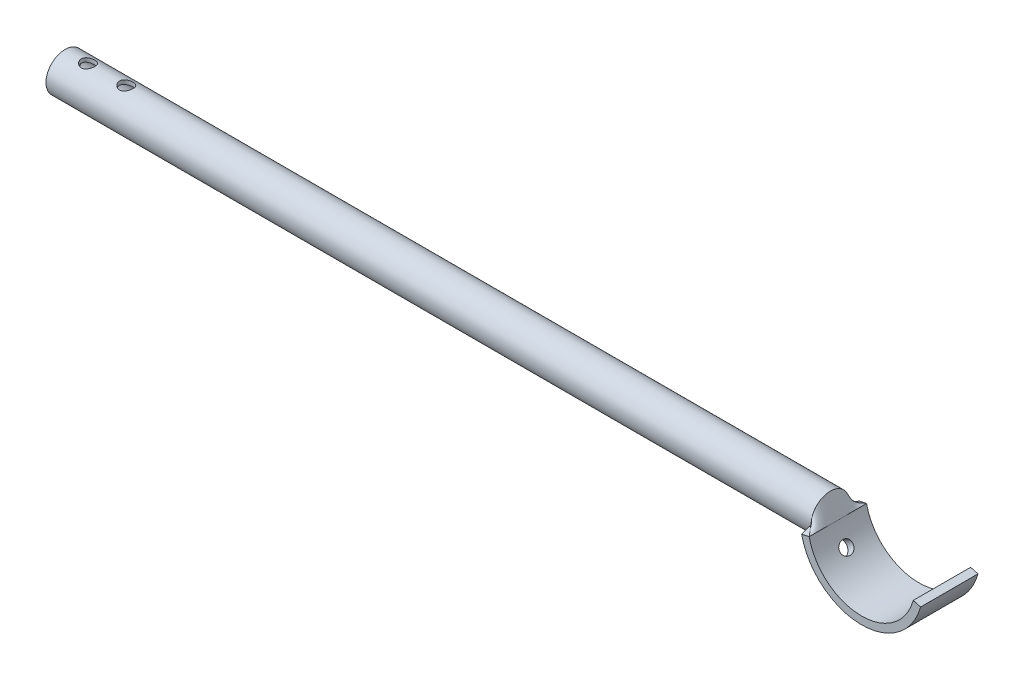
ISO-10303-21;
HEADER;
FILE_DESCRIPTION(('STEP AP214'),'2;1');
FILE_NAME('part.step','',(''),(''),'','','');
FILE_SCHEMA(('AUTOMOTIVE_DESIGN { 1 0 10303 214 1 1 1 1 }'));
ENDSEC;
DATA;
#1=APPLICATION_CONTEXT('core data for automotive mechanical design processes');
#2=APPLICATION_PROTOCOL_DEFINITION('international standard','automotive_design',2000,#1);
#3=PRODUCT_CONTEXT('',#1,'mechanical');
#4=PRODUCT('Part','Part','',(#3));
#5=PRODUCT_RELATED_PRODUCT_CATEGORY('part','',(#4));
#6=PRODUCT_DEFINITION_FORMATION('','',#4);
#7=PRODUCT_DEFINITION_CONTEXT('part definition',#1,'design');
#8=PRODUCT_DEFINITION('design','',#6,#7);
#9=PRODUCT_DEFINITION_SHAPE('','',#8);
#10=(LENGTH_UNIT() NAMED_UNIT(*) SI_UNIT(.MILLI.,.METRE.));
#11=(NAMED_UNIT(*) PLANE_ANGLE_UNIT() SI_UNIT($,.RADIAN.));
#12=(NAMED_UNIT(*) SI_UNIT($,.STERADIAN.) SOLID_ANGLE_UNIT());
#13=UNCERTAINTY_MEASURE_WITH_UNIT(LENGTH_MEASURE(1.E-05),#10,'distance_accuracy_value','');
#14=(GEOMETRIC_REPRESENTATION_CONTEXT(3) GLOBAL_UNCERTAINTY_ASSIGNED_CONTEXT((#13)) GLOBAL_UNIT_ASSIGNED_CONTEXT((#10,
#11,#12)) REPRESENTATION_CONTEXT('',''));
#15=CARTESIAN_POINT('',(0.,0.,0.));
#16=DIRECTION('',(0.,0.,1.));
#17=DIRECTION('',(1.,0.,0.));
#18=AXIS2_PLACEMENT_3D('',#15,#16,#17);
#19=CARTESIAN_POINT('',(201.986233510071,-0.547205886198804,-7.5));
#20=CARTESIAN_POINT('',(200.,0.138554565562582,-4.99807989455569));
#21=CARTESIAN_POINT('',(201.660184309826,-0.616509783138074,-7.5));
#22=CARTESIAN_POINT('',(200.,0.0923874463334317,-4.9993597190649));
#23=CARTESIAN_POINT('',(201.334135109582,-0.685813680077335,-7.5));
#24=CARTESIAN_POINT('',(200.,0.0461937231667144,-4.99999963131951));
#25=CARTESIAN_POINT('',(200.682036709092,-0.824421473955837,-7.5));
#26=CARTESIAN_POINT('',(200.,-0.0461937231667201,-4.99999963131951));
#27=CARTESIAN_POINT('',(200.355987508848,-0.893725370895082,-7.5));
#28=CARTESIAN_POINT('',(200.,-0.0923874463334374,-4.9993597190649));
#29=CARTESIAN_POINT('',(200.029938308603,-0.963029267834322,-7.5));
#30=CARTESIAN_POINT('',(200.,-0.138554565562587,-4.99807989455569));
#31=B_SPLINE_SURFACE_WITH_KNOTS('',3,1,((#19,#20),(#21,#22),(#23,#24),(#25,#26),(#27,#28),(#29,
#30)),.UNSPECIFIED.,.F.,.F.,.F.,(4,2,4),(2,2),(0.,0.5,1.),(0.,1.),.UNSPECIFIED.);
#32=DIRECTION('',(-0.978147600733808,-0.207911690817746,0.));
#33=VECTOR('',#32,1.);
#34=CARTESIAN_POINT('',(201.008085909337,-0.755117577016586,-7.5));
#35=LINE('',#34,#33);
#36=CARTESIAN_POINT('',(201.986233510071,-0.547205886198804,-7.5));
#37=VERTEX_POINT('',#36);
#38=CARTESIAN_POINT('',(200.029938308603,-0.963029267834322,-7.5));
#39=VERTEX_POINT('',#38);
#40=EDGE_CURVE('E13',#37,#39,#35,.T.);
#41=DIRECTION('',(-0.0113642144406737,0.312960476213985,0.949698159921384));
#42=VECTOR('',#41,1.);
#43=CARTESIAN_POINT('',(200.014969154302,-0.550791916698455,-6.24903994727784));
#44=LINE('',#43,#42);
#45=CARTESIAN_POINT('',(200.,-0.138554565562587,-4.99807989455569));
#46=VERTEX_POINT('',#45);
#47=EDGE_CURVE('E76',#39,#46,#44,.T.);
#48=CARTESIAN_POINT('',(200.,0.138554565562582,-4.99807989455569));
#49=CARTESIAN_POINT('',(200.,0.0923874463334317,-4.9993597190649));
#50=CARTESIAN_POINT('',(200.,0.0461937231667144,-4.99999963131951));
#51=CARTESIAN_POINT('',(200.,-0.0461937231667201,-4.99999963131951));
#52=CARTESIAN_POINT('',(200.,-0.0923874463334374,-4.9993597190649));
#53=CARTESIAN_POINT('',(200.,-0.138554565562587,-4.99807989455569));
#54=B_SPLINE_CURVE_WITH_KNOTS('',3,(#48,#49,#50,#51,#52,#53),.UNSPECIFIED.,.F.,.F.,(4,2,4),(0.,
0.5,1.),.UNSPECIFIED.);
#55=CARTESIAN_POINT('',(200.,0.138554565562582,-4.99807989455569));
#56=VERTEX_POINT('',#55);
#57=EDGE_CURVE('E85',#46,#56,#54,.F.);
#58=DIRECTION('',(0.607920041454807,-0.209888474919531,-0.76575456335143));
#59=VECTOR('',#58,1.);
#60=CARTESIAN_POINT('',(200.993116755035,-0.204325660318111,-6.24903994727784));
#61=LINE('',#60,#59);
#62=EDGE_CURVE('E116',#56,#37,#61,.T.);
#63=ORIENTED_EDGE('',*,*,#40,.T.);
#64=ORIENTED_EDGE('',*,*,#47,.T.);
#65=ORIENTED_EDGE('',*,*,#57,.T.);
#66=ORIENTED_EDGE('',*,*,#62,.T.);
#67=EDGE_LOOP('',(#63,#64,#65,#66));
#68=FACE_BOUND('',#67,.T.);
#69=ADVANCED_FACE('F65',(#68),#31,.T.);
#70=CARTESIAN_POINT('',(200.029938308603,-0.963029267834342,-7.5));
#71=CARTESIAN_POINT('',(200.,-0.138554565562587,-4.99807989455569));
#72=CARTESIAN_POINT('',(200.029938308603,-0.963029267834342,-6.875));
#73=CARTESIAN_POINT('',(200.,-0.55490127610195,-4.9865381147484));
#74=CARTESIAN_POINT('',(200.029938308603,-0.963029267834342,-6.25));
#75=CARTESIAN_POINT('',(200.,-1.02294962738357,-4.92274722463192));
#76=CARTESIAN_POINT('',(200.029938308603,-0.963029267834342,-5.));
#77=CARTESIAN_POINT('',(200.,-2.03046786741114,-4.59968112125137));
#78=CARTESIAN_POINT('',(200.029938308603,-0.963029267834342,-4.375));
#79=CARTESIAN_POINT('',(200.,-2.57158988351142,-4.33781294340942));
#80=CARTESIAN_POINT('',(200.029938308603,-0.963029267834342,-3.4375));
#81=CARTESIAN_POINT('',(200.,-3.34504207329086,-3.73069932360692));
#82=CARTESIAN_POINT('',(200.029938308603,-0.963029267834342,-3.125));
#83=CARTESIAN_POINT('',(200.,-3.59550829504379,-3.49288724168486));
#84=CARTESIAN_POINT('',(200.029938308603,-0.963029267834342,-2.49999999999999));
#85=CARTESIAN_POINT('',(200.,-4.05609655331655,-2.94550877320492));
#86=CARTESIAN_POINT('',(200.029938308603,-0.963029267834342,-2.18749999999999));
#87=CARTESIAN_POINT('',(200.,-4.26601036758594,-2.63582561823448));
#88=CARTESIAN_POINT('',(200.029938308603,-0.963029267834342,-1.56249999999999));
#89=CARTESIAN_POINT('',(200.,-4.61742111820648,-1.95597631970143));
#90=CARTESIAN_POINT('',(200.029938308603,-0.963029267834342,-1.24999999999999));
#91=CARTESIAN_POINT('',(200.,-4.75863052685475,-1.58585429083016));
#92=CARTESIAN_POINT('',(200.029938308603,-0.963029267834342,-0.624999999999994));
#93=CARTESIAN_POINT('',(200.,-4.95002851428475,-0.810380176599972));
#94=CARTESIAN_POINT('',(200.029938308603,-0.963029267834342,-0.312499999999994));
#95=CARTESIAN_POINT('',(200.,-5.,-0.405276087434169));
#96=CARTESIAN_POINT('',(200.029938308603,-0.963029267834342,0.312500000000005));
#97=CARTESIAN_POINT('',(200.,-5.,0.405276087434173));
#98=CARTESIAN_POINT('',(200.029938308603,-0.963029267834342,0.625000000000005));
#99=CARTESIAN_POINT('',(200.,-4.95002851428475,0.810380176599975));
#100=CARTESIAN_POINT('',(200.029938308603,-0.963029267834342,1.25000000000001));
#101=CARTESIAN_POINT('',(200.,-4.75863052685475,1.58585429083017));
#102=CARTESIAN_POINT('',(200.029938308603,-0.963029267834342,1.5625));
#103=CARTESIAN_POINT('',(200.,-4.61742111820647,1.95597631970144));
#104=CARTESIAN_POINT('',(200.029938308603,-0.963029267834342,2.1875));
#105=CARTESIAN_POINT('',(200.,-4.26601036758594,2.63582561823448));
#106=CARTESIAN_POINT('',(200.029938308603,-0.963029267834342,2.5));
#107=CARTESIAN_POINT('',(200.,-4.05609655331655,2.94550877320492));
#108=CARTESIAN_POINT('',(200.029938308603,-0.963029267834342,3.125));
#109=CARTESIAN_POINT('',(200.,-3.59550829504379,3.49288724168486));
#110=CARTESIAN_POINT('',(200.029938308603,-0.963029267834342,3.4375));
#111=CARTESIAN_POINT('',(200.,-3.34504207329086,3.73069932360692));
#112=CARTESIAN_POINT('',(200.029938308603,-0.963029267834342,4.375));
#113=CARTESIAN_POINT('',(200.,-2.57158988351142,4.33781294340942));
#114=CARTESIAN_POINT('',(200.029938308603,-0.963029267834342,5.));
#115=CARTESIAN_POINT('',(200.,-2.03046786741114,4.59968112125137));
#116=CARTESIAN_POINT('',(200.029938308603,-0.963029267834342,6.25));
#117=CARTESIAN_POINT('',(200.,-1.02294962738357,4.92274722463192));
#118=CARTESIAN_POINT('',(200.029938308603,-0.963029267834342,6.875));
#119=CARTESIAN_POINT('',(200.,-0.554901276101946,4.9865381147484));
#120=CARTESIAN_POINT('',(200.029938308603,-0.963029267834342,7.5));
#121=CARTESIAN_POINT('',(200.,-0.138554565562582,4.99807989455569));
#122=B_SPLINE_SURFACE_WITH_KNOTS('',3,1,((#70,#71),(#72,#73),(#74,#75),(#76,#77),(#78,#79),(#80,
#81),(#82,#83),(#84,#85),(#86,#87),(#88,#89),(#90,#91),(#92,#93),(#94,#95),(#96,#97),(#98,#99),
(#100,#101),(#102,#103),(#104,#105),(#106,#107),(#108,#109),(#110,#111),(#112,#113),(#114,#115),
(#116,#117),(#118,#119),(#120,#121)),.UNSPECIFIED.,.F.,.F.,.F.,(4,2,2,2,2,2,2,2,2,2,2,2,4),(2,
2),(0.,0.125,0.25,0.3125,0.375,0.4375,0.5,0.5625,0.625,0.6875,0.75,0.875,1.),(0.,1.),.UNSPECIFIED.);
#123=DIRECTION('',(0.,0.,1.));
#124=VECTOR('',#123,1.);
#125=CARTESIAN_POINT('',(200.029938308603,-0.963029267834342,0.));
#126=LINE('',#125,#124);
#127=CARTESIAN_POINT('',(200.029938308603,-0.963029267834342,7.5));
#128=VERTEX_POINT('',#127);
#129=EDGE_CURVE('E144',#39,#128,#126,.T.);
#130=DIRECTION('',(-0.0113642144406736,0.312960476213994,-0.949698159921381));
#131=VECTOR('',#130,1.);
#132=CARTESIAN_POINT('',(200.014969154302,-0.550791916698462,6.24903994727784));
#133=LINE('',#132,#131);
#134=CARTESIAN_POINT('',(200.,-0.138554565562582,4.99807989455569));
#135=VERTEX_POINT('',#134);
#136=EDGE_CURVE('E139',#128,#135,#133,.T.);
#137=CARTESIAN_POINT('',(200.,-0.138554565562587,-4.99807989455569));
#138=CARTESIAN_POINT('',(200.,-0.55490127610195,-4.9865381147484));
#139=CARTESIAN_POINT('',(200.,-1.02294962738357,-4.92274722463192));
#140=CARTESIAN_POINT('',(200.,-2.03046786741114,-4.59968112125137));
#141=CARTESIAN_POINT('',(200.,-2.57158988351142,-4.33781294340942));
#142=CARTESIAN_POINT('',(200.,-3.34504207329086,-3.73069932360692));
#143=CARTESIAN_POINT('',(200.,-3.59550829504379,-3.49288724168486));
#144=CARTESIAN_POINT('',(200.,-4.05609655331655,-2.94550877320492));
#145=CARTESIAN_POINT('',(200.,-4.26601036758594,-2.63582561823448));
#146=CARTESIAN_POINT('',(200.,-4.61742111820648,-1.95597631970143));
#147=CARTESIAN_POINT('',(200.,-4.75863052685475,-1.58585429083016));
#148=CARTESIAN_POINT('',(200.,-4.95002851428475,-0.810380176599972));
#149=CARTESIAN_POINT('',(200.,-5.,-0.405276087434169));
#150=CARTESIAN_POINT('',(200.,-5.,0.405276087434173));
#151=CARTESIAN_POINT('',(200.,-4.95002851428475,0.810380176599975));
#152=CARTESIAN_POINT('',(200.,-4.75863052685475,1.58585429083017));
#153=CARTESIAN_POINT('',(200.,-4.61742111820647,1.95597631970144));
#154=CARTESIAN_POINT('',(200.,-4.26601036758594,2.63582561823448));
#155=CARTESIAN_POINT('',(200.,-4.05609655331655,2.94550877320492));
#156=CARTESIAN_POINT('',(200.,-3.59550829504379,3.49288724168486));
#157=CARTESIAN_POINT('',(200.,-3.34504207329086,3.73069932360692));
#158=CARTESIAN_POINT('',(200.,-2.57158988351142,4.33781294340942));
#159=CARTESIAN_POINT('',(200.,-2.03046786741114,4.59968112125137));
#160=CARTESIAN_POINT('',(200.,-1.02294962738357,4.92274722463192));
#161=CARTESIAN_POINT('',(200.,-0.554901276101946,4.9865381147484));
#162=CARTESIAN_POINT('',(200.,-0.138554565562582,4.99807989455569));
#163=B_SPLINE_CURVE_WITH_KNOTS('',3,(#137,#138,#139,#140,#141,#142,#143,#144,#145,#146,#147,
#148,#149,#150,#151,#152,#153,#154,#155,#156,#157,#158,#159,#160,#161,#162),.UNSPECIFIED.,.F.,
.F.,(4,2,2,2,2,2,2,2,2,2,2,2,4),(0.,0.125,0.25,0.3125,0.375,0.4375,0.5,0.5625,0.625,0.6875,0.75,
0.875,1.),.UNSPECIFIED.);
#164=EDGE_CURVE('E135',#135,#46,#163,.F.);
#165=ORIENTED_EDGE('',*,*,#129,.T.);
#166=ORIENTED_EDGE('',*,*,#136,.T.);
#167=ORIENTED_EDGE('',*,*,#164,.T.);
#168=ORIENTED_EDGE('',*,*,#47,.F.);
#169=EDGE_LOOP('',(#165,#166,#167,#168));
#170=FACE_BOUND('',#169,.T.);
#171=ADVANCED_FACE('F177',(#170),#122,.T.);
#172=CARTESIAN_POINT('',(201.986233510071,-0.547205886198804,7.5));
#173=CARTESIAN_POINT('',(200.,0.13855456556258,4.99807989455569));
#174=CARTESIAN_POINT('',(201.986233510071,-0.547205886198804,6.875));
#175=CARTESIAN_POINT('',(200.,0.554901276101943,4.9865381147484));
#176=CARTESIAN_POINT('',(201.986233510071,-0.547205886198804,6.25));
#177=CARTESIAN_POINT('',(200.,1.02294962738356,4.92274722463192));
#178=CARTESIAN_POINT('',(201.986233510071,-0.547205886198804,5.));
#179=CARTESIAN_POINT('',(200.,2.03046786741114,4.59968112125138));
#180=CARTESIAN_POINT('',(201.986233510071,-0.547205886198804,4.375));
#181=CARTESIAN_POINT('',(200.,2.57158988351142,4.33781294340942));
#182=CARTESIAN_POINT('',(201.986233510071,-0.547205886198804,3.4375));
#183=CARTESIAN_POINT('',(200.,3.34504207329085,3.73069932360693));
#184=CARTESIAN_POINT('',(201.986233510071,-0.547205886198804,3.125));
#185=CARTESIAN_POINT('',(200.,3.59550829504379,3.49288724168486));
#186=CARTESIAN_POINT('',(201.986233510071,-0.547205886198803,2.5));
#187=CARTESIAN_POINT('',(200.,4.05609655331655,2.94550877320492));
#188=CARTESIAN_POINT('',(201.986233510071,-0.547205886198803,2.1875));
#189=CARTESIAN_POINT('',(200.,4.26601036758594,2.63582561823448));
#190=CARTESIAN_POINT('',(201.986233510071,-0.547205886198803,1.5625));
#191=CARTESIAN_POINT('',(200.,4.61742111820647,1.95597631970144));
#192=CARTESIAN_POINT('',(201.986233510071,-0.547205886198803,1.25));
#193=CARTESIAN_POINT('',(200.,4.75863052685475,1.58585429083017));
#194=CARTESIAN_POINT('',(201.986233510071,-0.547205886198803,0.625));
#195=CARTESIAN_POINT('',(200.,4.95002851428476,0.810380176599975));
#196=CARTESIAN_POINT('',(201.986233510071,-0.547205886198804,0.3125));
#197=CARTESIAN_POINT('',(200.,5.,0.405276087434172));
#198=CARTESIAN_POINT('',(201.986233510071,-0.547205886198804,-0.3125));
#199=CARTESIAN_POINT('',(200.,5.,-0.405276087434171));
#200=CARTESIAN_POINT('',(201.986233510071,-0.547205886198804,-0.624999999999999));
#201=CARTESIAN_POINT('',(200.,4.95002851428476,-0.810380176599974));
#202=CARTESIAN_POINT('',(201.986233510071,-0.547205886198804,-1.25));
#203=CARTESIAN_POINT('',(200.,4.75863052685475,-1.58585429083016));
#204=CARTESIAN_POINT('',(201.986233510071,-0.547205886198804,-1.5625));
#205=CARTESIAN_POINT('',(200.,4.61742111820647,-1.95597631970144));
#206=CARTESIAN_POINT('',(201.986233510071,-0.547205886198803,-2.1875));
#207=CARTESIAN_POINT('',(200.,4.26601036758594,-2.63582561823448));
#208=CARTESIAN_POINT('',(201.986233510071,-0.547205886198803,-2.5));
#209=CARTESIAN_POINT('',(200.,4.05609655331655,-2.94550877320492));
#210=CARTESIAN_POINT('',(201.986233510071,-0.547205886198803,-3.125));
#211=CARTESIAN_POINT('',(200.,3.59550829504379,-3.49288724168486));
#212=CARTESIAN_POINT('',(201.986233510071,-0.547205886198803,-3.4375));
#213=CARTESIAN_POINT('',(200.,3.34504207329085,-3.73069932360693));
#214=CARTESIAN_POINT('',(201.986233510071,-0.547205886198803,-4.375));
#215=CARTESIAN_POINT('',(200.,2.57158988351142,-4.33781294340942));
#216=CARTESIAN_POINT('',(201.986233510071,-0.547205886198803,-5.));
#217=CARTESIAN_POINT('',(200.,2.03046786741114,-4.59968112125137));
#218=CARTESIAN_POINT('',(201.986233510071,-0.547205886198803,-6.25));
#219=CARTESIAN_POINT('',(200.,1.02294962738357,-4.92274722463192));
#220=CARTESIAN_POINT('',(201.986233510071,-0.547205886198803,-6.875));
#221=CARTESIAN_POINT('',(200.,0.554901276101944,-4.9865381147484));
#222=CARTESIAN_POINT('',(201.986233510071,-0.547205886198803,-7.5));
#223=CARTESIAN_POINT('',(200.,0.138554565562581,-4.99807989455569));
#224=B_SPLINE_SURFACE_WITH_KNOTS('',3,1,((#172,#173),(#174,#175),(#176,#177),(#178,#179),(#180,
#181),(#182,#183),(#184,#185),(#186,#187),(#188,#189),(#190,#191),(#192,#193),(#194,#195),(#196,
#197),(#198,#199),(#200,#201),(#202,#203),(#204,#205),(#206,#207),(#208,#209),(#210,#211),(#212,
#213),(#214,#215),(#216,#217),(#218,#219),(#220,#221),(#222,#223)),.UNSPECIFIED.,.F.,.F.,.F.,(4,
2,2,2,2,2,2,2,2,2,2,2,4),(2,2),(0.,0.125,0.25,0.3125,0.375,0.4375,0.5,0.5625,0.625,0.6875,0.75,
0.875,1.),(0.,1.),.UNSPECIFIED.);
#225=DIRECTION('',(0.,0.,-1.));
#226=VECTOR('',#225,1.);
#227=CARTESIAN_POINT('',(201.986233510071,-0.547205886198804,0.));
#228=LINE('',#227,#226);
#229=CARTESIAN_POINT('',(201.986233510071,-0.547205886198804,7.5));
#230=VERTEX_POINT('',#229);
#231=EDGE_CURVE('E118',#230,#37,#228,.T.);
#232=CARTESIAN_POINT('',(200.,0.13855456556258,4.99807989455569));
#233=CARTESIAN_POINT('',(200.,0.554901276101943,4.9865381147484));
#234=CARTESIAN_POINT('',(200.,1.02294962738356,4.92274722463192));
#235=CARTESIAN_POINT('',(200.,2.03046786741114,4.59968112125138));
#236=CARTESIAN_POINT('',(200.,2.57158988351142,4.33781294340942));
#237=CARTESIAN_POINT('',(200.,3.34504207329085,3.73069932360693));
#238=CARTESIAN_POINT('',(200.,3.59550829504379,3.49288724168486));
#239=CARTESIAN_POINT('',(200.,4.05609655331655,2.94550877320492));
#240=CARTESIAN_POINT('',(200.,4.26601036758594,2.63582561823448));
#241=CARTESIAN_POINT('',(200.,4.61742111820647,1.95597631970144));
#242=CARTESIAN_POINT('',(200.,4.75863052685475,1.58585429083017));
#243=CARTESIAN_POINT('',(200.,4.95002851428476,0.810380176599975));
#244=CARTESIAN_POINT('',(200.,5.,0.405276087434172));
#245=CARTESIAN_POINT('',(200.,5.,-0.405276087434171));
#246=CARTESIAN_POINT('',(200.,4.95002851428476,-0.810380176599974));
#247=CARTESIAN_POINT('',(200.,4.75863052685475,-1.58585429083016));
#248=CARTESIAN_POINT('',(200.,4.61742111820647,-1.95597631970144));
#249=CARTESIAN_POINT('',(200.,4.26601036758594,-2.63582561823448));
#250=CARTESIAN_POINT('',(200.,4.05609655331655,-2.94550877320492));
#251=CARTESIAN_POINT('',(200.,3.59550829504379,-3.49288724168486));
#252=CARTESIAN_POINT('',(200.,3.34504207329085,-3.73069932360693));
#253=CARTESIAN_POINT('',(200.,2.57158988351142,-4.33781294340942));
#254=CARTESIAN_POINT('',(200.,2.03046786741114,-4.59968112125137));
#255=CARTESIAN_POINT('',(200.,1.02294962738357,-4.92274722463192));
#256=CARTESIAN_POINT('',(200.,0.554901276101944,-4.9865381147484));
#257=CARTESIAN_POINT('',(200.,0.138554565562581,-4.99807989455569));
#258=B_SPLINE_CURVE_WITH_KNOTS('',3,(#232,#233,#234,#235,#236,#237,#238,#239,#240,#241,#242,
#243,#244,#245,#246,#247,#248,#249,#250,#251,#252,#253,#254,#255,#256,#257),.UNSPECIFIED.,.F.,
.F.,(4,2,2,2,2,2,2,2,2,2,2,2,4),(0.,0.125,0.25,0.3125,0.375,0.4375,0.5,0.5625,0.625,0.6875,0.75,
0.875,1.),.UNSPECIFIED.);
#259=CARTESIAN_POINT('',(200.,0.13855456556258,4.99807989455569));
#260=VERTEX_POINT('',#259);
#261=EDGE_CURVE('E112',#56,#260,#258,.F.);
#262=DIRECTION('',(-0.607920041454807,0.20988847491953,-0.76575456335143));
#263=VECTOR('',#262,1.);
#264=CARTESIAN_POINT('',(200.993116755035,-0.204325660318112,6.24903994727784));
#265=LINE('',#264,#263);
#266=EDGE_CURVE('E70',#230,#260,#265,.T.);
#267=ORIENTED_EDGE('',*,*,#231,.T.);
#268=ORIENTED_EDGE('',*,*,#62,.F.);
#269=ORIENTED_EDGE('',*,*,#261,.T.);
#270=ORIENTED_EDGE('',*,*,#266,.F.);
#271=EDGE_LOOP('',(#267,#268,#269,#270));
#272=FACE_BOUND('',#271,.T.);
#273=ADVANCED_FACE('F115',(#272),#224,.T.);
#274=CARTESIAN_POINT('',(200.029938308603,-0.963029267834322,7.5));
#275=CARTESIAN_POINT('',(200.,-0.138554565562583,4.99807989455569));
#276=CARTESIAN_POINT('',(200.355987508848,-0.893725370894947,7.5));
#277=CARTESIAN_POINT('',(200.,-0.0923874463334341,4.9993597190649));
#278=CARTESIAN_POINT('',(200.682036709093,-0.824421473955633,7.5));
#279=CARTESIAN_POINT('',(200.,-0.0461937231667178,4.99999963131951));
#280=CARTESIAN_POINT('',(201.334135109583,-0.685813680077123,7.5));
#281=CARTESIAN_POINT('',(200.,0.0461937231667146,4.99999963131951));
#282=CARTESIAN_POINT('',(201.660184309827,-0.616509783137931,7.5));
#283=CARTESIAN_POINT('',(200.,0.0923874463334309,4.9993597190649));
#284=CARTESIAN_POINT('',(201.986233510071,-0.547205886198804,7.5));
#285=CARTESIAN_POINT('',(200.,0.13855456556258,4.99807989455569));
#286=B_SPLINE_SURFACE_WITH_KNOTS('',3,1,((#274,#275),(#276,#277),(#278,#279),(#280,#281),(#282,
#283),(#284,#285)),.UNSPECIFIED.,.F.,.F.,.F.,(4,2,4),(2,2),(0.,0.5,1.),(0.,1.),.UNSPECIFIED.);
#287=DIRECTION('',(0.978147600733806,0.207911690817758,0.));
#288=VECTOR('',#287,1.);
#289=CARTESIAN_POINT('',(201.008085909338,-0.755117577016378,7.5));
#290=LINE('',#289,#288);
#291=EDGE_CURVE('E106',#128,#230,#290,.T.);
#292=CARTESIAN_POINT('',(200.,-0.138554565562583,4.99807989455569));
#293=CARTESIAN_POINT('',(200.,-0.0923874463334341,4.9993597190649));
#294=CARTESIAN_POINT('',(200.,-0.0461937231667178,4.99999963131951));
#295=CARTESIAN_POINT('',(200.,0.0461937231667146,4.99999963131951));
#296=CARTESIAN_POINT('',(200.,0.0923874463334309,4.9993597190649));
#297=CARTESIAN_POINT('',(200.,0.13855456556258,4.99807989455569));
#298=B_SPLINE_CURVE_WITH_KNOTS('',3,(#292,#293,#294,#295,#296,#297),.UNSPECIFIED.,.F.,.F.,(4,2,
4),(0.,0.5,1.),.UNSPECIFIED.);
#299=EDGE_CURVE('E121',#260,#135,#298,.F.);
#300=ORIENTED_EDGE('',*,*,#291,.T.);
#301=ORIENTED_EDGE('',*,*,#266,.T.);
#302=ORIENTED_EDGE('',*,*,#299,.T.);
#303=ORIENTED_EDGE('',*,*,#136,.F.);
#304=EDGE_LOOP('',(#300,#301,#302,#303));
#305=FACE_BOUND('',#304,.T.);
#306=ADVANCED_FACE('F66',(#305),#286,.T.);
#307=OPEN_SHELL('',(#69,#171,#273,#306));
#308=SHELL_BASED_SURFACE_MODEL('B2',(#307));
#309=CARTESIAN_POINT('',(220.426811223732,-40.4580230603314,-7.5));
#310=DIRECTION('',(0.963630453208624,-0.267238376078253,0.));
#311=DIRECTION('',(0.,0.,-1.));
#312=AXIS2_PLACEMENT_3D('',#309,#310,#311);
#313=PLANE('',#312);
#314=DIRECTION('',(0.267238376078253,0.963630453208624,0.));
#315=VECTOR('',#314,1.);
#316=CARTESIAN_POINT('',(220.426811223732,-40.4580230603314,7.5));
#317=LINE('',#316,#315);
#318=CARTESIAN_POINT('',(231.106245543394,-1.94922696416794,7.5));
#319=VERTEX_POINT('',#318);
#320=CARTESIAN_POINT('',(231.116346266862,-1.91280493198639,7.5));
#321=VERTEX_POINT('',#320);
#322=EDGE_CURVE('E262',#319,#321,#317,.T.);
#323=ORIENTED_EDGE('',*,*,#322,.F.);
#324=DIRECTION('',(0.,0.,-1.));
#325=VECTOR('',#324,1.);
#326=CARTESIAN_POINT('',(231.106245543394,-1.94922696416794,-7.5));
#327=LINE('',#326,#325);
#328=CARTESIAN_POINT('',(231.106245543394,-1.94922696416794,-7.5));
#329=VERTEX_POINT('',#328);
#330=EDGE_CURVE('E254',#319,#329,#327,.T.);
#331=ORIENTED_EDGE('',*,*,#330,.T.);
#332=DIRECTION('',(-0.267238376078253,-0.963630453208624,0.));
#333=VECTOR('',#332,1.);
#334=CARTESIAN_POINT('',(220.426811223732,-40.4580230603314,-7.5));
#335=LINE('',#334,#333);
#336=CARTESIAN_POINT('',(231.116346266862,-1.91280493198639,-7.5));
#337=VERTEX_POINT('',#336);
#338=EDGE_CURVE('E270',#337,#329,#335,.T.);
#339=ORIENTED_EDGE('',*,*,#338,.F.);
#340=DIRECTION('',(0.,0.,-1.));
#341=VECTOR('',#340,1.);
#342=CARTESIAN_POINT('',(231.116346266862,-1.91280493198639,7.5));
#343=LINE('',#342,#341);
#344=EDGE_CURVE('E373',#321,#337,#343,.T.);
#345=ORIENTED_EDGE('',*,*,#344,.F.);
#346=EDGE_LOOP('',(#323,#331,#339,#345));
#347=FACE_BOUND('',#346,.T.);
#348=ADVANCED_FACE('F245',(#347),#313,.T.);
#349=CARTESIAN_POINT('',(218.499550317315,-39.9235463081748,-7.5));
#350=DIRECTION('',(0.963630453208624,-0.267238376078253,0.));
#351=DIRECTION('',(0.,0.,-1.));
#352=AXIS2_PLACEMENT_3D('',#349,#350,#351);
#353=PLANE('',#352);
#354=DIRECTION('',(0.,0.,-1.));
#355=VECTOR('',#354,1.);
#356=CARTESIAN_POINT('',(229.178984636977,-1.41475021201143,-7.5));
#357=LINE('',#356,#355);
#358=CARTESIAN_POINT('',(229.178984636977,-1.41475021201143,7.5));
#359=VERTEX_POINT('',#358);
#360=CARTESIAN_POINT('',(229.178984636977,-1.41475021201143,-7.5));
#361=VERTEX_POINT('',#360);
#362=EDGE_CURVE('E380',#359,#361,#357,.T.);
#363=ORIENTED_EDGE('',*,*,#362,.F.);
#364=DIRECTION('',(0.267238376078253,0.963630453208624,0.));
#365=VECTOR('',#364,1.);
#366=CARTESIAN_POINT('',(218.499550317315,-39.9235463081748,7.5));
#367=LINE('',#366,#365);
#368=CARTESIAN_POINT('',(229.189085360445,-1.37832817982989,7.5));
#369=VERTEX_POINT('',#368);
#370=EDGE_CURVE('E249',#359,#369,#367,.T.);
#371=ORIENTED_EDGE('',*,*,#370,.T.);
#372=DIRECTION('',(0.,0.,-1.));
#373=VECTOR('',#372,1.);
#374=CARTESIAN_POINT('',(229.189085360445,-1.37832817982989,7.5));
#375=LINE('',#374,#373);
#376=CARTESIAN_POINT('',(229.189085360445,-1.37832817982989,-7.5));
#377=VERTEX_POINT('',#376);
#378=EDGE_CURVE('E370',#369,#377,#375,.T.);
#379=ORIENTED_EDGE('',*,*,#378,.T.);
#380=DIRECTION('',(-0.267238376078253,-0.963630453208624,0.));
#381=VECTOR('',#380,1.);
#382=CARTESIAN_POINT('',(218.499550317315,-39.9235463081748,-7.5));
#383=LINE('',#382,#381);
#384=EDGE_CURVE('E372',#377,#361,#383,.T.);
#385=ORIENTED_EDGE('',*,*,#384,.T.);
#386=EDGE_LOOP('',(#363,#371,#379,#385));
#387=FACE_BOUND('',#386,.T.);
#388=ADVANCED_FACE('F390',(#387),#353,.F.);
#389=CARTESIAN_POINT('',(218.499550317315,-39.9235463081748,7.5));
#390=DIRECTION('',(0.,0.,-1.));
#391=DIRECTION('',(-0.267238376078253,-0.963630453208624,0.));
#392=AXIS2_PLACEMENT_3D('',#389,#390,#391);
#393=PLANE('',#392);
#394=DIRECTION('',(-0.963630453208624,0.267238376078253,0.));
#395=VECTOR('',#394,1.);
#396=CARTESIAN_POINT('',(229.178984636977,-1.41475021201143,7.5));
#397=LINE('',#396,#395);
#398=EDGE_CURVE('E63',#319,#359,#397,.T.);
#399=ORIENTED_EDGE('',*,*,#398,.F.);
#400=ORIENTED_EDGE('',*,*,#322,.T.);
#401=DIRECTION('',(0.963630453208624,-0.267238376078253,0.));
#402=VECTOR('',#401,1.);
#403=CARTESIAN_POINT('',(229.189085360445,-1.37832817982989,7.5));
#404=LINE('',#403,#402);
#405=EDGE_CURVE('E377',#369,#321,#404,.T.);
#406=ORIENTED_EDGE('',*,*,#405,.F.);
#407=ORIENTED_EDGE('',*,*,#370,.F.);
#408=EDGE_LOOP('',(#399,#400,#406,#407));
#409=FACE_BOUND('',#408,.T.);
#410=ADVANCED_FACE('F247',(#409),#393,.F.);
#411=CARTESIAN_POINT('',(229.189085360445,-1.37832817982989,7.5));
#412=DIRECTION('',(-0.267238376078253,-0.963630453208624,0.));
#413=DIRECTION('',(0.,0.,1.));
#414=AXIS2_PLACEMENT_3D('',#411,#412,#413);
#415=PLANE('',#414);
#416=ORIENTED_EDGE('',*,*,#344,.T.);
#417=DIRECTION('',(0.963630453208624,-0.267238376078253,0.));
#418=VECTOR('',#417,1.);
#419=CARTESIAN_POINT('',(229.189085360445,-1.37832817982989,-7.5));
#420=LINE('',#419,#418);
#421=EDGE_CURVE('E375',#377,#337,#420,.T.);
#422=ORIENTED_EDGE('',*,*,#421,.F.);
#423=ORIENTED_EDGE('',*,*,#378,.F.);
#424=ORIENTED_EDGE('',*,*,#405,.T.);
#425=EDGE_LOOP('',(#416,#422,#423,#424));
#426=FACE_BOUND('',#425,.T.);
#427=ADVANCED_FACE('F500',(#426),#415,.F.);
#428=CARTESIAN_POINT('',(218.499550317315,-39.9235463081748,-7.5));
#429=DIRECTION('',(0.,0.,1.));
#430=DIRECTION('',(0.267238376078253,0.963630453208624,0.));
#431=AXIS2_PLACEMENT_3D('',#428,#429,#430);
#432=PLANE('',#431);
#433=DIRECTION('',(0.963630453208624,-0.267238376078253,0.));
#434=VECTOR('',#433,1.);
#435=CARTESIAN_POINT('',(229.178984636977,-1.41475021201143,-7.5));
#436=LINE('',#435,#434);
#437=EDGE_CURVE('E382',#361,#329,#436,.T.);
#438=ORIENTED_EDGE('',*,*,#437,.F.);
#439=ORIENTED_EDGE('',*,*,#384,.F.);
#440=ORIENTED_EDGE('',*,*,#421,.T.);
#441=ORIENTED_EDGE('',*,*,#338,.T.);
#442=EDGE_LOOP('',(#438,#439,#440,#441));
#443=FACE_BOUND('',#442,.T.);
#444=ADVANCED_FACE('F486',(#443),#432,.F.);
#445=CARTESIAN_POINT('',(201.986233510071,-0.547205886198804,7.5));
#446=DIRECTION('',(0.207911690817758,-0.978147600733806,0.));
#447=DIRECTION('',(0.,0.,-1.));
#448=AXIS2_PLACEMENT_3D('',#445,#446,#447);
#449=PLANE('',#448);
#450=DIRECTION('',(0.,0.,1.));
#451=VECTOR('',#450,1.);
#452=CARTESIAN_POINT('',(200.029938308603,-0.963029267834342,7.5));
#453=LINE('',#452,#451);
#454=CARTESIAN_POINT('',(200.029938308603,-0.963029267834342,-7.5));
#455=VERTEX_POINT('',#454);
#456=CARTESIAN_POINT('',(200.029938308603,-0.963029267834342,7.5));
#457=VERTEX_POINT('',#456);
#458=EDGE_CURVE('E364',#455,#457,#453,.T.);
#459=ORIENTED_EDGE('',*,*,#458,.T.);
#460=DIRECTION('',(-0.978147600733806,-0.207911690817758,0.));
#461=VECTOR('',#460,1.);
#462=CARTESIAN_POINT('',(201.986233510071,-0.547205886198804,7.5));
#463=LINE('',#462,#461);
#464=CARTESIAN_POINT('',(201.986233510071,-0.547205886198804,7.5));
#465=VERTEX_POINT('',#464);
#466=EDGE_CURVE('E349',#465,#457,#463,.T.);
#467=ORIENTED_EDGE('',*,*,#466,.F.);
#468=DIRECTION('',(0.,0.,1.));
#469=VECTOR('',#468,1.);
#470=CARTESIAN_POINT('',(201.986233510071,-0.547205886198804,7.5));
#471=LINE('',#470,#469);
#472=CARTESIAN_POINT('',(201.986233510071,-0.547205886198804,-7.5));
#473=VERTEX_POINT('',#472);
#474=EDGE_CURVE('E339',#473,#465,#471,.T.);
#475=ORIENTED_EDGE('',*,*,#474,.F.);
#476=DIRECTION('',(-0.978147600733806,-0.207911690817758,0.));
#477=VECTOR('',#476,1.);
#478=CARTESIAN_POINT('',(201.986233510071,-0.547205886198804,-7.5));
#479=LINE('',#478,#477);
#480=EDGE_CURVE('E343',#473,#455,#479,.T.);
#481=ORIENTED_EDGE('',*,*,#480,.T.);
#482=EDGE_LOOP('',(#459,#467,#475,#481));
#483=FACE_BOUND('',#482,.T.);
#484=ADVANCED_FACE('F470',(#483),#449,.F.);
#485=CARTESIAN_POINT('',(201.986233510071,-0.547205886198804,-7.5));
#486=DIRECTION('',(-0.978147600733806,-0.207911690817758,0.));
#487=DIRECTION('',(0.,0.,-1.));
#488=AXIS2_PLACEMENT_3D('',#485,#486,#487);
#489=PLANE('',#488);
#490=DIRECTION('',(0.207911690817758,-0.978147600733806,0.));
#491=VECTOR('',#490,1.);
#492=CARTESIAN_POINT('',(201.986233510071,-0.547205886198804,7.5));
#493=LINE('',#492,#491);
#494=CARTESIAN_POINT('',(201.994091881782,-0.584176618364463,7.5));
#495=VERTEX_POINT('',#494);
#496=EDGE_CURVE('E334',#465,#495,#493,.T.);
#497=ORIENTED_EDGE('',*,*,#496,.T.);
#498=DIRECTION('',(0.,0.,-1.));
#499=VECTOR('',#498,1.);
#500=CARTESIAN_POINT('',(201.994091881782,-0.584176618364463,-7.5));
#501=LINE('',#500,#499);
#502=CARTESIAN_POINT('',(201.994091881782,-0.584176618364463,-7.5));
#503=VERTEX_POINT('',#502);
#504=EDGE_CURVE('E326',#495,#503,#501,.T.);
#505=ORIENTED_EDGE('',*,*,#504,.T.);
#506=DIRECTION('',(-0.207911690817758,0.978147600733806,0.));
#507=VECTOR('',#506,1.);
#508=CARTESIAN_POINT('',(201.986233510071,-0.547205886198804,-7.5));
#509=LINE('',#508,#507);
#510=EDGE_CURVE('E333',#503,#473,#509,.T.);
#511=ORIENTED_EDGE('',*,*,#510,.T.);
#512=ORIENTED_EDGE('',*,*,#474,.T.);
#513=EDGE_LOOP('',(#497,#505,#511,#512));
#514=FACE_BOUND('',#513,.T.);
#515=ADVANCED_FACE('F337',(#514),#489,.F.);
#516=CARTESIAN_POINT('',(201.986233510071,-0.547205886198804,-7.5));
#517=DIRECTION('',(0.,0.,1.));
#518=DIRECTION('',(0.207911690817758,-0.978147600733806,0.));
#519=AXIS2_PLACEMENT_3D('',#516,#517,#518);
#520=PLANE('',#519);
#521=ORIENTED_EDGE('',*,*,#510,.F.);
#522=DIRECTION('',(-0.978147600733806,-0.207911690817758,0.));
#523=VECTOR('',#522,1.);
#524=CARTESIAN_POINT('',(201.994091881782,-0.584176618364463,-7.5));
#525=LINE('',#524,#523);
#526=CARTESIAN_POINT('',(200.037796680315,-1.,-7.5));
#527=VERTEX_POINT('',#526);
#528=EDGE_CURVE('E357',#503,#527,#525,.T.);
#529=ORIENTED_EDGE('',*,*,#528,.T.);
#530=DIRECTION('',(-0.207911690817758,0.978147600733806,0.));
#531=VECTOR('',#530,1.);
#532=CARTESIAN_POINT('',(200.029938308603,-0.963029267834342,-7.5));
#533=LINE('',#532,#531);
#534=EDGE_CURVE('E352',#527,#455,#533,.T.);
#535=ORIENTED_EDGE('',*,*,#534,.T.);
#536=ORIENTED_EDGE('',*,*,#480,.F.);
#537=EDGE_LOOP('',(#521,#529,#535,#536));
#538=FACE_BOUND('',#537,.T.);
#539=ADVANCED_FACE('F490',(#538),#520,.F.);
#540=CARTESIAN_POINT('',(200.029938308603,-0.963029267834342,-7.5));
#541=DIRECTION('',(-0.978147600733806,-0.207911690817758,0.));
#542=DIRECTION('',(0.,0.,-1.));
#543=AXIS2_PLACEMENT_3D('',#540,#541,#542);
#544=PLANE('',#543);
#545=DIRECTION('',(0.,0.,-1.));
#546=VECTOR('',#545,1.);
#547=CARTESIAN_POINT('',(200.037796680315,-1.,-7.5));
#548=LINE('',#547,#546);
#549=CARTESIAN_POINT('',(200.037796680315,-1.,7.5));
#550=VERTEX_POINT('',#549);
#551=EDGE_CURVE('E367',#550,#527,#548,.T.);
#552=ORIENTED_EDGE('',*,*,#551,.F.);
#553=DIRECTION('',(0.207911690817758,-0.978147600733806,0.));
#554=VECTOR('',#553,1.);
#555=CARTESIAN_POINT('',(200.029938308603,-0.963029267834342,7.5));
#556=LINE('',#555,#554);
#557=EDGE_CURVE('E347',#457,#550,#556,.T.);
#558=ORIENTED_EDGE('',*,*,#557,.F.);
#559=ORIENTED_EDGE('',*,*,#458,.F.);
#560=ORIENTED_EDGE('',*,*,#534,.F.);
#561=EDGE_LOOP('',(#552,#558,#559,#560));
#562=FACE_BOUND('',#561,.T.);
#563=ADVANCED_FACE('F493',(#562),#544,.T.);
#564=CARTESIAN_POINT('',(201.986233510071,-0.547205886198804,7.5));
#565=DIRECTION('',(0.,0.,-1.));
#566=DIRECTION('',(-0.207911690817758,0.978147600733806,0.));
#567=AXIS2_PLACEMENT_3D('',#564,#565,#566);
#568=PLANE('',#567);
#569=ORIENTED_EDGE('',*,*,#557,.T.);
#570=DIRECTION('',(0.978147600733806,0.207911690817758,0.));
#571=VECTOR('',#570,1.);
#572=CARTESIAN_POINT('',(201.994091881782,-0.584176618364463,7.5));
#573=LINE('',#572,#571);
#574=EDGE_CURVE('E317',#550,#495,#573,.T.);
#575=ORIENTED_EDGE('',*,*,#574,.T.);
#576=ORIENTED_EDGE('',*,*,#496,.F.);
#577=ORIENTED_EDGE('',*,*,#466,.T.);
#578=EDGE_LOOP('',(#569,#575,#576,#577));
#579=FACE_BOUND('',#578,.T.);
#580=ADVANCED_FACE('F346',(#579),#568,.F.);
#581=CARTESIAN_POINT('',(215.688158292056,2.32658705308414,7.5));
#582=DIRECTION('',(0.,0.,-1.));
#583=DIRECTION('',(-0.207911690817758,0.978147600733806,0.));
#584=AXIS2_PLACEMENT_3D('',#581,#582,#583);
#585=PLANE('',#584);
#586=ORIENTED_EDGE('',*,*,#574,.F.);
#587=CARTESIAN_POINT('',(215.688158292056,2.32658705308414,7.5));
#588=DIRECTION('',(0.,0.,-1.));
#589=DIRECTION('',(-0.207911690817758,0.978147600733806,0.));
#590=AXIS2_PLACEMENT_3D('',#587,#588,#589);
#591=CIRCLE('',#590,16.);
#592=EDGE_CURVE('E668',#550,#319,#591,.F.);
#593=ORIENTED_EDGE('',*,*,#592,.T.);
#594=ORIENTED_EDGE('',*,*,#398,.T.);
#595=CARTESIAN_POINT('',(215.688158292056,2.32658705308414,7.5));
#596=DIRECTION('',(0.,0.,1.));
#597=DIRECTION('',(0.207911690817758,-0.978147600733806,0.));
#598=AXIS2_PLACEMENT_3D('',#595,#596,#597);
#599=CIRCLE('',#598,14.);
#600=EDGE_CURVE('E312',#495,#359,#599,.T.);
#601=ORIENTED_EDGE('',*,*,#600,.F.);
#602=EDGE_LOOP('',(#586,#593,#594,#601));
#603=FACE_BOUND('',#602,.T.);
#604=ADVANCED_FACE('F314',(#603),#585,.F.);
#605=CARTESIAN_POINT('',(215.688158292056,2.32658705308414,-7.5));
#606=DIRECTION('',(0.,0.,1.));
#607=DIRECTION('',(0.207911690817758,-0.978147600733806,0.));
#608=AXIS2_PLACEMENT_3D('',#605,#606,#607);
#609=PLANE('',#608);
#610=ORIENTED_EDGE('',*,*,#437,.T.);
#611=CARTESIAN_POINT('',(215.688158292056,2.32658705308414,-7.5));
#612=DIRECTION('',(0.,0.,-1.));
#613=DIRECTION('',(-0.207911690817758,0.978147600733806,0.));
#614=AXIS2_PLACEMENT_3D('',#611,#612,#613);
#615=CIRCLE('',#614,16.);
#616=EDGE_CURVE('E648',#329,#527,#615,.T.);
#617=ORIENTED_EDGE('',*,*,#616,.T.);
#618=ORIENTED_EDGE('',*,*,#528,.F.);
#619=CARTESIAN_POINT('',(215.688158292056,2.32658705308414,-7.5));
#620=DIRECTION('',(0.,0.,-1.));
#621=DIRECTION('',(-0.207911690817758,0.978147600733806,0.));
#622=AXIS2_PLACEMENT_3D('',#619,#620,#621);
#623=CIRCLE('',#622,14.);
#624=EDGE_CURVE('E321',#361,#503,#623,.T.);
#625=ORIENTED_EDGE('',*,*,#624,.F.);
#626=EDGE_LOOP('',(#610,#617,#618,#625));
#627=FACE_BOUND('',#626,.T.);
#628=ADVANCED_FACE('F395',(#627),#609,.F.);
#629=CARTESIAN_POINT('',(202.545618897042,-6.79885311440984,1.75000000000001));
#630=CARTESIAN_POINT('',(202.395199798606,-6.58221820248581,1.75105362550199));
#631=CARTESIAN_POINT('',(202.261511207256,-6.37830974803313,1.70705977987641));
#632=CARTESIAN_POINT('',(202.082857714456,-6.094120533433,1.57349780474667));
#633=CARTESIAN_POINT('',(202.026956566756,-6.00299590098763,1.51771527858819));
#634=CARTESIAN_POINT('',(201.948213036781,-5.87197992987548,1.41714868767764));
#635=CARTESIAN_POINT('',(201.922816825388,-5.82925271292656,1.38081102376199));
#636=CARTESIAN_POINT('',(201.885956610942,-5.76660859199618,1.3220813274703));
#637=CARTESIAN_POINT('',(201.873875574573,-5.74596831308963,1.30180089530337));
#638=CARTESIAN_POINT('',(201.85011790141,-5.70517460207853,1.25983229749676));
#639=CARTESIAN_POINT('',(201.837885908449,-5.68405793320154,1.23706069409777));
#640=CARTESIAN_POINT('',(201.739583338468,-5.51355716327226,1.04528334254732));
#641=CARTESIAN_POINT('',(201.676421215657,-5.39862165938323,0.858794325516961));
#642=CARTESIAN_POINT('',(201.592933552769,-5.24522020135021,0.453775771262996));
#643=CARTESIAN_POINT('',(201.572601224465,-5.20674214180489,0.236924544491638));
#644=CARTESIAN_POINT('',(201.57287895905,-5.20726252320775,-0.235531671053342));
#645=CARTESIAN_POINT('',(201.59331133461,-5.24592145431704,-0.454928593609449));
#646=CARTESIAN_POINT('',(201.655809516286,-5.36074582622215,-0.758777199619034));
#647=CARTESIAN_POINT('',(201.681979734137,-5.40847760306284,-0.855852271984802));
#648=CARTESIAN_POINT('',(201.729676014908,-5.494016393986,-0.995153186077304));
#649=CARTESIAN_POINT('',(201.746983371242,-5.52485176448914,-1.0405348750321));
#650=CARTESIAN_POINT('',(201.77512732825,-5.57454779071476,-1.10702948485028));
#651=CARTESIAN_POINT('',(201.784872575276,-5.59168688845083,-1.12893136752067));
#652=CARTESIAN_POINT('',(201.805103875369,-5.62710491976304,-1.17220915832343));
#653=CARTESIAN_POINT('',(201.814961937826,-5.64429447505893,-1.19236456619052));
#654=CARTESIAN_POINT('',(201.91838402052,-5.82370124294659,-1.39336535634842));
#655=CARTESIAN_POINT('',(202.022976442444,-5.99885082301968,-1.52726279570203));
#656=CARTESIAN_POINT('',(202.261240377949,-6.3778937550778,-1.705517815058));
#657=CARTESIAN_POINT('',(202.395774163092,-6.58302781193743,-1.74987304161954));
#658=CARTESIAN_POINT('',(202.694765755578,-7.01367328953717,-1.7490530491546));
#659=CARTESIAN_POINT('',(202.839266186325,-7.21055763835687,-1.7034496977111));
#660=CARTESIAN_POINT('',(203.045305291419,-7.48009726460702,-1.56725463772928));
#661=CARTESIAN_POINT('',(203.112206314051,-7.56564571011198,-1.51055794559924));
#662=CARTESIAN_POINT('',(203.209544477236,-7.68774800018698,-1.40856539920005));
#663=CARTESIAN_POINT('',(203.242351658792,-7.72846938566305,-1.37062147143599));
#664=CARTESIAN_POINT('',(203.302358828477,-7.80229414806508,-1.29495631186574));
#665=CARTESIAN_POINT('',(203.330918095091,-7.83709428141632,-1.25569068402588));
#666=CARTESIAN_POINT('',(203.466238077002,-8.00073220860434,-1.05219730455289));
#667=CARTESIAN_POINT('',(203.550450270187,-8.09856695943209,-0.866473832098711));
#668=CARTESIAN_POINT('',(203.622805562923,-8.18187384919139,-0.605658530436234));
#669=CARTESIAN_POINT('',(203.635638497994,-8.1965804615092,-0.552062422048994));
#670=CARTESIAN_POINT('',(203.657985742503,-8.22212075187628,-0.442004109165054));
#671=CARTESIAN_POINT('',(203.667597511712,-8.23306476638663,-0.384800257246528));
#672=CARTESIAN_POINT('',(203.690017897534,-8.25855060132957,-0.218813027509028));
#673=CARTESIAN_POINT('',(203.697519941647,-8.26702384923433,-0.108548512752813));
#674=CARTESIAN_POINT('',(203.697526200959,-8.26703093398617,0.11119323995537));
#675=CARTESIAN_POINT('',(203.690030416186,-8.25856477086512,0.220670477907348));
#676=CARTESIAN_POINT('',(203.660148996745,-8.22459790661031,0.438837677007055));
#677=CARTESIAN_POINT('',(203.6373334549,-8.19860062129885,0.550185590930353));
#678=CARTESIAN_POINT('',(203.579348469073,-8.13183919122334,0.757317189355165));
#679=CARTESIAN_POINT('',(203.543745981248,-8.09058363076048,0.855910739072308));
#680=CARTESIAN_POINT('',(203.480788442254,-8.01658316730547,0.996342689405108));
#681=CARTESIAN_POINT('',(203.459510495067,-7.99144908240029,1.03946875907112));
#682=CARTESIAN_POINT('',(203.406547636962,-7.92835011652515,1.13697394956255));
#683=CARTESIAN_POINT('',(203.379262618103,-7.89559614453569,1.18303295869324));
#684=CARTESIAN_POINT('',(203.23895653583,-7.7256986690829,1.39986007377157));
#685=CARTESIAN_POINT('',(203.114247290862,-7.57018977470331,1.53022438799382));
#686=CARTESIAN_POINT('',(202.911647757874,-7.30529417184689,1.6611247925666));
#687=CARTESIAN_POINT('',(202.841534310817,-7.21172002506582,1.69398391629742));
#688=CARTESIAN_POINT('',(202.732973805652,-7.06313910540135,1.72711108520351));
#689=CARTESIAN_POINT('',(202.696222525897,-7.012242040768,1.73545988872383));
#690=CARTESIAN_POINT('',(202.621678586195,-6.90765530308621,1.74677032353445));
#691=CARTESIAN_POINT('',(202.583223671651,-6.85301184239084,1.74973659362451));
#692=CARTESIAN_POINT('',(202.545618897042,-6.79885311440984,1.75000000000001));
#693=CARTESIAN_POINT('',(204.188436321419,-5.65817309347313,1.75000000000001));
#694=CARTESIAN_POINT('',(204.056819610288,-5.46861754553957,1.75105362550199));
#695=CARTESIAN_POINT('',(203.939842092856,-5.29019764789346,1.70705977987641));
#696=CARTESIAN_POINT('',(203.783520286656,-5.0415320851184,1.57349780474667));
#697=CARTESIAN_POINT('',(203.734606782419,-4.96179803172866,1.51771527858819));
#698=CARTESIAN_POINT('',(203.66570619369,-4.84715905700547,1.41714868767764));
#699=CARTESIAN_POINT('',(203.643484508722,-4.8097727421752,1.38081102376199));
#700=CARTESIAN_POINT('',(203.611231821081,-4.75495913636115,1.32208132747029));
#701=CARTESIAN_POINT('',(203.600660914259,-4.73689889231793,1.30180089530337));
#702=CARTESIAN_POINT('',(203.579872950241,-4.70120439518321,1.25983229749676));
#703=CARTESIAN_POINT('',(203.5691699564,-4.68272730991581,1.23706069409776));
#704=CARTESIAN_POINT('',(203.483155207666,-4.53353913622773,1.04528334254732));
#705=CARTESIAN_POINT('',(203.427888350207,-4.4329705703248,0.858794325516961));
#706=CARTESIAN_POINT('',(203.35483664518,-4.29874429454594,0.453775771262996));
#707=CARTESIAN_POINT('',(203.337045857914,-4.26507599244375,0.236924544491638));
#708=CARTESIAN_POINT('',(203.337288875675,-4.26553132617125,-0.235531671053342));
#709=CARTESIAN_POINT('',(203.35516720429,-4.29935789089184,-0.454928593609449));
#710=CARTESIAN_POINT('',(203.409853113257,-4.39982921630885,-0.758777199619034));
#711=CARTESIAN_POINT('',(203.432752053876,-4.44159452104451,-0.855852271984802));
#712=CARTESIAN_POINT('',(203.474486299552,-4.51644096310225,-0.995153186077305));
#713=CARTESIAN_POINT('',(203.489630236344,-4.54342191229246,-1.0405348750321));
#714=CARTESIAN_POINT('',(203.514256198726,-4.58690593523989,-1.10702948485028));
#715=CARTESIAN_POINT('',(203.522783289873,-4.60190264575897,-1.12893136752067));
#716=CARTESIAN_POINT('',(203.540485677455,-4.63289342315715,-1.17220915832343));
#717=CARTESIAN_POINT('',(203.549111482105,-4.64793428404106,-1.19236456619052));
#718=CARTESIAN_POINT('',(203.639605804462,-4.80491520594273,-1.39336535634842));
#719=CARTESIAN_POINT('',(203.731124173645,-4.95817108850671,-1.52726279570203));
#720=CARTESIAN_POINT('',(203.939605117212,-5.28983365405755,-1.705517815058));
#721=CARTESIAN_POINT('',(204.057322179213,-5.46932595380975,-1.74987304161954));
#722=CARTESIAN_POINT('',(204.318939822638,-5.84614074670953,-1.7490530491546));
#723=CARTESIAN_POINT('',(204.445377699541,-6.01841455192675,-1.7034496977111));
#724=CARTESIAN_POINT('',(204.625661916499,-6.25426172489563,-1.56725463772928));
#725=CARTESIAN_POINT('',(204.684200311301,-6.32911661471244,-1.51055794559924));
#726=CARTESIAN_POINT('',(204.769371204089,-6.4359561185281,-1.40856539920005));
#727=CARTESIAN_POINT('',(204.79807748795,-6.47158733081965,-1.37062147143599));
#728=CARTESIAN_POINT('',(204.850583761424,-6.53618399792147,-1.29495631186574));
#729=CARTESIAN_POINT('',(204.875573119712,-6.56663411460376,-1.25569068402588));
#730=CARTESIAN_POINT('',(204.993978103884,-6.70981730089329,-1.05219730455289));
#731=CARTESIAN_POINT('',(205.067663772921,-6.79542270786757,-0.866473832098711));
#732=CARTESIAN_POINT('',(205.130974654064,-6.86831623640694,-0.605658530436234));
#733=CARTESIAN_POINT('',(205.142203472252,-6.881184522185,-0.552062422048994));
#734=CARTESIAN_POINT('',(205.161757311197,-6.90353227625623,-0.442004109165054));
#735=CARTESIAN_POINT('',(205.170167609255,-6.91310828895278,-0.384800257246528));
#736=CARTESIAN_POINT('',(205.189785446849,-6.93540839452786,-0.218813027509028));
#737=CARTESIAN_POINT('',(205.196349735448,-6.94282248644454,-0.108548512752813));
#738=CARTESIAN_POINT('',(205.196355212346,-6.94282868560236,0.11119323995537));
#739=CARTESIAN_POINT('',(205.18979640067,-6.93542079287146,0.220670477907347));
#740=CARTESIAN_POINT('',(205.163650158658,-6.90569978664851,0.438837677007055));
#741=CARTESIAN_POINT('',(205.143686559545,-6.88295216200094,0.550185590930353));
#742=CARTESIAN_POINT('',(205.092949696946,-6.82453591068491,0.757317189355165));
#743=CARTESIAN_POINT('',(205.061797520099,-6.78843729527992,0.855910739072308));
#744=CARTESIAN_POINT('',(205.006709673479,-6.7236868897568,0.996342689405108));
#745=CARTESIAN_POINT('',(204.988091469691,-6.70169456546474,1.03946875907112));
#746=CARTESIAN_POINT('',(204.941748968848,-6.646482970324,1.13697394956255));
#747=CARTESIAN_POINT('',(204.917874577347,-6.6178232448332,1.18303295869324));
#748=CARTESIAN_POINT('',(204.795106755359,-6.46916295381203,1.39986007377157));
#749=CARTESIAN_POINT('',(204.685986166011,-6.33309267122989,1.53022438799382));
#750=CARTESIAN_POINT('',(204.508711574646,-6.10130901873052,1.6611247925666));
#751=CARTESIAN_POINT('',(204.447362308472,-6.01943164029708,1.69398391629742));
#752=CARTESIAN_POINT('',(204.352371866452,-5.88942333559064,1.72711108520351));
#753=CARTESIAN_POINT('',(204.320214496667,-5.84488840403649,1.73545988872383));
#754=CARTESIAN_POINT('',(204.254988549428,-5.75337500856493,1.74677032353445));
#755=CARTESIAN_POINT('',(204.221340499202,-5.70556198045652,1.74973659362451));
#756=CARTESIAN_POINT('',(204.188436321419,-5.65817309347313,1.75000000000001));
#757=B_SPLINE_SURFACE_WITH_KNOTS('',1,3,((#629,#630,#631,#632,#633,#634,#635,#636,#637,#638,
#639,#640,#641,#642,#643,#644,#645,#646,#647,#648,#649,#650,#651,#652,#653,#654,#655,#656,#657,
#658,#659,#660,#661,#662,#663,#664,#665,#666,#667,#668,#669,#670,#671,#672,#673,#674,#675,#676,
#677,#678,#679,#680,#681,#682,#683,#684,#685,#686,#687,#688,#689,#690,#691,#692),(#693,#694,
#695,#696,#697,#698,#699,#700,#701,#702,#703,#704,#705,#706,#707,#708,#709,#710,#711,#712,#713,
#714,#715,#716,#717,#718,#719,#720,#721,#722,#723,#724,#725,#726,#727,#728,#729,#730,#731,#732,
#733,#734,#735,#736,#737,#738,#739,#740,#741,#742,#743,#744,#745,#746,#747,#748,#749,#750,#751,
#752,#753,#754,#755,#756)),.UNSPECIFIED.,.F.,.T.,.F.,(2,2),(4,2,2,2,2,2,2,2,2,2,2,2,2,2,2,2,2,2,
2,2,2,2,2,2,2,2,2,2,2,2,2,4),(0.,1.),(0.,0.0625,0.09375,0.109375,0.1171875,0.125,0.1875,0.25,
0.3125,0.34375,0.359375,0.3671875,0.375,0.4375,0.5,0.5625,0.59375,0.609375,0.625,0.6875,
0.703125,0.71875,0.75,0.78125,0.8125,0.84375,0.859375,0.875,0.9375,0.96875,0.984375,1.),.UNSPECIFIED.);
#758=CARTESIAN_POINT('',(204.188436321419,-5.65817309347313,1.75000000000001));
#759=CARTESIAN_POINT('',(204.221340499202,-5.70556198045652,1.74973659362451));
#760=CARTESIAN_POINT('',(204.254988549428,-5.75337500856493,1.74677032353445));
#761=CARTESIAN_POINT('',(204.320214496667,-5.84488840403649,1.73545988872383));
#762=CARTESIAN_POINT('',(204.352371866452,-5.88942333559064,1.72711108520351));
#763=CARTESIAN_POINT('',(204.447362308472,-6.01943164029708,1.69398391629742));
#764=CARTESIAN_POINT('',(204.508711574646,-6.10130901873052,1.6611247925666));
#765=CARTESIAN_POINT('',(204.685986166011,-6.33309267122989,1.53022438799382));
#766=CARTESIAN_POINT('',(204.795106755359,-6.46916295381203,1.39986007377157));
#767=CARTESIAN_POINT('',(204.917874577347,-6.6178232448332,1.18303295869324));
#768=CARTESIAN_POINT('',(204.941748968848,-6.646482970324,1.13697394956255));
#769=CARTESIAN_POINT('',(204.988091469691,-6.70169456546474,1.03946875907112));
#770=CARTESIAN_POINT('',(205.006709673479,-6.7236868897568,0.996342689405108));
#771=CARTESIAN_POINT('',(205.061797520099,-6.78843729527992,0.855910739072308));
#772=CARTESIAN_POINT('',(205.092949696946,-6.82453591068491,0.757317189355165));
#773=CARTESIAN_POINT('',(205.143686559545,-6.88295216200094,0.550185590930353));
#774=CARTESIAN_POINT('',(205.163650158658,-6.90569978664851,0.438837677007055));
#775=CARTESIAN_POINT('',(205.18979640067,-6.93542079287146,0.220670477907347));
#776=CARTESIAN_POINT('',(205.196355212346,-6.94282868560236,0.11119323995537));
#777=CARTESIAN_POINT('',(205.196349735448,-6.94282248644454,-0.108548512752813));
#778=CARTESIAN_POINT('',(205.189785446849,-6.93540839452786,-0.218813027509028));
#779=CARTESIAN_POINT('',(205.170167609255,-6.91310828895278,-0.384800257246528));
#780=CARTESIAN_POINT('',(205.161757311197,-6.90353227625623,-0.442004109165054));
#781=CARTESIAN_POINT('',(205.142203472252,-6.881184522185,-0.552062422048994));
#782=CARTESIAN_POINT('',(205.130974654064,-6.86831623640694,-0.605658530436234));
#783=CARTESIAN_POINT('',(205.067663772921,-6.79542270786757,-0.866473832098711));
#784=CARTESIAN_POINT('',(204.993978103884,-6.70981730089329,-1.05219730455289));
#785=CARTESIAN_POINT('',(204.875573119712,-6.56663411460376,-1.25569068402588));
#786=CARTESIAN_POINT('',(204.850583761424,-6.53618399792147,-1.29495631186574));
#787=CARTESIAN_POINT('',(204.79807748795,-6.47158733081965,-1.37062147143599));
#788=CARTESIAN_POINT('',(204.769371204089,-6.4359561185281,-1.40856539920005));
#789=CARTESIAN_POINT('',(204.684200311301,-6.32911661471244,-1.51055794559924));
#790=CARTESIAN_POINT('',(204.625661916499,-6.25426172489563,-1.56725463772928));
#791=CARTESIAN_POINT('',(204.445377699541,-6.01841455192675,-1.7034496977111));
#792=CARTESIAN_POINT('',(204.318939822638,-5.84614074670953,-1.7490530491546));
#793=CARTESIAN_POINT('',(204.057322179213,-5.46932595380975,-1.74987304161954));
#794=CARTESIAN_POINT('',(203.939605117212,-5.28983365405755,-1.705517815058));
#795=CARTESIAN_POINT('',(203.731124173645,-4.95817108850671,-1.52726279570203));
#796=CARTESIAN_POINT('',(203.639605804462,-4.80491520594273,-1.39336535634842));
#797=CARTESIAN_POINT('',(203.549111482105,-4.64793428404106,-1.19236456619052));
#798=CARTESIAN_POINT('',(203.540485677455,-4.63289342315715,-1.17220915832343));
#799=CARTESIAN_POINT('',(203.522783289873,-4.60190264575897,-1.12893136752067));
#800=CARTESIAN_POINT('',(203.514256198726,-4.58690593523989,-1.10702948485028));
#801=CARTESIAN_POINT('',(203.489630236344,-4.54342191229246,-1.0405348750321));
#802=CARTESIAN_POINT('',(203.474486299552,-4.51644096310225,-0.995153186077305));
#803=CARTESIAN_POINT('',(203.432752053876,-4.44159452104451,-0.855852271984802));
#804=CARTESIAN_POINT('',(203.409853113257,-4.39982921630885,-0.758777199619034));
#805=CARTESIAN_POINT('',(203.35516720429,-4.29935789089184,-0.454928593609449));
#806=CARTESIAN_POINT('',(203.337288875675,-4.26553132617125,-0.235531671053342));
#807=CARTESIAN_POINT('',(203.337045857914,-4.26507599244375,0.236924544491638));
#808=CARTESIAN_POINT('',(203.35483664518,-4.29874429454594,0.453775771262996));
#809=CARTESIAN_POINT('',(203.427888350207,-4.4329705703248,0.858794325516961));
#810=CARTESIAN_POINT('',(203.483155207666,-4.53353913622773,1.04528334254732));
#811=CARTESIAN_POINT('',(203.5691699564,-4.68272730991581,1.23706069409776));
#812=CARTESIAN_POINT('',(203.579872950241,-4.70120439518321,1.25983229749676));
#813=CARTESIAN_POINT('',(203.600660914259,-4.73689889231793,1.30180089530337));
#814=CARTESIAN_POINT('',(203.611231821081,-4.75495913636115,1.32208132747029));
#815=CARTESIAN_POINT('',(203.643484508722,-4.8097727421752,1.38081102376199));
#816=CARTESIAN_POINT('',(203.66570619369,-4.84715905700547,1.41714868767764));
#817=CARTESIAN_POINT('',(203.734606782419,-4.96179803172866,1.51771527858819));
#818=CARTESIAN_POINT('',(203.783520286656,-5.0415320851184,1.57349780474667));
#819=CARTESIAN_POINT('',(203.939842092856,-5.29019764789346,1.70705977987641));
#820=CARTESIAN_POINT('',(204.056819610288,-5.46861754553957,1.75105362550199));
#821=CARTESIAN_POINT('',(204.188436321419,-5.65817309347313,1.75000000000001));
#822=B_SPLINE_CURVE_WITH_KNOTS('',3,(#758,#759,#760,#761,#762,#763,#764,#765,#766,#767,#768,
#769,#770,#771,#772,#773,#774,#775,#776,#777,#778,#779,#780,#781,#782,#783,#784,#785,#786,#787,
#788,#789,#790,#791,#792,#793,#794,#795,#796,#797,#798,#799,#800,#801,#802,#803,#804,#805,#806,
#807,#808,#809,#810,#811,#812,#813,#814,#815,#816,#817,#818,#819,#820,#821),.UNSPECIFIED.,.T.,
.F.,(4,2,2,2,2,2,2,2,2,2,2,2,2,2,2,2,2,2,2,2,2,2,2,2,2,2,2,2,2,2,2,4),(0.,0.015625,0.03125,
0.0625,0.125,0.140625,0.15625,0.1875,0.21875,0.25,0.28125,0.296875,0.3125,0.375,0.390625,
0.40625,0.4375,0.5,0.5625,0.625,0.6328125,0.640625,0.65625,0.6875,0.75,0.8125,0.875,0.8828125,
0.890625,0.90625,0.9375,1.),.UNSPECIFIED.);
#823=CARTESIAN_POINT('',(204.188436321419,-5.65817309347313,1.75000000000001));
#824=VERTEX_POINT('',#823);
#825=EDGE_CURVE('E398',#824,#824,#822,.F.);
#826=CARTESIAN_POINT('',(202.545618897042,-6.79885311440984,1.75000000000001));
#827=CARTESIAN_POINT('',(202.395199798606,-6.58221820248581,1.75105362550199));
#828=CARTESIAN_POINT('',(202.261511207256,-6.37830974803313,1.70705977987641));
#829=CARTESIAN_POINT('',(202.082857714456,-6.094120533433,1.57349780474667));
#830=CARTESIAN_POINT('',(202.026956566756,-6.00299590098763,1.51771527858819));
#831=CARTESIAN_POINT('',(201.948213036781,-5.87197992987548,1.41714868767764));
#832=CARTESIAN_POINT('',(201.922816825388,-5.82925271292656,1.38081102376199));
#833=CARTESIAN_POINT('',(201.885956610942,-5.76660859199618,1.3220813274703));
#834=CARTESIAN_POINT('',(201.873875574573,-5.74596831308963,1.30180089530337));
#835=CARTESIAN_POINT('',(201.85011790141,-5.70517460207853,1.25983229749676));
#836=CARTESIAN_POINT('',(201.837885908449,-5.68405793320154,1.23706069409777));
#837=CARTESIAN_POINT('',(201.739583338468,-5.51355716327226,1.04528334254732));
#838=CARTESIAN_POINT('',(201.676421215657,-5.39862165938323,0.858794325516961));
#839=CARTESIAN_POINT('',(201.592933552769,-5.24522020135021,0.453775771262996));
#840=CARTESIAN_POINT('',(201.572601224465,-5.20674214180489,0.236924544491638));
#841=CARTESIAN_POINT('',(201.57287895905,-5.20726252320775,-0.235531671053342));
#842=CARTESIAN_POINT('',(201.59331133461,-5.24592145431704,-0.454928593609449));
#843=CARTESIAN_POINT('',(201.655809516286,-5.36074582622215,-0.758777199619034));
#844=CARTESIAN_POINT('',(201.681979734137,-5.40847760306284,-0.855852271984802));
#845=CARTESIAN_POINT('',(201.729676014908,-5.494016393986,-0.995153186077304));
#846=CARTESIAN_POINT('',(201.746983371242,-5.52485176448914,-1.0405348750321));
#847=CARTESIAN_POINT('',(201.77512732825,-5.57454779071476,-1.10702948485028));
#848=CARTESIAN_POINT('',(201.784872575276,-5.59168688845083,-1.12893136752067));
#849=CARTESIAN_POINT('',(201.805103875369,-5.62710491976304,-1.17220915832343));
#850=CARTESIAN_POINT('',(201.814961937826,-5.64429447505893,-1.19236456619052));
#851=CARTESIAN_POINT('',(201.91838402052,-5.82370124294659,-1.39336535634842));
#852=CARTESIAN_POINT('',(202.022976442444,-5.99885082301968,-1.52726279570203));
#853=CARTESIAN_POINT('',(202.261240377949,-6.3778937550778,-1.705517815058));
#854=CARTESIAN_POINT('',(202.395774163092,-6.58302781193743,-1.74987304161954));
#855=CARTESIAN_POINT('',(202.694765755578,-7.01367328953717,-1.7490530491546));
#856=CARTESIAN_POINT('',(202.839266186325,-7.21055763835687,-1.7034496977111));
#857=CARTESIAN_POINT('',(203.045305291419,-7.48009726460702,-1.56725463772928));
#858=CARTESIAN_POINT('',(203.112206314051,-7.56564571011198,-1.51055794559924));
#859=CARTESIAN_POINT('',(203.209544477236,-7.68774800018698,-1.40856539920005));
#860=CARTESIAN_POINT('',(203.242351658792,-7.72846938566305,-1.37062147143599));
#861=CARTESIAN_POINT('',(203.302358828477,-7.80229414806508,-1.29495631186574));
#862=CARTESIAN_POINT('',(203.330918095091,-7.83709428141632,-1.25569068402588));
#863=CARTESIAN_POINT('',(203.466238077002,-8.00073220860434,-1.05219730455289));
#864=CARTESIAN_POINT('',(203.550450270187,-8.09856695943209,-0.866473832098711));
#865=CARTESIAN_POINT('',(203.622805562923,-8.18187384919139,-0.605658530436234));
#866=CARTESIAN_POINT('',(203.635638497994,-8.1965804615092,-0.552062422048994));
#867=CARTESIAN_POINT('',(203.657985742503,-8.22212075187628,-0.442004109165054));
#868=CARTESIAN_POINT('',(203.667597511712,-8.23306476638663,-0.384800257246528));
#869=CARTESIAN_POINT('',(203.690017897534,-8.25855060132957,-0.218813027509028));
#870=CARTESIAN_POINT('',(203.697519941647,-8.26702384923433,-0.108548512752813));
#871=CARTESIAN_POINT('',(203.697526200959,-8.26703093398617,0.11119323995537));
#872=CARTESIAN_POINT('',(203.690030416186,-8.25856477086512,0.220670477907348));
#873=CARTESIAN_POINT('',(203.660148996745,-8.22459790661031,0.438837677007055));
#874=CARTESIAN_POINT('',(203.6373334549,-8.19860062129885,0.550185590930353));
#875=CARTESIAN_POINT('',(203.579348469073,-8.13183919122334,0.757317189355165));
#876=CARTESIAN_POINT('',(203.543745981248,-8.09058363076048,0.855910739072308));
#877=CARTESIAN_POINT('',(203.480788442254,-8.01658316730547,0.996342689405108));
#878=CARTESIAN_POINT('',(203.459510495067,-7.99144908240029,1.03946875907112));
#879=CARTESIAN_POINT('',(203.406547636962,-7.92835011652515,1.13697394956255));
#880=CARTESIAN_POINT('',(203.379262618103,-7.89559614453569,1.18303295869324));
#881=CARTESIAN_POINT('',(203.23895653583,-7.7256986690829,1.39986007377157));
#882=CARTESIAN_POINT('',(203.114247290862,-7.57018977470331,1.53022438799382));
#883=CARTESIAN_POINT('',(202.911647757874,-7.30529417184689,1.6611247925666));
#884=CARTESIAN_POINT('',(202.841534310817,-7.21172002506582,1.69398391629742));
#885=CARTESIAN_POINT('',(202.732973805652,-7.06313910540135,1.72711108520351));
#886=CARTESIAN_POINT('',(202.696222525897,-7.012242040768,1.73545988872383));
#887=CARTESIAN_POINT('',(202.621678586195,-6.90765530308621,1.74677032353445));
#888=CARTESIAN_POINT('',(202.583223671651,-6.85301184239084,1.74973659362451));
#889=CARTESIAN_POINT('',(202.545618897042,-6.79885311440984,1.75000000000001));
#890=B_SPLINE_CURVE_WITH_KNOTS('',3,(#826,#827,#828,#829,#830,#831,#832,#833,#834,#835,#836,
#837,#838,#839,#840,#841,#842,#843,#844,#845,#846,#847,#848,#849,#850,#851,#852,#853,#854,#855,
#856,#857,#858,#859,#860,#861,#862,#863,#864,#865,#866,#867,#868,#869,#870,#871,#872,#873,#874,
#875,#876,#877,#878,#879,#880,#881,#882,#883,#884,#885,#886,#887,#888,#889),.UNSPECIFIED.,.T.,
.F.,(4,2,2,2,2,2,2,2,2,2,2,2,2,2,2,2,2,2,2,2,2,2,2,2,2,2,2,2,2,2,2,4),(0.,0.0625,0.09375,
0.109375,0.1171875,0.125,0.1875,0.25,0.3125,0.34375,0.359375,0.3671875,0.375,0.4375,0.5,0.5625,
0.59375,0.609375,0.625,0.6875,0.703125,0.71875,0.75,0.78125,0.8125,0.84375,0.859375,0.875,
0.9375,0.96875,0.984375,1.),.UNSPECIFIED.);
#891=CARTESIAN_POINT('',(202.545618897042,-6.79885311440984,1.75000000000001));
#892=VERTEX_POINT('',#891);
#893=EDGE_CURVE('E646',#892,#892,#890,.T.);
#894=ORIENTED_EDGE('',*,*,#825,.F.);
#895=EDGE_LOOP('',(#894));
#896=FACE_BOUND('',#895,.T.);
#897=ORIENTED_EDGE('',*,*,#893,.T.);
#898=EDGE_LOOP('',(#897));
#899=FACE_BOUND('',#898,.T.);
#900=ADVANCED_FACE('F427',(#896,#899),#757,.F.);
#901=CARTESIAN_POINT('',(225.193463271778,-10.5438899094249,1.75000000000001));
#902=CARTESIAN_POINT('',(224.98131289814,-10.7005705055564,1.75105362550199));
#903=CARTESIAN_POINT('',(224.781395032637,-10.8401561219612,1.7070597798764));
#904=CARTESIAN_POINT('',(224.502543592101,-11.0270316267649,1.57349780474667));
#905=CARTESIAN_POINT('',(224.413090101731,-11.0855697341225,1.51771527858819));
#906=CARTESIAN_POINT('',(224.28442926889,-11.1681052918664,1.41714868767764));
#907=CARTESIAN_POINT('',(224.242461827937,-11.1947382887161,1.38081102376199));
#908=CARTESIAN_POINT('',(224.180920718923,-11.2334119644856,1.32208132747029));
#909=CARTESIAN_POINT('',(224.160642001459,-11.2460905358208,1.30180089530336));
#910=CARTESIAN_POINT('',(224.12055939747,-11.2710292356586,1.25983229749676));
#911=CARTESIAN_POINT('',(224.099808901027,-11.283872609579,1.2370606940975));
#912=CARTESIAN_POINT('',(223.932251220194,-11.3871118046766,1.04528334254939));
#913=CARTESIAN_POINT('',(223.819209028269,-11.4536030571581,0.858794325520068));
#914=CARTESIAN_POINT('',(223.668310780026,-11.5415343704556,0.453775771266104));
#915=CARTESIAN_POINT('',(223.630442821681,-11.5629815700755,0.236924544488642));
#916=CARTESIAN_POINT('',(223.630954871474,-11.5626887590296,-0.235531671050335));
#917=CARTESIAN_POINT('',(223.669000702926,-11.5411362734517,-0.45492859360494));
#918=CARTESIAN_POINT('',(223.781951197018,-11.4753119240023,-0.758777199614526));
#919=CARTESIAN_POINT('',(223.828898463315,-11.4477591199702,-0.855852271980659));
#920=CARTESIAN_POINT('',(223.913008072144,-11.3975854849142,-0.995153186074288));
#921=CARTESIAN_POINT('',(223.943324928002,-11.3793851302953,-1.04053487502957));
#922=CARTESIAN_POINT('',(223.992177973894,-11.3498020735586,-1.10702948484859));
#923=CARTESIAN_POINT('',(224.009025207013,-11.3395605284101,-1.12893136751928));
#924=CARTESIAN_POINT('',(224.043837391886,-11.318303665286,-1.1722091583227));
#925=CARTESIAN_POINT('',(224.060731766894,-11.3079478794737,-1.19236456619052));
#926=CARTESIAN_POINT('',(224.237042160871,-11.1993313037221,-1.39336535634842));
#927=CARTESIAN_POINT('',(224.409063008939,-11.0896691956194,-1.52726279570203));
#928=CARTESIAN_POINT('',(224.780987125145,-10.8404389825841,-1.70551781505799));
#929=CARTESIAN_POINT('',(224.982105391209,-10.6999727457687,-1.74987304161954));
#930=CARTESIAN_POINT('',(225.403836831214,-10.3885340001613,-1.7490530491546));
#931=CARTESIAN_POINT('',(225.596417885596,-10.2383462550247,-1.7034496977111));
#932=CARTESIAN_POINT('',(225.859826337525,-10.02452457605,-1.56725463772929));
#933=CARTESIAN_POINT('',(225.943384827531,-9.9551541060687,-1.51055794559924));
#934=CARTESIAN_POINT('',(226.062592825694,-9.85429211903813,-1.40856539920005));
#935=CARTESIAN_POINT('',(226.102338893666,-9.8203098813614,-1.37062147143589));
#936=CARTESIAN_POINT('',(226.174379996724,-9.75817265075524,-1.29495631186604));
#937=CARTESIAN_POINT('',(226.208331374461,-9.72860941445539,-1.25569068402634));
#938=CARTESIAN_POINT('',(226.367948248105,-9.58856898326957,-1.05219730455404));
#939=CARTESIAN_POINT('',(226.463282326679,-9.50153596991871,-0.866473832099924));
#940=CARTESIAN_POINT('',(226.544440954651,-9.42677900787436,-0.605658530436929));
#941=CARTESIAN_POINT('',(226.55876658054,-9.41352211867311,-0.552062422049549));
#942=CARTESIAN_POINT('',(226.583643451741,-9.39043863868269,-0.442004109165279));
#943=CARTESIAN_POINT('',(226.594302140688,-9.38051140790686,-0.384800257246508));
#944=CARTESIAN_POINT('',(226.619122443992,-9.35735640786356,-0.218813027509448));
#945=CARTESIAN_POINT('',(226.627373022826,-9.34961014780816,-0.108548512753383));
#946=CARTESIAN_POINT('',(226.627379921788,-9.34960368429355,0.1111932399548));
#947=CARTESIAN_POINT('',(226.619136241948,-9.35734348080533,0.220670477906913));
#948=CARTESIAN_POINT('',(226.586056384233,-9.38820397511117,0.438837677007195));
#949=CARTESIAN_POINT('',(226.560736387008,-9.41176889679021,0.55018559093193));
#950=CARTESIAN_POINT('',(226.49569655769,-9.47167855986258,0.757317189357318));
#951=CARTESIAN_POINT('',(226.45549816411,-9.50847050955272,0.855910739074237));
#952=CARTESIAN_POINT('',(226.383367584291,-9.57356198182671,0.996342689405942));
#953=CARTESIAN_POINT('',(226.358865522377,-9.59556475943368,1.0394687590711));
#954=CARTESIAN_POINT('',(226.297339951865,-9.65034749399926,1.13697394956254));
#955=CARTESIAN_POINT('',(226.265396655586,-9.67857727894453,1.18303295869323));
#956=CARTESIAN_POINT('',(226.099668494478,-9.82378446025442,1.39986007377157));
#957=CARTESIAN_POINT('',(225.947867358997,-9.95298131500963,1.53022438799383));
#958=CARTESIAN_POINT('',(225.689000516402,-10.1632292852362,1.66112479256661));
#959=CARTESIAN_POINT('',(225.597513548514,-10.2360451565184,1.69398391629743));
#960=CARTESIAN_POINT('',(225.452165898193,-10.3488978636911,1.72711108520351));
#961=CARTESIAN_POINT('',(225.402363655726,-10.3871196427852,1.73545988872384));
#962=CARTESIAN_POINT('',(225.299998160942,-10.4646856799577,1.74677032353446));
#963=CARTESIAN_POINT('',(225.246500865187,-10.504719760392,1.74973659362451));
#964=CARTESIAN_POINT('',(225.193463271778,-10.5438899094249,1.75000000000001));
#965=CARTESIAN_POINT('',(224.005300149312,-8.93508028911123,1.75000000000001));
#966=CARTESIAN_POINT('',(223.81966857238,-9.07217581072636,1.75105362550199));
#967=CARTESIAN_POINT('',(223.644740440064,-9.19431322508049,1.7070597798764));
#968=CARTESIAN_POINT('',(223.400745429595,-9.35782929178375,1.57349780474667));
#969=CARTESIAN_POINT('',(223.322473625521,-9.40905013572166,1.51771527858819));
#970=CARTESIAN_POINT('',(223.209895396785,-9.48126874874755,1.41714868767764));
#971=CARTESIAN_POINT('',(223.173173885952,-9.50457262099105,1.38081102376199));
#972=CARTESIAN_POINT('',(223.119325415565,-9.53841208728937,1.32208132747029));
#973=CARTESIAN_POINT('',(223.101581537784,-9.54950583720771,1.30180089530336));
#974=CARTESIAN_POINT('',(223.066509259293,-9.57132719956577,1.25983229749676));
#975=CARTESIAN_POINT('',(223.048352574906,-9.58256515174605,1.2370606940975));
#976=CARTESIAN_POINT('',(222.901739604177,-9.67289944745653,1.04528334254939));
#977=CARTESIAN_POINT('',(222.802827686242,-9.73107929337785,0.858794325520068));
#978=CARTESIAN_POINT('',(222.670791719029,-9.80801919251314,0.453775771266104));
#979=CARTESIAN_POINT('',(222.637657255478,-9.82678549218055,0.236924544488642));
#980=CARTESIAN_POINT('',(222.638105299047,-9.82652928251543,-0.235531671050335));
#981=CARTESIAN_POINT('',(222.671395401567,-9.80767085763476,-0.45492859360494));
#982=CARTESIAN_POINT('',(222.770227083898,-9.75007455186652,-0.758777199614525));
#983=CARTESIAN_POINT('',(222.811305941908,-9.72596584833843,-0.855852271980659));
#984=CARTESIAN_POINT('',(222.884901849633,-9.68206391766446,-0.995153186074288));
#985=CARTESIAN_POINT('',(222.911429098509,-9.66613860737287,-1.04053487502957));
#986=CARTESIAN_POINT('',(222.954175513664,-9.64025343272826,-1.10702948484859));
#987=CARTESIAN_POINT('',(222.968916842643,-9.63129208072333,-1.12893136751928));
#988=CARTESIAN_POINT('',(222.999377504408,-9.61269232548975,-1.1722091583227));
#989=CARTESIAN_POINT('',(223.014160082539,-9.60363101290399,-1.19236456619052));
#990=CARTESIAN_POINT('',(223.168431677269,-9.50859150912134,-1.39336535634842));
#991=CARTESIAN_POINT('',(223.318949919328,-9.41263716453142,-1.52726279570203));
#992=CARTESIAN_POINT('',(223.644383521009,-9.19456072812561,-1.70551781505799));
#993=CARTESIAN_POINT('',(223.820362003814,-9.07165277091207,-1.74987304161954));
#994=CARTESIAN_POINT('',(224.189377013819,-8.79914386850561,-1.7490530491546));
#995=CARTESIAN_POINT('',(224.357885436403,-8.6677295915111,-1.7034496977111));
#996=CARTESIAN_POINT('',(224.588367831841,-8.48063562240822,-1.56725463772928));
#997=CARTESIAN_POINT('',(224.661481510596,-8.41993646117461,-1.51055794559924));
#998=CARTESIAN_POINT('',(224.765788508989,-8.33168222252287,-1.40856539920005));
#999=CARTESIAN_POINT('',(224.800566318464,-8.30194776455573,-1.37062147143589));
#1000=CARTESIAN_POINT('',(224.86360228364,-8.24757768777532,-1.29495631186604));
#1001=CARTESIAN_POINT('',(224.893309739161,-8.22170985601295,-1.25569068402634));
#1002=CARTESIAN_POINT('',(225.032974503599,-8.09917447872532,-1.05219730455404));
#1003=CARTESIAN_POINT('',(225.116391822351,-8.02302059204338,-0.866473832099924));
#1004=CARTESIAN_POINT('',(225.187405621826,-7.95760825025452,-0.605658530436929));
#1005=CARTESIAN_POINT('',(225.19994054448,-7.94600847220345,-0.552062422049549));
#1006=CARTESIAN_POINT('',(225.22170780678,-7.92581042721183,-0.442004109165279));
#1007=CARTESIAN_POINT('',(225.231034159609,-7.91712410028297,-0.384800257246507));
#1008=CARTESIAN_POINT('',(225.252751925,-7.89686347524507,-0.218813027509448));
#1009=CARTESIAN_POINT('',(225.25997118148,-7.89008549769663,-0.108548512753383));
#1010=CARTESIAN_POINT('',(225.259977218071,-7.89007984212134,0.1111932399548));
#1011=CARTESIAN_POINT('',(225.252763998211,-7.89685216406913,0.220670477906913));
#1012=CARTESIAN_POINT('',(225.223819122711,-7.92385509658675,0.438837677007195));
#1013=CARTESIAN_POINT('',(225.201664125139,-7.94447440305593,0.55018559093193));
#1014=CARTESIAN_POINT('',(225.144754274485,-7.99689535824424,0.757317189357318));
#1015=CARTESIAN_POINT('',(225.109580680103,-8.02908831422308,0.855910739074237));
#1016=CARTESIAN_POINT('',(225.046466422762,-8.08604335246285,0.996342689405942));
#1017=CARTESIAN_POINT('',(225.025027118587,-8.10529578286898,1.0394687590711));
#1018=CARTESIAN_POINT('',(224.971192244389,-8.15323067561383,1.13697394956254));
#1019=CARTESIAN_POINT('',(224.943241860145,-8.17793173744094,1.18303295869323));
#1020=CARTESIAN_POINT('',(224.798229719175,-8.30498802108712,1.39986007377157));
#1021=CARTESIAN_POINT('',(224.665403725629,-8.4180352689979,1.53022438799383));
#1022=CARTESIAN_POINT('',(224.438895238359,-8.60200224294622,1.66112479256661));
#1023=CARTESIAN_POINT('',(224.358844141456,-8.66571613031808,1.69398391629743));
#1024=CARTESIAN_POINT('',(224.231664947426,-8.76446224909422,1.72711108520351));
#1025=CARTESIAN_POINT('',(224.188087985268,-8.79790630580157,1.73545988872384));
#1026=CARTESIAN_POINT('',(224.098518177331,-8.86577658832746,1.74677032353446));
#1027=CARTESIAN_POINT('',(224.051708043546,-8.90080640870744,1.74973659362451));
#1028=CARTESIAN_POINT('',(224.005300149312,-8.93508028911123,1.75000000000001));
#1029=B_SPLINE_SURFACE_WITH_KNOTS('',1,3,((#901,#902,#903,#904,#905,#906,#907,#908,#909,#910,
#911,#912,#913,#914,#915,#916,#917,#918,#919,#920,#921,#922,#923,#924,#925,#926,#927,#928,#929,
#930,#931,#932,#933,#934,#935,#936,#937,#938,#939,#940,#941,#942,#943,#944,#945,#946,#947,#948,
#949,#950,#951,#952,#953,#954,#955,#956,#957,#958,#959,#960,#961,#962,#963,#964),(#965,#966,
#967,#968,#969,#970,#971,#972,#973,#974,#975,#976,#977,#978,#979,#980,#981,#982,#983,#984,#985,
#986,#987,#988,#989,#990,#991,#992,#993,#994,#995,#996,#997,#998,#999,#1000,#1001,#1002,#1003,
#1004,#1005,#1006,#1007,#1008,#1009,#1010,#1011,#1012,#1013,#1014,#1015,#1016,#1017,#1018,#1019,
#1020,#1021,#1022,#1023,#1024,#1025,#1026,#1027,#1028)),.UNSPECIFIED.,.F.,.T.,.F.,(2,2),(4,2,2,
2,2,2,2,2,2,2,2,2,2,2,2,2,2,2,2,2,2,2,2,2,2,2,2,2,2,2,2,4),(0.,1.),(0.,0.0625,0.09375,0.109375,
0.1171875,0.125,0.1875,0.25,0.3125,0.34375,0.359375,0.3671875,0.375,0.4375,0.5,0.5625,0.59375,
0.609375,0.625,0.6875,0.703125,0.71875,0.75,0.78125,0.8125,0.84375,0.859375,0.875,0.9375,
0.96875,0.984375,1.),.UNSPECIFIED.);
#1030=CARTESIAN_POINT('',(224.005300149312,-8.93508028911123,1.75000000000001));
#1031=CARTESIAN_POINT('',(224.051708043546,-8.90080640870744,1.74973659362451));
#1032=CARTESIAN_POINT('',(224.098518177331,-8.86577658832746,1.74677032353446));
#1033=CARTESIAN_POINT('',(224.188087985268,-8.79790630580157,1.73545988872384));
#1034=CARTESIAN_POINT('',(224.231664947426,-8.76446224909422,1.72711108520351));
#1035=CARTESIAN_POINT('',(224.358844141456,-8.66571613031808,1.69398391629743));
#1036=CARTESIAN_POINT('',(224.438895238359,-8.60200224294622,1.66112479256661));
#1037=CARTESIAN_POINT('',(224.665403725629,-8.4180352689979,1.53022438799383));
#1038=CARTESIAN_POINT('',(224.798229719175,-8.30498802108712,1.39986007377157));
#1039=CARTESIAN_POINT('',(224.943241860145,-8.17793173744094,1.18303295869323));
#1040=CARTESIAN_POINT('',(224.971192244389,-8.15323067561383,1.13697394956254));
#1041=CARTESIAN_POINT('',(225.025027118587,-8.10529578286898,1.0394687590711));
#1042=CARTESIAN_POINT('',(225.046466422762,-8.08604335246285,0.996342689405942));
#1043=CARTESIAN_POINT('',(225.109580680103,-8.02908831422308,0.855910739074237));
#1044=CARTESIAN_POINT('',(225.144754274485,-7.99689535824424,0.757317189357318));
#1045=CARTESIAN_POINT('',(225.201664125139,-7.94447440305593,0.55018559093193));
#1046=CARTESIAN_POINT('',(225.223819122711,-7.92385509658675,0.438837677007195));
#1047=CARTESIAN_POINT('',(225.252763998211,-7.89685216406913,0.220670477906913));
#1048=CARTESIAN_POINT('',(225.259977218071,-7.89007984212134,0.1111932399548));
#1049=CARTESIAN_POINT('',(225.25997118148,-7.89008549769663,-0.108548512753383));
#1050=CARTESIAN_POINT('',(225.252751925,-7.89686347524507,-0.218813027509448));
#1051=CARTESIAN_POINT('',(225.231034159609,-7.91712410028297,-0.384800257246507));
#1052=CARTESIAN_POINT('',(225.22170780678,-7.92581042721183,-0.442004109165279));
#1053=CARTESIAN_POINT('',(225.19994054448,-7.94600847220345,-0.552062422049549));
#1054=CARTESIAN_POINT('',(225.187405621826,-7.95760825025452,-0.605658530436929));
#1055=CARTESIAN_POINT('',(225.116391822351,-8.02302059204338,-0.866473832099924));
#1056=CARTESIAN_POINT('',(225.032974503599,-8.09917447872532,-1.05219730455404));
#1057=CARTESIAN_POINT('',(224.893309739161,-8.22170985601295,-1.25569068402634));
#1058=CARTESIAN_POINT('',(224.86360228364,-8.24757768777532,-1.29495631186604));
#1059=CARTESIAN_POINT('',(224.800566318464,-8.30194776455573,-1.37062147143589));
#1060=CARTESIAN_POINT('',(224.765788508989,-8.33168222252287,-1.40856539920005));
#1061=CARTESIAN_POINT('',(224.661481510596,-8.41993646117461,-1.51055794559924));
#1062=CARTESIAN_POINT('',(224.588367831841,-8.48063562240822,-1.56725463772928));
#1063=CARTESIAN_POINT('',(224.357885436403,-8.6677295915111,-1.7034496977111));
#1064=CARTESIAN_POINT('',(224.189377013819,-8.79914386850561,-1.7490530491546));
#1065=CARTESIAN_POINT('',(223.820362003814,-9.07165277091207,-1.74987304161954));
#1066=CARTESIAN_POINT('',(223.644383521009,-9.19456072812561,-1.70551781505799));
#1067=CARTESIAN_POINT('',(223.318949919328,-9.41263716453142,-1.52726279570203));
#1068=CARTESIAN_POINT('',(223.168431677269,-9.50859150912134,-1.39336535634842));
#1069=CARTESIAN_POINT('',(223.014160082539,-9.60363101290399,-1.19236456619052));
#1070=CARTESIAN_POINT('',(222.999377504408,-9.61269232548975,-1.1722091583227));
#1071=CARTESIAN_POINT('',(222.968916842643,-9.63129208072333,-1.12893136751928));
#1072=CARTESIAN_POINT('',(222.954175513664,-9.64025343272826,-1.10702948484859));
#1073=CARTESIAN_POINT('',(222.911429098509,-9.66613860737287,-1.04053487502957));
#1074=CARTESIAN_POINT('',(222.884901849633,-9.68206391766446,-0.995153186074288));
#1075=CARTESIAN_POINT('',(222.811305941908,-9.72596584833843,-0.855852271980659));
#1076=CARTESIAN_POINT('',(222.770227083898,-9.75007455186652,-0.758777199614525));
#1077=CARTESIAN_POINT('',(222.671395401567,-9.80767085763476,-0.45492859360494));
#1078=CARTESIAN_POINT('',(222.638105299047,-9.82652928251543,-0.235531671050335));
#1079=CARTESIAN_POINT('',(222.637657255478,-9.82678549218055,0.236924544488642));
#1080=CARTESIAN_POINT('',(222.670791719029,-9.80801919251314,0.453775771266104));
#1081=CARTESIAN_POINT('',(222.802827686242,-9.73107929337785,0.858794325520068));
#1082=CARTESIAN_POINT('',(222.901739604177,-9.67289944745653,1.04528334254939));
#1083=CARTESIAN_POINT('',(223.048352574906,-9.58256515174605,1.2370606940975));
#1084=CARTESIAN_POINT('',(223.066509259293,-9.57132719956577,1.25983229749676));
#1085=CARTESIAN_POINT('',(223.101581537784,-9.54950583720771,1.30180089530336));
#1086=CARTESIAN_POINT('',(223.119325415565,-9.53841208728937,1.32208132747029));
#1087=CARTESIAN_POINT('',(223.173173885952,-9.50457262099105,1.38081102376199));
#1088=CARTESIAN_POINT('',(223.209895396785,-9.48126874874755,1.41714868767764));
#1089=CARTESIAN_POINT('',(223.322473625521,-9.40905013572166,1.51771527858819));
#1090=CARTESIAN_POINT('',(223.400745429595,-9.35782929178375,1.57349780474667));
#1091=CARTESIAN_POINT('',(223.644740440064,-9.19431322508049,1.7070597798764));
#1092=CARTESIAN_POINT('',(223.81966857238,-9.07217581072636,1.75105362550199));
#1093=CARTESIAN_POINT('',(224.005300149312,-8.93508028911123,1.75000000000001));
#1094=B_SPLINE_CURVE_WITH_KNOTS('',3,(#1030,#1031,#1032,#1033,#1034,#1035,#1036,#1037,#1038,
#1039,#1040,#1041,#1042,#1043,#1044,#1045,#1046,#1047,#1048,#1049,#1050,#1051,#1052,#1053,#1054,
#1055,#1056,#1057,#1058,#1059,#1060,#1061,#1062,#1063,#1064,#1065,#1066,#1067,#1068,#1069,#1070,
#1071,#1072,#1073,#1074,#1075,#1076,#1077,#1078,#1079,#1080,#1081,#1082,#1083,#1084,#1085,#1086,
#1087,#1088,#1089,#1090,#1091,#1092,#1093),.UNSPECIFIED.,.T.,.F.,(4,2,2,2,2,2,2,2,2,2,2,2,2,2,2,
2,2,2,2,2,2,2,2,2,2,2,2,2,2,2,2,4),(0.,0.015625,0.03125,0.0625,0.125,0.140625,0.15625,0.1875,
0.21875,0.25,0.28125,0.296875,0.3125,0.375,0.390625,0.40625,0.4375,0.5,0.5625,0.625,0.6328125,
0.640625,0.65625,0.6875,0.75,0.8125,0.875,0.8828125,0.890625,0.90625,0.9375,1.),.UNSPECIFIED.);
#1095=CARTESIAN_POINT('',(224.005300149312,-8.93508028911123,1.75000000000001));
#1096=VERTEX_POINT('',#1095);
#1097=EDGE_CURVE('E369',#1096,#1096,#1094,.F.);
#1098=CARTESIAN_POINT('',(225.193463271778,-10.5438899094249,1.75000000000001));
#1099=CARTESIAN_POINT('',(224.98131289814,-10.7005705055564,1.75105362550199));
#1100=CARTESIAN_POINT('',(224.781395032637,-10.8401561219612,1.7070597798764));
#1101=CARTESIAN_POINT('',(224.502543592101,-11.0270316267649,1.57349780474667));
#1102=CARTESIAN_POINT('',(224.413090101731,-11.0855697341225,1.51771527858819));
#1103=CARTESIAN_POINT('',(224.28442926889,-11.1681052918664,1.41714868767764));
#1104=CARTESIAN_POINT('',(224.242461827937,-11.1947382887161,1.38081102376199));
#1105=CARTESIAN_POINT('',(224.180920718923,-11.2334119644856,1.32208132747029));
#1106=CARTESIAN_POINT('',(224.160642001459,-11.2460905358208,1.30180089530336));
#1107=CARTESIAN_POINT('',(224.12055939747,-11.2710292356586,1.25983229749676));
#1108=CARTESIAN_POINT('',(224.099808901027,-11.283872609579,1.2370606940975));
#1109=CARTESIAN_POINT('',(223.932251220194,-11.3871118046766,1.04528334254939));
#1110=CARTESIAN_POINT('',(223.819209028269,-11.4536030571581,0.858794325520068));
#1111=CARTESIAN_POINT('',(223.668310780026,-11.5415343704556,0.453775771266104));
#1112=CARTESIAN_POINT('',(223.630442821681,-11.5629815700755,0.236924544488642));
#1113=CARTESIAN_POINT('',(223.630954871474,-11.5626887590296,-0.235531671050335));
#1114=CARTESIAN_POINT('',(223.669000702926,-11.5411362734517,-0.45492859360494));
#1115=CARTESIAN_POINT('',(223.781951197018,-11.4753119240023,-0.758777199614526));
#1116=CARTESIAN_POINT('',(223.828898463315,-11.4477591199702,-0.855852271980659));
#1117=CARTESIAN_POINT('',(223.913008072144,-11.3975854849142,-0.995153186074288));
#1118=CARTESIAN_POINT('',(223.943324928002,-11.3793851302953,-1.04053487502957));
#1119=CARTESIAN_POINT('',(223.992177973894,-11.3498020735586,-1.10702948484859));
#1120=CARTESIAN_POINT('',(224.009025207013,-11.3395605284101,-1.12893136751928));
#1121=CARTESIAN_POINT('',(224.043837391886,-11.318303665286,-1.1722091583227));
#1122=CARTESIAN_POINT('',(224.060731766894,-11.3079478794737,-1.19236456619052));
#1123=CARTESIAN_POINT('',(224.237042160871,-11.1993313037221,-1.39336535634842));
#1124=CARTESIAN_POINT('',(224.409063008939,-11.0896691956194,-1.52726279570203));
#1125=CARTESIAN_POINT('',(224.780987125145,-10.8404389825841,-1.70551781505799));
#1126=CARTESIAN_POINT('',(224.982105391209,-10.6999727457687,-1.74987304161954));
#1127=CARTESIAN_POINT('',(225.403836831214,-10.3885340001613,-1.7490530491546));
#1128=CARTESIAN_POINT('',(225.596417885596,-10.2383462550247,-1.7034496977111));
#1129=CARTESIAN_POINT('',(225.859826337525,-10.02452457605,-1.56725463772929));
#1130=CARTESIAN_POINT('',(225.943384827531,-9.9551541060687,-1.51055794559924));
#1131=CARTESIAN_POINT('',(226.062592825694,-9.85429211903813,-1.40856539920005));
#1132=CARTESIAN_POINT('',(226.102338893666,-9.8203098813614,-1.37062147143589));
#1133=CARTESIAN_POINT('',(226.174379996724,-9.75817265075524,-1.29495631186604));
#1134=CARTESIAN_POINT('',(226.208331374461,-9.72860941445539,-1.25569068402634));
#1135=CARTESIAN_POINT('',(226.367948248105,-9.58856898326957,-1.05219730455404));
#1136=CARTESIAN_POINT('',(226.463282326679,-9.50153596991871,-0.866473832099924));
#1137=CARTESIAN_POINT('',(226.544440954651,-9.42677900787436,-0.605658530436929));
#1138=CARTESIAN_POINT('',(226.55876658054,-9.41352211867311,-0.552062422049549));
#1139=CARTESIAN_POINT('',(226.583643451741,-9.39043863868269,-0.442004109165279));
#1140=CARTESIAN_POINT('',(226.594302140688,-9.38051140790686,-0.384800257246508));
#1141=CARTESIAN_POINT('',(226.619122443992,-9.35735640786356,-0.218813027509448));
#1142=CARTESIAN_POINT('',(226.627373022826,-9.34961014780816,-0.108548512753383));
#1143=CARTESIAN_POINT('',(226.627379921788,-9.34960368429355,0.1111932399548));
#1144=CARTESIAN_POINT('',(226.619136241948,-9.35734348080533,0.220670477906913));
#1145=CARTESIAN_POINT('',(226.586056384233,-9.38820397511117,0.438837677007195));
#1146=CARTESIAN_POINT('',(226.560736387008,-9.41176889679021,0.55018559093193));
#1147=CARTESIAN_POINT('',(226.49569655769,-9.47167855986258,0.757317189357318));
#1148=CARTESIAN_POINT('',(226.45549816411,-9.50847050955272,0.855910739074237));
#1149=CARTESIAN_POINT('',(226.383367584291,-9.57356198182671,0.996342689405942));
#1150=CARTESIAN_POINT('',(226.358865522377,-9.59556475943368,1.0394687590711));
#1151=CARTESIAN_POINT('',(226.297339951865,-9.65034749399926,1.13697394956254));
#1152=CARTESIAN_POINT('',(226.265396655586,-9.67857727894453,1.18303295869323));
#1153=CARTESIAN_POINT('',(226.099668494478,-9.82378446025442,1.39986007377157));
#1154=CARTESIAN_POINT('',(225.947867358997,-9.95298131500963,1.53022438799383));
#1155=CARTESIAN_POINT('',(225.689000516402,-10.1632292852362,1.66112479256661));
#1156=CARTESIAN_POINT('',(225.597513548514,-10.2360451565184,1.69398391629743));
#1157=CARTESIAN_POINT('',(225.452165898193,-10.3488978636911,1.72711108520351));
#1158=CARTESIAN_POINT('',(225.402363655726,-10.3871196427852,1.73545988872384));
#1159=CARTESIAN_POINT('',(225.299998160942,-10.4646856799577,1.74677032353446));
#1160=CARTESIAN_POINT('',(225.246500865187,-10.504719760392,1.74973659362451));
#1161=CARTESIAN_POINT('',(225.193463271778,-10.5438899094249,1.75000000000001));
#1162=B_SPLINE_CURVE_WITH_KNOTS('',3,(#1098,#1099,#1100,#1101,#1102,#1103,#1104,#1105,#1106,
#1107,#1108,#1109,#1110,#1111,#1112,#1113,#1114,#1115,#1116,#1117,#1118,#1119,#1120,#1121,#1122,
#1123,#1124,#1125,#1126,#1127,#1128,#1129,#1130,#1131,#1132,#1133,#1134,#1135,#1136,#1137,#1138,
#1139,#1140,#1141,#1142,#1143,#1144,#1145,#1146,#1147,#1148,#1149,#1150,#1151,#1152,#1153,#1154,
#1155,#1156,#1157,#1158,#1159,#1160,#1161),.UNSPECIFIED.,.T.,.F.,(4,2,2,2,2,2,2,2,2,2,2,2,2,2,2,
2,2,2,2,2,2,2,2,2,2,2,2,2,2,2,2,4),(0.,0.0625,0.09375,0.109375,0.1171875,0.125,0.1875,0.25,
0.3125,0.34375,0.359375,0.3671875,0.375,0.4375,0.5,0.5625,0.59375,0.609375,0.625,0.6875,
0.703125,0.71875,0.75,0.78125,0.8125,0.84375,0.859375,0.875,0.9375,0.96875,0.984375,1.),.UNSPECIFIED.);
#1163=CARTESIAN_POINT('',(225.193463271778,-10.5438899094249,1.75000000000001));
#1164=VERTEX_POINT('',#1163);
#1165=EDGE_CURVE('E322',#1164,#1164,#1162,.T.);
#1166=ORIENTED_EDGE('',*,*,#1097,.F.);
#1167=EDGE_LOOP('',(#1166));
#1168=FACE_BOUND('',#1167,.T.);
#1169=ORIENTED_EDGE('',*,*,#1165,.T.);
#1170=EDGE_LOOP('',(#1169));
#1171=FACE_BOUND('',#1170,.T.);
#1172=ADVANCED_FACE('F420',(#1168,#1171),#1029,.F.);
#1173=CARTESIAN_POINT('',(215.688158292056,2.32658705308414,42.6961151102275));
#1174=DIRECTION('',(0.,0.,-1.));
#1175=DIRECTION('',(-0.207911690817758,0.978147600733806,0.));
#1176=AXIS2_PLACEMENT_3D('',#1173,#1174,#1175);
#1177=CYLINDRICAL_SURFACE('',#1176,14.);
#1178=ORIENTED_EDGE('',*,*,#825,.T.);
#1179=EDGE_LOOP('',(#1178));
#1180=FACE_BOUND('',#1179,.T.);
#1181=ORIENTED_EDGE('',*,*,#624,.T.);
#1182=ORIENTED_EDGE('',*,*,#504,.F.);
#1183=ORIENTED_EDGE('',*,*,#600,.T.);
#1184=ORIENTED_EDGE('',*,*,#362,.T.);
#1185=EDGE_LOOP('',(#1181,#1182,#1183,#1184));
#1186=FACE_BOUND('',#1185,.T.);
#1187=ORIENTED_EDGE('',*,*,#1097,.T.);
#1188=EDGE_LOOP('',(#1187));
#1189=FACE_BOUND('',#1188,.T.);
#1190=ADVANCED_FACE('F328',(#1180,#1186,#1189),#1177,.F.);
#1191=CARTESIAN_POINT('',(215.688158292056,2.32658705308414,42.6961151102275));
#1192=DIRECTION('',(0.,0.,-1.));
#1193=DIRECTION('',(-0.207911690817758,0.978147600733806,0.));
#1194=AXIS2_PLACEMENT_3D('',#1191,#1192,#1193);
#1195=CYLINDRICAL_SURFACE('',#1194,16.);
#1196=ORIENTED_EDGE('',*,*,#893,.F.);
#1197=EDGE_LOOP('',(#1196));
#1198=FACE_BOUND('',#1197,.T.);
#1199=ORIENTED_EDGE('',*,*,#616,.F.);
#1200=ORIENTED_EDGE('',*,*,#330,.F.);
#1201=ORIENTED_EDGE('',*,*,#592,.F.);
#1202=ORIENTED_EDGE('',*,*,#551,.T.);
#1203=EDGE_LOOP('',(#1199,#1200,#1201,#1202));
#1204=FACE_BOUND('',#1203,.T.);
#1205=ORIENTED_EDGE('',*,*,#1165,.F.);
#1206=EDGE_LOOP('',(#1205));
#1207=FACE_BOUND('',#1206,.T.);
#1208=ADVANCED_FACE('F419',(#1198,#1204,#1207),#1195,.T.);
#1209=CLOSED_SHELL('',(#348,#388,#410,#427,#444,#484,#515,#539,#563,#580,#604,#628,#900,#1172,
#1190,#1208));
#1210=MANIFOLD_SOLID_BREP('B7',#1209);
#1211=CARTESIAN_POINT('',(200.,0.,0.));
#1212=DIRECTION('',(1.,0.,0.));
#1213=DIRECTION('',(0.,0.,-1.));
#1214=AXIS2_PLACEMENT_3D('',#1211,#1212,#1213);
#1215=PLANE('',#1214);
#1216=CARTESIAN_POINT('',(200.,0.,0.));
#1217=DIRECTION('',(1.,0.,0.));
#1218=DIRECTION('',(0.,0.,-1.));
#1219=AXIS2_PLACEMENT_3D('',#1216,#1217,#1218);
#1220=CIRCLE('',#1219,5.);
#1221=CARTESIAN_POINT('',(200.,0.,-5.));
#1222=VERTEX_POINT('',#1221);
#1223=EDGE_CURVE('E244',#1222,#1222,#1220,.T.);
#1224=ORIENTED_EDGE('',*,*,#1223,.T.);
#1225=EDGE_LOOP('',(#1224));
#1226=FACE_BOUND('',#1225,.T.);
#1227=CARTESIAN_POINT('',(200.,0.,0.));
#1228=DIRECTION('',(1.,0.,0.));
#1229=DIRECTION('',(0.,0.,-1.));
#1230=AXIS2_PLACEMENT_3D('',#1227,#1228,#1229);
#1231=CIRCLE('',#1230,4.);
#1232=CARTESIAN_POINT('',(200.,0.,-4.));
#1233=VERTEX_POINT('',#1232);
#1234=EDGE_CURVE('E714',#1233,#1233,#1231,.T.);
#1235=ORIENTED_EDGE('',*,*,#1234,.F.);
#1236=EDGE_LOOP('',(#1235));
#1237=FACE_BOUND('',#1236,.T.);
#1238=ADVANCED_FACE('F696',(#1226,#1237),#1215,.T.);
#1239=CARTESIAN_POINT('',(0.,0.,0.));
#1240=DIRECTION('',(1.,0.,0.));
#1241=DIRECTION('',(0.,0.,-1.));
#1242=AXIS2_PLACEMENT_3D('',#1239,#1240,#1241);
#1243=PLANE('',#1242);
#1244=CARTESIAN_POINT('',(0.,0.,0.));
#1245=DIRECTION('',(1.,0.,0.));
#1246=DIRECTION('',(0.,0.,-1.));
#1247=AXIS2_PLACEMENT_3D('',#1244,#1245,#1246);
#1248=CIRCLE('',#1247,5.);
#1249=CARTESIAN_POINT('',(0.,0.,-5.));
#1250=VERTEX_POINT('',#1249);
#1251=EDGE_CURVE('E709',#1250,#1250,#1248,.T.);
#1252=ORIENTED_EDGE('',*,*,#1251,.F.);
#1253=EDGE_LOOP('',(#1252));
#1254=FACE_BOUND('',#1253,.T.);
#1255=CARTESIAN_POINT('',(0.,0.,0.));
#1256=DIRECTION('',(1.,0.,0.));
#1257=DIRECTION('',(0.,0.,-1.));
#1258=AXIS2_PLACEMENT_3D('',#1255,#1256,#1257);
#1259=CIRCLE('',#1258,4.);
#1260=CARTESIAN_POINT('',(0.,0.,-4.));
#1261=VERTEX_POINT('',#1260);
#1262=EDGE_CURVE('E717',#1261,#1261,#1259,.T.);
#1263=ORIENTED_EDGE('',*,*,#1262,.T.);
#1264=EDGE_LOOP('',(#1263));
#1265=FACE_BOUND('',#1264,.T.);
#1266=ADVANCED_FACE('F766',(#1254,#1265),#1243,.F.);
#1267=CARTESIAN_POINT('',(200.,0.,0.));
#1268=DIRECTION('',(-1.,0.,0.));
#1269=DIRECTION('',(0.,0.,1.));
#1270=AXIS2_PLACEMENT_3D('',#1267,#1268,#1269);
#1271=CYLINDRICAL_SURFACE('',#1270,5.);
#1272=CARTESIAN_POINT('',(194.,-4.17582327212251,2.75000000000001));
#1273=CARTESIAN_POINT('',(194.070501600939,-4.17582282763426,2.75000021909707));
#1274=CARTESIAN_POINT('',(194.140996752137,-4.17761648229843,2.74728376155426));
#1275=CARTESIAN_POINT('',(194.281403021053,-4.18470505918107,2.73647210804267));
#1276=CARTESIAN_POINT('',(194.35131394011,-4.19000112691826,2.72837515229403));
#1277=CARTESIAN_POINT('',(194.559478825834,-4.21088387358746,2.69613793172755));
#1278=CARTESIAN_POINT('',(194.696096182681,-4.23146480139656,2.66405146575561));
#1279=CARTESIAN_POINT('',(194.960128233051,-4.28282202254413,2.58065258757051));
#1280=CARTESIAN_POINT('',(195.087594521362,-4.31353460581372,2.52946006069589));
#1281=CARTESIAN_POINT('',(195.332109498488,-4.38157709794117,2.40967270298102));
#1282=CARTESIAN_POINT('',(195.449156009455,-4.41890838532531,2.34107424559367));
#1283=CARTESIAN_POINT('',(195.682490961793,-4.50057018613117,2.18031648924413));
#1284=CARTESIAN_POINT('',(195.797507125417,-4.54522676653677,2.08647663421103));
#1285=CARTESIAN_POINT('',(196.011191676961,-4.63389010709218,1.88137082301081));
#1286=CARTESIAN_POINT('',(196.109850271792,-4.67789646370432,1.77009450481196));
#1287=CARTESIAN_POINT('',(196.296354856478,-4.76480423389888,1.52164006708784));
#1288=CARTESIAN_POINT('',(196.382545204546,-4.80728637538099,1.38305834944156));
#1289=CARTESIAN_POINT('',(196.52979645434,-4.881939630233,1.09058259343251));
#1290=CARTESIAN_POINT('',(196.590876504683,-4.91411859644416,0.936700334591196));
#1291=CARTESIAN_POINT('',(196.680823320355,-4.96215637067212,0.631538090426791));
#1292=CARTESIAN_POINT('',(196.711946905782,-4.9791500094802,0.481106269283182));
#1293=CARTESIAN_POINT('',(196.748624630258,-4.99921867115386,0.17628141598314));
#1294=CARTESIAN_POINT('',(196.754198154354,-5.0023042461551,0.0218914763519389));
#1295=CARTESIAN_POINT('',(196.74026645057,-4.99465210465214,-0.269094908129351));
#1296=CARTESIAN_POINT('',(196.723326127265,-4.98532800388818,-0.405861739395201));
#1297=CARTESIAN_POINT('',(196.669573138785,-4.9561689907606,-0.674248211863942));
#1298=CARTESIAN_POINT('',(196.632758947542,-4.93633327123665,-0.80586745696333));
#1299=CARTESIAN_POINT('',(196.540303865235,-4.88764651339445,-1.06213243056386));
#1300=CARTESIAN_POINT('',(196.484464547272,-4.85870071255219,-1.18668782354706));
#1301=CARTESIAN_POINT('',(196.355948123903,-4.79425711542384,-1.42490272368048));
#1302=CARTESIAN_POINT('',(196.283265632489,-4.75875722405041,-1.5385587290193));
#1303=CARTESIAN_POINT('',(196.114189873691,-4.67986322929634,-1.76486269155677));
#1304=CARTESIAN_POINT('',(196.016084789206,-4.6360306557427,-1.87607984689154));
#1305=CARTESIAN_POINT('',(195.803468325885,-4.54759531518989,-2.08132006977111));
#1306=CARTESIAN_POINT('',(195.688940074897,-4.50299179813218,-2.17532522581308));
#1307=CARTESIAN_POINT('',(195.434468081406,-4.41359884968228,-2.3517577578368));
#1308=CARTESIAN_POINT('',(195.293175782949,-4.36913687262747,-2.43244416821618));
#1309=CARTESIAN_POINT('',(195.070631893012,-4.31029251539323,-2.53434870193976));
#1310=CARTESIAN_POINT('',(194.994668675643,-4.29198329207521,-2.56513311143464));
#1311=CARTESIAN_POINT('',(194.839655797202,-4.25873283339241,-2.61996609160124));
#1312=CARTESIAN_POINT('',(194.760608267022,-4.24378931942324,-2.64401922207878));
#1313=CARTESIAN_POINT('',(194.606486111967,-4.21900613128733,-2.68337195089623));
#1314=CARTESIAN_POINT('',(194.531601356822,-4.20885322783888,-2.69921890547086));
#1315=CARTESIAN_POINT('',(194.38039026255,-4.19244004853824,-2.72464238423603));
#1316=CARTESIAN_POINT('',(194.304064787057,-4.18617751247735,-2.73422254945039));
#1317=CARTESIAN_POINT('',(194.150699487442,-4.17784129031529,-2.74694424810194));
#1318=CARTESIAN_POINT('',(194.073660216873,-4.17576459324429,-2.75009040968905));
#1319=CARTESIAN_POINT('',(193.91961908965,-4.17588465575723,-2.74990548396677));
#1320=CARTESIAN_POINT('',(193.842617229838,-4.17808095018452,-2.74657510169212));
#1321=CARTESIAN_POINT('',(193.635128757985,-4.18970823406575,-2.72884011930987));
#1322=CARTESIAN_POINT('',(193.50533131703,-4.2031573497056,-2.70826917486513));
#1323=CARTESIAN_POINT('',(193.251482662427,-4.24050959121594,-2.64938782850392));
#1324=CARTESIAN_POINT('',(193.127433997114,-4.26441730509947,-2.6110696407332));
#1325=CARTESIAN_POINT('',(192.882393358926,-4.32107988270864,-2.51623395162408));
#1326=CARTESIAN_POINT('',(192.761750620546,-4.35416518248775,-2.45901741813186));
#1327=CARTESIAN_POINT('',(192.531062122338,-4.42529168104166,-2.32858502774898));
#1328=CARTESIAN_POINT('',(192.421021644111,-4.46333532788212,-2.25536125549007));
#1329=CARTESIAN_POINT('',(192.196374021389,-4.54731256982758,-2.08150633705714));
#1330=CARTESIAN_POINT('',(192.083805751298,-4.59354122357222,-1.97837091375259));
#1331=CARTESIAN_POINT('',(191.876758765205,-4.68369107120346,-1.75431725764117));
#1332=CARTESIAN_POINT('',(191.782290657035,-4.72761090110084,-1.63338866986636));
#1333=CARTESIAN_POINT('',(191.609694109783,-4.81093144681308,-1.3693190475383));
#1334=CARTESIAN_POINT('',(191.532633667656,-4.84999127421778,-1.22536393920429));
#1335=CARTESIAN_POINT('',(191.40464281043,-4.9163370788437,-0.923782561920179));
#1336=CARTESIAN_POINT('',(191.353685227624,-4.94363529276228,-0.766170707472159));
#1337=CARTESIAN_POINT('',(191.284489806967,-4.98103875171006,-0.459029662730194));
#1338=CARTESIAN_POINT('',(191.263448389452,-4.99261175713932,-0.310311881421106));
#1339=CARTESIAN_POINT('',(191.245946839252,-5.00222394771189,-0.0110279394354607));
#1340=CARTESIAN_POINT('',(191.249473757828,-5.00027026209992,0.139537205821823));
#1341=CARTESIAN_POINT('',(191.279449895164,-4.98385070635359,0.423930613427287));
#1342=CARTESIAN_POINT('',(191.303822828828,-4.97051840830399,0.558052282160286));
#1343=CARTESIAN_POINT('',(191.371607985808,-4.9340783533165,0.819976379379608));
#1344=CARTESIAN_POINT('',(191.415022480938,-4.91096942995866,0.94777805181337));
#1345=CARTESIAN_POINT('',(191.521021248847,-4.85599790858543,1.19846717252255));
#1346=CARTESIAN_POINT('',(191.584210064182,-4.82386308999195,1.32103731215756));
#1347=CARTESIAN_POINT('',(191.727208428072,-4.75386088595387,1.55423719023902));
#1348=CARTESIAN_POINT('',(191.807024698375,-4.71599118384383,1.66486207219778));
#1349=CARTESIAN_POINT('',(191.991546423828,-4.63290844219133,1.88453747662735));
#1350=CARTESIAN_POINT('',(192.098058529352,-4.58735173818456,1.99194408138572));
#1351=CARTESIAN_POINT('',(192.327499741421,-4.49706533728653,2.18817152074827));
#1352=CARTESIAN_POINT('',(192.450448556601,-4.45233670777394,2.27696970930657));
#1353=CARTESIAN_POINT('',(192.71958857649,-4.3657490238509,2.43910932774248));
#1354=CARTESIAN_POINT('',(192.86678093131,-4.32427762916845,2.51103318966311));
#1355=CARTESIAN_POINT('',(193.097023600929,-4.27168258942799,2.59882409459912));
#1356=CARTESIAN_POINT('',(193.17527878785,-4.25576204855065,2.62472554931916));
#1357=CARTESIAN_POINT('',(193.33442805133,-4.22780876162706,2.66951909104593));
#1358=CARTESIAN_POINT('',(193.415320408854,-4.21577353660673,2.68841564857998));
#1359=CARTESIAN_POINT('',(193.579653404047,-4.19612739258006,2.71897954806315));
#1360=CARTESIAN_POINT('',(193.663108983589,-4.18855166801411,2.73058942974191));
#1361=CARTESIAN_POINT('',(193.831046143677,-4.17839992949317,2.74609943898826));
#1362=CARTESIAN_POINT('',(193.915527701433,-4.17582380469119,2.74999973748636));
#1363=CARTESIAN_POINT('',(194.,-4.17582327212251,2.75000000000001));
#1364=B_SPLINE_CURVE_WITH_KNOTS('',3,(#1272,#1273,#1274,#1275,#1276,#1277,#1278,#1279,#1280,
#1281,#1282,#1283,#1284,#1285,#1286,#1287,#1288,#1289,#1290,#1291,#1292,#1293,#1294,#1295,#1296,
#1297,#1298,#1299,#1300,#1301,#1302,#1303,#1304,#1305,#1306,#1307,#1308,#1309,#1310,#1311,#1312,
#1313,#1314,#1315,#1316,#1317,#1318,#1319,#1320,#1321,#1322,#1323,#1324,#1325,#1326,#1327,#1328,
#1329,#1330,#1331,#1332,#1333,#1334,#1335,#1336,#1337,#1338,#1339,#1340,#1341,#1342,#1343,#1344,
#1345,#1346,#1347,#1348,#1349,#1350,#1351,#1352,#1353,#1354,#1355,#1356,#1357,#1358,#1359,#1360,
#1361,#1362,#1363),.UNSPECIFIED.,.T.,.F.,(4,2,2,2,2,2,2,2,2,2,2,2,2,2,2,2,2,2,2,2,2,2,2,2,2,2,2,
2,2,2,2,2,2,2,2,2,2,2,2,2,2,2,2,2,2,4),(0.,0.211411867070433,0.422892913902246,
0.846058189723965,1.26661167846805,1.68725286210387,2.15040846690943,2.61384036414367,
3.11706196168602,3.61989909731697,4.08091191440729,4.541574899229,4.95400152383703,
5.36645982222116,5.78335877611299,6.20039122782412,6.66240193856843,7.12489073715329,
7.62798219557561,7.87961678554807,8.13108050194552,8.36237509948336,8.59353519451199,
8.82452895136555,9.05549756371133,9.44981762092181,9.84431083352,10.2554321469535,
10.6667572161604,11.1432532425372,11.6200276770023,12.1209146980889,12.6212793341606,
13.0706890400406,13.5198619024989,13.9289007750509,14.3379884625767,14.7610597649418,
15.1843024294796,15.6562156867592,16.1286999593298,16.6325525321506,16.8840665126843,
17.135419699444,17.3887308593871,17.6420364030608),.UNSPECIFIED.);
#1365=CARTESIAN_POINT('',(194.,-4.17582327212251,2.75000000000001));
#1366=VERTEX_POINT('',#1365);
#1367=EDGE_CURVE('E851',#1366,#1366,#1364,.T.);
#1368=ORIENTED_EDGE('',*,*,#1367,.T.);
#1369=EDGE_LOOP('',(#1368));
#1370=FACE_BOUND('',#1369,.T.);
#1371=CARTESIAN_POINT('',(16.,-4.6837484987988,1.75));
#1372=CARTESIAN_POINT('',(16.0950076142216,-4.68374720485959,1.75000152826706));
#1373=CARTESIAN_POINT('',(16.1900045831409,-4.68667080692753,1.74223702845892));
#1374=CARTESIAN_POINT('',(16.377164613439,-4.6979805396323,1.71150284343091));
#1375=CARTESIAN_POINT('',(16.4693274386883,-4.70636712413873,1.68853189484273));
#1376=CARTESIAN_POINT('',(16.6480733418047,-4.72753898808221,1.6283062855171));
#1377=CARTESIAN_POINT('',(16.7346678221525,-4.74031491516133,1.59108197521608));
#1378=CARTESIAN_POINT('',(16.9004133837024,-4.76881178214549,1.50351160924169));
#1379=CARTESIAN_POINT('',(16.9795625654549,-4.78453347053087,1.45316221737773));
#1380=CARTESIAN_POINT('',(17.1315893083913,-4.81791171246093,1.33844146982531));
#1381=CARTESIAN_POINT('',(17.2040989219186,-4.83561998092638,1.27359743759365));
#1382=CARTESIAN_POINT('',(17.3374687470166,-4.87054126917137,1.13273458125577));
#1383=CARTESIAN_POINT('',(17.3983268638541,-4.88775419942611,1.0567137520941));
#1384=CARTESIAN_POINT('',(17.50837506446,-4.92035027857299,0.892925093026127));
#1385=CARTESIAN_POINT('',(17.5571740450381,-4.93566559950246,0.804879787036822));
#1386=CARTESIAN_POINT('',(17.6391198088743,-4.96212680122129,0.621200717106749));
#1387=CARTESIAN_POINT('',(17.6722712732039,-4.9732739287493,0.525569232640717));
#1388=CARTESIAN_POINT('',(17.7207167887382,-4.98977617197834,0.333294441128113));
#1389=CARTESIAN_POINT('',(17.736642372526,-4.99533555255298,0.236828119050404));
#1390=CARTESIAN_POINT('',(17.7521980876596,-5.00076407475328,0.0424428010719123));
#1391=CARTESIAN_POINT('',(17.7518328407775,-5.00063483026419,-0.0554757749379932));
#1392=CARTESIAN_POINT('',(17.7352051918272,-4.99483582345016,-0.245494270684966));
#1393=CARTESIAN_POINT('',(17.7196299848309,-4.98940556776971,-0.33766285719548));
#1394=CARTESIAN_POINT('',(17.6741684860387,-4.97392058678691,-0.517984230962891));
#1395=CARTESIAN_POINT('',(17.6442812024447,-4.96386554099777,-0.606136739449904));
#1396=CARTESIAN_POINT('',(17.5706753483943,-4.9399693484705,-0.777357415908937));
#1397=CARTESIAN_POINT('',(17.5267718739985,-4.92607794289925,-0.860338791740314));
#1398=CARTESIAN_POINT('',(17.426536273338,-4.89593962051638,-1.01795058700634));
#1399=CARTESIAN_POINT('',(17.3702004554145,-4.87969200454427,-1.09257851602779));
#1400=CARTESIAN_POINT('',(17.2432939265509,-4.84555061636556,-1.23543995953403));
#1401=CARTESIAN_POINT('',(17.1721389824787,-4.82761516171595,-1.30314530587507));
#1402=CARTESIAN_POINT('',(17.0193480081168,-4.79281181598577,-1.42584439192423));
#1403=CARTESIAN_POINT('',(16.9377100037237,-4.77594412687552,-1.48083573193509));
#1404=CARTESIAN_POINT('',(16.7644399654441,-4.74494411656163,-1.57738076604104));
#1405=CARTESIAN_POINT('',(16.6726606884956,-4.7308636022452,-1.61868813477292));
#1406=CARTESIAN_POINT('',(16.4828293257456,-4.70762977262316,-1.68507378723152));
#1407=CARTESIAN_POINT('',(16.3847802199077,-4.69847413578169,-1.71015971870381));
#1408=CARTESIAN_POINT('',(16.190351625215,-4.68666052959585,-1.74226665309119));
#1409=CARTESIAN_POINT('',(16.0941268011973,-4.68370541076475,-1.75011468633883));
#1410=CARTESIAN_POINT('',(15.9017104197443,-4.68379251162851,-1.74988283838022));
#1411=CARTESIAN_POINT('',(15.805518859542,-4.68683349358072,-1.74180624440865));
#1412=CARTESIAN_POINT('',(15.6198409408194,-4.69827167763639,-1.71070041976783));
#1413=CARTESIAN_POINT('',(15.530239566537,-4.70645413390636,-1.68827004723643));
#1414=CARTESIAN_POINT('',(15.3560984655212,-4.72700986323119,-1.62982534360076));
#1415=CARTESIAN_POINT('',(15.2715596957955,-4.73938392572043,-1.59380845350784));
#1416=CARTESIAN_POINT('',(15.1067452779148,-4.76744975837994,-1.50782257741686));
#1417=CARTESIAN_POINT('',(15.0267132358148,-4.78324025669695,-1.45741978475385));
#1418=CARTESIAN_POINT('',(14.875945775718,-4.81617843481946,-1.34457250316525));
#1419=CARTESIAN_POINT('',(14.805213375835,-4.83332655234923,-1.28212412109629));
#1420=CARTESIAN_POINT('',(14.6711063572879,-4.86816559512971,-1.14296623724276));
#1421=CARTESIAN_POINT('',(14.6083339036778,-4.88583595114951,-1.06566944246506));
#1422=CARTESIAN_POINT('',(14.4965990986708,-4.91882686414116,-0.901202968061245));
#1423=CARTESIAN_POINT('',(14.4476364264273,-4.93414747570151,-0.814033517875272));
#1424=CARTESIAN_POINT('',(14.3653228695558,-4.96066068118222,-0.632608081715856));
#1425=CARTESIAN_POINT('',(14.331885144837,-4.97187616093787,-0.538395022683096));
#1426=CARTESIAN_POINT('',(14.2814872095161,-4.98900968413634,-0.345207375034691));
#1427=CARTESIAN_POINT('',(14.2645203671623,-4.99492985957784,-0.246234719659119));
#1428=CARTESIAN_POINT('',(14.2481897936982,-5.00062864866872,-0.0518184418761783));
#1429=CARTESIAN_POINT('',(14.2479654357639,-5.00070752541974,0.0435448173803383));
#1430=CARTESIAN_POINT('',(14.2629680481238,-4.99547100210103,0.232887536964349));
#1431=CARTESIAN_POINT('',(14.278193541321,-4.99015611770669,0.326867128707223));
#1432=CARTESIAN_POINT('',(14.3230773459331,-4.97485061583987,0.508981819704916));
#1433=CARTESIAN_POINT('',(14.3524559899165,-4.96495073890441,0.597194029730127));
#1434=CARTESIAN_POINT('',(14.4245463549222,-4.9414973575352,0.767462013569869));
#1435=CARTESIAN_POINT('',(14.4672605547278,-4.92794317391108,0.849516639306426));
#1436=CARTESIAN_POINT('',(14.5667271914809,-4.89790160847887,1.00865029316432));
#1437=CARTESIAN_POINT('',(14.623963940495,-4.88132013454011,1.08540856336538));
#1438=CARTESIAN_POINT('',(14.7500513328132,-4.84728694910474,1.22850678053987));
#1439=CARTESIAN_POINT('',(14.8189058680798,-4.82983494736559,1.29484322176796));
#1440=CARTESIAN_POINT('',(14.9699185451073,-4.79509560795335,1.41822148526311));
#1441=CARTESIAN_POINT('',(15.0525313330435,-4.77784991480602,1.4747204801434));
#1442=CARTESIAN_POINT('',(15.2266238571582,-4.74639844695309,1.57301525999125));
#1443=CARTESIAN_POINT('',(15.3181024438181,-4.73219227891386,1.61481294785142));
#1444=CARTESIAN_POINT('',(15.506402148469,-4.70877102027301,1.68188417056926));
#1445=CARTESIAN_POINT('',(15.6031528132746,-4.69950235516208,1.70733571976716));
#1446=CARTESIAN_POINT('',(15.7999405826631,-4.68699312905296,1.74138904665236));
#1447=CARTESIAN_POINT('',(15.8999761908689,-4.68374986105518,1.74999839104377));
#1448=CARTESIAN_POINT('',(16.,-4.6837484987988,1.75));
#1449=B_SPLINE_CURVE_WITH_KNOTS('',3,(#1371,#1372,#1373,#1374,#1375,#1376,#1377,#1378,#1379,
#1380,#1381,#1382,#1383,#1384,#1385,#1386,#1387,#1388,#1389,#1390,#1391,#1392,#1393,#1394,#1395,
#1396,#1397,#1398,#1399,#1400,#1401,#1402,#1403,#1404,#1405,#1406,#1407,#1408,#1409,#1410,#1411,
#1412,#1413,#1414,#1415,#1416,#1417,#1418,#1419,#1420,#1421,#1422,#1423,#1424,#1425,#1426,#1427,
#1428,#1429,#1430,#1431,#1432,#1433,#1434,#1435,#1436,#1437,#1438,#1439,#1440,#1441,#1442,#1443,
#1444,#1445,#1446,#1447,#1448),.UNSPECIFIED.,.T.,.F.,(4,2,2,2,2,2,2,2,2,2,2,2,2,2,2,2,2,2,2,2,2,
2,2,2,2,2,2,2,2,2,2,2,2,2,2,2,2,2,4),(0.,0.284651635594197,0.569326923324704,0.853399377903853,
1.13754410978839,1.43283816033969,1.728185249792,2.03212748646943,2.335978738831,
2.62826736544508,2.92047306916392,3.20005995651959,3.4796662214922,3.76312511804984,
4.04666829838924,4.34483254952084,4.64305303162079,4.94638206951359,5.24956799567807,
5.53785739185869,5.82608728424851,6.1030129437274,6.37999078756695,6.66641167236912,
6.95292528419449,7.25488366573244,7.55683503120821,7.85707643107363,8.15719689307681,
8.44187881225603,8.72653351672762,9.00578077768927,9.28507997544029,9.57531854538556,
9.86565453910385,10.1688694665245,10.4720451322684,10.7718604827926,11.0715411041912),.UNSPECIFIED.);
#1450=CARTESIAN_POINT('',(16.,-4.6837484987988,1.75));
#1451=VERTEX_POINT('',#1450);
#1452=EDGE_CURVE('E727',#1451,#1451,#1449,.T.);
#1453=ORIENTED_EDGE('',*,*,#1452,.T.);
#1454=EDGE_LOOP('',(#1453));
#1455=FACE_BOUND('',#1454,.T.);
#1456=CARTESIAN_POINT('',(16.,4.6837484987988,1.75));
#1457=CARTESIAN_POINT('',(15.9049923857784,4.68374720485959,1.75000152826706));
#1458=CARTESIAN_POINT('',(15.8099954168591,4.68667080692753,1.74223702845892));
#1459=CARTESIAN_POINT('',(15.622835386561,4.6979805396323,1.71150284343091));
#1460=CARTESIAN_POINT('',(15.5306725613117,4.70636712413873,1.68853189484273));
#1461=CARTESIAN_POINT('',(15.3519266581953,4.72753898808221,1.6283062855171));
#1462=CARTESIAN_POINT('',(15.2653321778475,4.74031491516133,1.59108197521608));
#1463=CARTESIAN_POINT('',(15.0995866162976,4.76881178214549,1.50351160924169));
#1464=CARTESIAN_POINT('',(15.0204374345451,4.78453347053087,1.45316221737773));
#1465=CARTESIAN_POINT('',(14.8684106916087,4.81791171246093,1.33844146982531));
#1466=CARTESIAN_POINT('',(14.7959010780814,4.83561998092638,1.27359743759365));
#1467=CARTESIAN_POINT('',(14.6625312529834,4.87054126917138,1.13273458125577));
#1468=CARTESIAN_POINT('',(14.6016731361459,4.88775419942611,1.0567137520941));
#1469=CARTESIAN_POINT('',(14.49162493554,4.92035027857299,0.892925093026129));
#1470=CARTESIAN_POINT('',(14.4428259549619,4.93566559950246,0.804879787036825));
#1471=CARTESIAN_POINT('',(14.3608801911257,4.96212680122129,0.621200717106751));
#1472=CARTESIAN_POINT('',(14.3277287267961,4.9732739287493,0.525569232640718));
#1473=CARTESIAN_POINT('',(14.2792832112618,4.98977617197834,0.333294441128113));
#1474=CARTESIAN_POINT('',(14.263357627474,4.99533555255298,0.236828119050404));
#1475=CARTESIAN_POINT('',(14.2478019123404,5.00076407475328,0.0424428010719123));
#1476=CARTESIAN_POINT('',(14.2481671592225,5.00063483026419,-0.0554757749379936));
#1477=CARTESIAN_POINT('',(14.2647948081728,4.99483582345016,-0.245494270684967));
#1478=CARTESIAN_POINT('',(14.2803700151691,4.98940556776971,-0.33766285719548));
#1479=CARTESIAN_POINT('',(14.3258315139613,4.97392058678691,-0.517984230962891));
#1480=CARTESIAN_POINT('',(14.3557187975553,4.96386554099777,-0.606136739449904));
#1481=CARTESIAN_POINT('',(14.4293246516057,4.9399693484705,-0.777357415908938));
#1482=CARTESIAN_POINT('',(14.4732281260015,4.92607794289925,-0.860338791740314));
#1483=CARTESIAN_POINT('',(14.573463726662,4.89593962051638,-1.01795058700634));
#1484=CARTESIAN_POINT('',(14.6297995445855,4.87969200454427,-1.09257851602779));
#1485=CARTESIAN_POINT('',(14.7567060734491,4.84555061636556,-1.23543995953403));
#1486=CARTESIAN_POINT('',(14.8278610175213,4.82761516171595,-1.30314530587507));
#1487=CARTESIAN_POINT('',(14.9806519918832,4.79281181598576,-1.42584439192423));
#1488=CARTESIAN_POINT('',(15.0622899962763,4.77594412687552,-1.48083573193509));
#1489=CARTESIAN_POINT('',(15.2355600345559,4.74494411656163,-1.57738076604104));
#1490=CARTESIAN_POINT('',(15.3273393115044,4.7308636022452,-1.61868813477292));
#1491=CARTESIAN_POINT('',(15.5171706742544,4.70762977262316,-1.68507378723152));
#1492=CARTESIAN_POINT('',(15.6152197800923,4.69847413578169,-1.71015971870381));
#1493=CARTESIAN_POINT('',(15.809648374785,4.68666052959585,-1.74226665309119));
#1494=CARTESIAN_POINT('',(15.9058731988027,4.68370541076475,-1.75011468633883));
#1495=CARTESIAN_POINT('',(16.0982895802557,4.68379251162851,-1.74988283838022));
#1496=CARTESIAN_POINT('',(16.194481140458,4.68683349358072,-1.74180624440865));
#1497=CARTESIAN_POINT('',(16.3801590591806,4.69827167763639,-1.71070041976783));
#1498=CARTESIAN_POINT('',(16.469760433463,4.70645413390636,-1.68827004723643));
#1499=CARTESIAN_POINT('',(16.6439015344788,4.72700986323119,-1.62982534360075));
#1500=CARTESIAN_POINT('',(16.7284403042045,4.73938392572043,-1.59380845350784));
#1501=CARTESIAN_POINT('',(16.8932547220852,4.76744975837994,-1.50782257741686));
#1502=CARTESIAN_POINT('',(16.9732867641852,4.78324025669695,-1.45741978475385));
#1503=CARTESIAN_POINT('',(17.124054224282,4.81617843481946,-1.34457250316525));
#1504=CARTESIAN_POINT('',(17.194786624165,4.83332655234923,-1.28212412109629));
#1505=CARTESIAN_POINT('',(17.3288936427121,4.86816559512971,-1.14296623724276));
#1506=CARTESIAN_POINT('',(17.3916660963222,4.88583595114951,-1.06566944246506));
#1507=CARTESIAN_POINT('',(17.5034009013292,4.91882686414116,-0.901202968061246));
#1508=CARTESIAN_POINT('',(17.5523635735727,4.93414747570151,-0.814033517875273));
#1509=CARTESIAN_POINT('',(17.6346771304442,4.96066068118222,-0.632608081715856));
#1510=CARTESIAN_POINT('',(17.668114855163,4.97187616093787,-0.538395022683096));
#1511=CARTESIAN_POINT('',(17.7185127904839,4.98900968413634,-0.345207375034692));
#1512=CARTESIAN_POINT('',(17.7354796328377,4.99492985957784,-0.24623471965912));
#1513=CARTESIAN_POINT('',(17.7518102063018,5.00062864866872,-0.0518184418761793));
#1514=CARTESIAN_POINT('',(17.7520345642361,5.00070752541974,0.0435448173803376));
#1515=CARTESIAN_POINT('',(17.7370319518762,4.99547100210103,0.232887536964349));
#1516=CARTESIAN_POINT('',(17.721806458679,4.99015611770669,0.326867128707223));
#1517=CARTESIAN_POINT('',(17.6769226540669,4.97485061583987,0.508981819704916));
#1518=CARTESIAN_POINT('',(17.6475440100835,4.96495073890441,0.597194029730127));
#1519=CARTESIAN_POINT('',(17.5754536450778,4.9414973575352,0.767462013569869));
#1520=CARTESIAN_POINT('',(17.5327394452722,4.92794317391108,0.849516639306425));
#1521=CARTESIAN_POINT('',(17.4332728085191,4.89790160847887,1.00865029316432));
#1522=CARTESIAN_POINT('',(17.376036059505,4.88132013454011,1.08540856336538));
#1523=CARTESIAN_POINT('',(17.2499486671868,4.84728694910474,1.22850678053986));
#1524=CARTESIAN_POINT('',(17.1810941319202,4.82983494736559,1.29484322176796));
#1525=CARTESIAN_POINT('',(17.0300814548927,4.79509560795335,1.41822148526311));
#1526=CARTESIAN_POINT('',(16.9474686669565,4.77784991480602,1.4747204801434));
#1527=CARTESIAN_POINT('',(16.7733761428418,4.74639844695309,1.57301525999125));
#1528=CARTESIAN_POINT('',(16.6818975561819,4.73219227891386,1.61481294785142));
#1529=CARTESIAN_POINT('',(16.493597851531,4.70877102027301,1.68188417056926));
#1530=CARTESIAN_POINT('',(16.3968471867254,4.69950235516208,1.70733571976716));
#1531=CARTESIAN_POINT('',(16.2000594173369,4.68699312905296,1.74138904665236));
#1532=CARTESIAN_POINT('',(16.1000238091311,4.68374986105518,1.74999839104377));
#1533=CARTESIAN_POINT('',(16.,4.6837484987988,1.75));
#1534=B_SPLINE_CURVE_WITH_KNOTS('',3,(#1456,#1457,#1458,#1459,#1460,#1461,#1462,#1463,#1464,
#1465,#1466,#1467,#1468,#1469,#1470,#1471,#1472,#1473,#1474,#1475,#1476,#1477,#1478,#1479,#1480,
#1481,#1482,#1483,#1484,#1485,#1486,#1487,#1488,#1489,#1490,#1491,#1492,#1493,#1494,#1495,#1496,
#1497,#1498,#1499,#1500,#1501,#1502,#1503,#1504,#1505,#1506,#1507,#1508,#1509,#1510,#1511,#1512,
#1513,#1514,#1515,#1516,#1517,#1518,#1519,#1520,#1521,#1522,#1523,#1524,#1525,#1526,#1527,#1528,
#1529,#1530,#1531,#1532,#1533),.UNSPECIFIED.,.T.,.F.,(4,2,2,2,2,2,2,2,2,2,2,2,2,2,2,2,2,2,2,2,2,
2,2,2,2,2,2,2,2,2,2,2,2,2,2,2,2,2,4),(0.,0.284651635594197,0.569326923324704,0.853399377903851,
1.13754410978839,1.43283816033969,1.72818524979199,2.03212748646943,2.335978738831,
2.62826736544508,2.92047306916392,3.20005995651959,3.4796662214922,3.76312511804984,
4.04666829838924,4.34483254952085,4.64305303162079,4.94638206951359,5.24956799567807,
5.5378573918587,5.82608728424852,6.1030129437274,6.37999078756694,6.66641167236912,
6.95292528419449,7.25488366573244,7.55683503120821,7.85707643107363,8.15719689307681,
8.44187881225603,8.72653351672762,9.00578077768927,9.28507997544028,9.57531854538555,
9.86565453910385,10.1688694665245,10.4720451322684,10.7718604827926,11.0715411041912),.UNSPECIFIED.);
#1535=CARTESIAN_POINT('',(16.,4.6837484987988,1.75));
#1536=VERTEX_POINT('',#1535);
#1537=EDGE_CURVE('E843',#1536,#1536,#1534,.T.);
#1538=ORIENTED_EDGE('',*,*,#1537,.T.);
#1539=EDGE_LOOP('',(#1538));
#1540=FACE_BOUND('',#1539,.T.);
#1541=CARTESIAN_POINT('',(6.,-4.6837484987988,1.75));
#1542=CARTESIAN_POINT('',(6.09500761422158,-4.68374720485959,1.75000152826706));
#1543=CARTESIAN_POINT('',(6.1900045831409,-4.68667080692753,1.74223702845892));
#1544=CARTESIAN_POINT('',(6.37716461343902,-4.6979805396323,1.71150284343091));
#1545=CARTESIAN_POINT('',(6.46932743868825,-4.70636712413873,1.68853189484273));
#1546=CARTESIAN_POINT('',(6.64807334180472,-4.72753898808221,1.6283062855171));
#1547=CARTESIAN_POINT('',(6.73466782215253,-4.74031491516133,1.59108197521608));
#1548=CARTESIAN_POINT('',(6.90041338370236,-4.76881178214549,1.50351160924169));
#1549=CARTESIAN_POINT('',(6.97956256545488,-4.78453347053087,1.45316221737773));
#1550=CARTESIAN_POINT('',(7.13158930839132,-4.81791171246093,1.33844146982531));
#1551=CARTESIAN_POINT('',(7.20409892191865,-4.83561998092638,1.27359743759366));
#1552=CARTESIAN_POINT('',(7.33746874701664,-4.87054126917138,1.13273458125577));
#1553=CARTESIAN_POINT('',(7.39832686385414,-4.88775419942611,1.0567137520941));
#1554=CARTESIAN_POINT('',(7.50837506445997,-4.92035027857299,0.892925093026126));
#1555=CARTESIAN_POINT('',(7.55717404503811,-4.93566559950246,0.804879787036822));
#1556=CARTESIAN_POINT('',(7.63911980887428,-4.96212680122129,0.621200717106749));
#1557=CARTESIAN_POINT('',(7.67227127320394,-4.9732739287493,0.525569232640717));
#1558=CARTESIAN_POINT('',(7.72071678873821,-4.98977617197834,0.333294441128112));
#1559=CARTESIAN_POINT('',(7.73664237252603,-4.99533555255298,0.236828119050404));
#1560=CARTESIAN_POINT('',(7.75219808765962,-5.00076407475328,0.0424428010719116));
#1561=CARTESIAN_POINT('',(7.75183284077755,-5.00063483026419,-0.0554757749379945));
#1562=CARTESIAN_POINT('',(7.73520519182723,-4.99483582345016,-0.245494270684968));
#1563=CARTESIAN_POINT('',(7.71962998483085,-4.98940556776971,-0.337662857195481));
#1564=CARTESIAN_POINT('',(7.67416848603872,-4.97392058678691,-0.517984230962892));
#1565=CARTESIAN_POINT('',(7.64428120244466,-4.96386554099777,-0.606136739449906));
#1566=CARTESIAN_POINT('',(7.57067534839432,-4.9399693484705,-0.777357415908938));
#1567=CARTESIAN_POINT('',(7.52677187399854,-4.92607794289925,-0.860338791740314));
#1568=CARTESIAN_POINT('',(7.42653627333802,-4.89593962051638,-1.01795058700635));
#1569=CARTESIAN_POINT('',(7.37020045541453,-4.87969200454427,-1.09257851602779));
#1570=CARTESIAN_POINT('',(7.24329392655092,-4.84555061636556,-1.23543995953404));
#1571=CARTESIAN_POINT('',(7.17213898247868,-4.82761516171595,-1.30314530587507));
#1572=CARTESIAN_POINT('',(7.01934800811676,-4.79281181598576,-1.42584439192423));
#1573=CARTESIAN_POINT('',(6.93771000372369,-4.77594412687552,-1.48083573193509));
#1574=CARTESIAN_POINT('',(6.76443996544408,-4.74494411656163,-1.57738076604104));
#1575=CARTESIAN_POINT('',(6.67266068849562,-4.7308636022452,-1.61868813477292));
#1576=CARTESIAN_POINT('',(6.48282932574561,-4.70762977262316,-1.68507378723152));
#1577=CARTESIAN_POINT('',(6.38478021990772,-4.69847413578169,-1.71015971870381));
#1578=CARTESIAN_POINT('',(6.19035162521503,-4.68666052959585,-1.74226665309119));
#1579=CARTESIAN_POINT('',(6.09412680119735,-4.68370541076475,-1.75011468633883));
#1580=CARTESIAN_POINT('',(5.9017104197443,-4.68379251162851,-1.74988283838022));
#1581=CARTESIAN_POINT('',(5.805518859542,-4.68683349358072,-1.74180624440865));
#1582=CARTESIAN_POINT('',(5.61984094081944,-4.69827167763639,-1.71070041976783));
#1583=CARTESIAN_POINT('',(5.530239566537,-4.70645413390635,-1.68827004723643));
#1584=CARTESIAN_POINT('',(5.35609846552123,-4.72700986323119,-1.62982534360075));
#1585=CARTESIAN_POINT('',(5.27155969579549,-4.73938392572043,-1.59380845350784));
#1586=CARTESIAN_POINT('',(5.10674527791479,-4.76744975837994,-1.50782257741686));
#1587=CARTESIAN_POINT('',(5.02671323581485,-4.78324025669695,-1.45741978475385));
#1588=CARTESIAN_POINT('',(4.87594577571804,-4.81617843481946,-1.34457250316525));
#1589=CARTESIAN_POINT('',(4.80521337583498,-4.83332655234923,-1.28212412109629));
#1590=CARTESIAN_POINT('',(4.67110635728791,-4.86816559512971,-1.14296623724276));
#1591=CARTESIAN_POINT('',(4.60833390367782,-4.88583595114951,-1.06566944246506));
#1592=CARTESIAN_POINT('',(4.49659909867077,-4.91882686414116,-0.901202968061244));
#1593=CARTESIAN_POINT('',(4.44763642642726,-4.93414747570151,-0.814033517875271));
#1594=CARTESIAN_POINT('',(4.36532286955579,-4.96066068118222,-0.632608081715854));
#1595=CARTESIAN_POINT('',(4.33188514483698,-4.97187616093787,-0.538395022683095));
#1596=CARTESIAN_POINT('',(4.28148720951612,-4.98900968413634,-0.34520737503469));
#1597=CARTESIAN_POINT('',(4.26452036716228,-4.99492985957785,-0.246234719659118));
#1598=CARTESIAN_POINT('',(4.24818979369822,-5.00062864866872,-0.0518184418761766));
#1599=CARTESIAN_POINT('',(4.24796543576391,-5.00070752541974,0.0435448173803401));
#1600=CARTESIAN_POINT('',(4.26296804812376,-4.99547100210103,0.232887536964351));
#1601=CARTESIAN_POINT('',(4.27819354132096,-4.99015611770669,0.326867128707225));
#1602=CARTESIAN_POINT('',(4.32307734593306,-4.97485061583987,0.508981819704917));
#1603=CARTESIAN_POINT('',(4.35245598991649,-4.96495073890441,0.597194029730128));
#1604=CARTESIAN_POINT('',(4.42454635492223,-4.9414973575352,0.76746201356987));
#1605=CARTESIAN_POINT('',(4.46726055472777,-4.92794317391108,0.849516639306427));
#1606=CARTESIAN_POINT('',(4.56672719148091,-4.89790160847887,1.00865029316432));
#1607=CARTESIAN_POINT('',(4.62396394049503,-4.88132013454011,1.08540856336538));
#1608=CARTESIAN_POINT('',(4.75005133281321,-4.84728694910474,1.22850678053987));
#1609=CARTESIAN_POINT('',(4.81890586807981,-4.82983494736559,1.29484322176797));
#1610=CARTESIAN_POINT('',(4.96991854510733,-4.79509560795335,1.41822148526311));
#1611=CARTESIAN_POINT('',(5.05253133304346,-4.77784991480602,1.4747204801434));
#1612=CARTESIAN_POINT('',(5.22662385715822,-4.74639844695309,1.57301525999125));
#1613=CARTESIAN_POINT('',(5.31810244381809,-4.73219227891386,1.61481294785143));
#1614=CARTESIAN_POINT('',(5.50640214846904,-4.70877102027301,1.68188417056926));
#1615=CARTESIAN_POINT('',(5.60315281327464,-4.69950235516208,1.70733571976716));
#1616=CARTESIAN_POINT('',(5.79994058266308,-4.68699312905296,1.74138904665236));
#1617=CARTESIAN_POINT('',(5.8999761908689,-4.68374986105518,1.74999839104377));
#1618=CARTESIAN_POINT('',(6.,-4.6837484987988,1.75));
#1619=B_SPLINE_CURVE_WITH_KNOTS('',3,(#1541,#1542,#1543,#1544,#1545,#1546,#1547,#1548,#1549,
#1550,#1551,#1552,#1553,#1554,#1555,#1556,#1557,#1558,#1559,#1560,#1561,#1562,#1563,#1564,#1565,
#1566,#1567,#1568,#1569,#1570,#1571,#1572,#1573,#1574,#1575,#1576,#1577,#1578,#1579,#1580,#1581,
#1582,#1583,#1584,#1585,#1586,#1587,#1588,#1589,#1590,#1591,#1592,#1593,#1594,#1595,#1596,#1597,
#1598,#1599,#1600,#1601,#1602,#1603,#1604,#1605,#1606,#1607,#1608,#1609,#1610,#1611,#1612,#1613,
#1614,#1615,#1616,#1617,#1618),.UNSPECIFIED.,.T.,.F.,(4,2,2,2,2,2,2,2,2,2,2,2,2,2,2,2,2,2,2,2,2,
2,2,2,2,2,2,2,2,2,2,2,2,2,2,2,2,2,4),(0.,0.284651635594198,0.569326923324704,0.853399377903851,
1.13754410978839,1.43283816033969,1.728185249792,2.03212748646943,2.335978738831,
2.62826736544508,2.92047306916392,3.20005995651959,3.4796662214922,3.76312511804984,
4.04666829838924,4.34483254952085,4.64305303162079,4.94638206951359,5.24956799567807,
5.53785739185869,5.82608728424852,6.1030129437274,6.37999078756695,6.66641167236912,
6.95292528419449,7.25488366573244,7.55683503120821,7.85707643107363,8.15719689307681,
8.44187881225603,8.72653351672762,9.00578077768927,9.28507997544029,9.57531854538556,
9.86565453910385,10.1688694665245,10.4720451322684,10.7718604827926,11.0715411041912),.UNSPECIFIED.);
#1620=CARTESIAN_POINT('',(6.,-4.6837484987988,1.75));
#1621=VERTEX_POINT('',#1620);
#1622=EDGE_CURVE('E753',#1621,#1621,#1619,.T.);
#1623=ORIENTED_EDGE('',*,*,#1622,.T.);
#1624=EDGE_LOOP('',(#1623));
#1625=FACE_BOUND('',#1624,.T.);
#1626=CARTESIAN_POINT('',(6.,4.6837484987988,1.75));
#1627=CARTESIAN_POINT('',(5.90499238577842,4.68374720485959,1.75000152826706));
#1628=CARTESIAN_POINT('',(5.8099954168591,4.68667080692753,1.74223702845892));
#1629=CARTESIAN_POINT('',(5.62283538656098,4.6979805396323,1.71150284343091));
#1630=CARTESIAN_POINT('',(5.53067256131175,4.70636712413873,1.68853189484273));
#1631=CARTESIAN_POINT('',(5.35192665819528,4.72753898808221,1.6283062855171));
#1632=CARTESIAN_POINT('',(5.26533217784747,4.74031491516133,1.59108197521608));
#1633=CARTESIAN_POINT('',(5.09958661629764,4.76881178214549,1.50351160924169));
#1634=CARTESIAN_POINT('',(5.02043743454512,4.78453347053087,1.45316221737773));
#1635=CARTESIAN_POINT('',(4.86841069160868,4.81791171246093,1.33844146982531));
#1636=CARTESIAN_POINT('',(4.79590107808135,4.83561998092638,1.27359743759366));
#1637=CARTESIAN_POINT('',(4.66253125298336,4.87054126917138,1.13273458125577));
#1638=CARTESIAN_POINT('',(4.60167313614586,4.88775419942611,1.0567137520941));
#1639=CARTESIAN_POINT('',(4.49162493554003,4.92035027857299,0.892925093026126));
#1640=CARTESIAN_POINT('',(4.4428259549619,4.93566559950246,0.804879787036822));
#1641=CARTESIAN_POINT('',(4.36088019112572,4.96212680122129,0.62120071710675));
#1642=CARTESIAN_POINT('',(4.32772872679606,4.9732739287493,0.525569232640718));
#1643=CARTESIAN_POINT('',(4.27928321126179,4.98977617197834,0.333294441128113));
#1644=CARTESIAN_POINT('',(4.26335762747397,4.99533555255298,0.236828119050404));
#1645=CARTESIAN_POINT('',(4.24780191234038,5.00076407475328,0.0424428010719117));
#1646=CARTESIAN_POINT('',(4.24816715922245,5.00063483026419,-0.0554757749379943));
#1647=CARTESIAN_POINT('',(4.26479480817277,4.99483582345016,-0.245494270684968));
#1648=CARTESIAN_POINT('',(4.28037001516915,4.98940556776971,-0.337662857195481));
#1649=CARTESIAN_POINT('',(4.32583151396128,4.97392058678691,-0.517984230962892));
#1650=CARTESIAN_POINT('',(4.35571879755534,4.96386554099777,-0.606136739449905));
#1651=CARTESIAN_POINT('',(4.42932465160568,4.9399693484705,-0.777357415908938));
#1652=CARTESIAN_POINT('',(4.47322812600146,4.92607794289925,-0.860338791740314));
#1653=CARTESIAN_POINT('',(4.57346372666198,4.89593962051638,-1.01795058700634));
#1654=CARTESIAN_POINT('',(4.62979954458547,4.87969200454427,-1.09257851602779));
#1655=CARTESIAN_POINT('',(4.75670607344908,4.84555061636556,-1.23543995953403));
#1656=CARTESIAN_POINT('',(4.82786101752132,4.82761516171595,-1.30314530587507));
#1657=CARTESIAN_POINT('',(4.98065199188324,4.79281181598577,-1.42584439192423));
#1658=CARTESIAN_POINT('',(5.06228999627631,4.77594412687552,-1.48083573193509));
#1659=CARTESIAN_POINT('',(5.23556003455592,4.74494411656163,-1.57738076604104));
#1660=CARTESIAN_POINT('',(5.32733931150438,4.7308636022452,-1.61868813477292));
#1661=CARTESIAN_POINT('',(5.51717067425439,4.70762977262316,-1.68507378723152));
#1662=CARTESIAN_POINT('',(5.61521978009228,4.69847413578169,-1.71015971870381));
#1663=CARTESIAN_POINT('',(5.80964837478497,4.68666052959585,-1.74226665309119));
#1664=CARTESIAN_POINT('',(5.90587319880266,4.68370541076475,-1.75011468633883));
#1665=CARTESIAN_POINT('',(6.0982895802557,4.68379251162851,-1.74988283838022));
#1666=CARTESIAN_POINT('',(6.194481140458,4.68683349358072,-1.74180624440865));
#1667=CARTESIAN_POINT('',(6.38015905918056,4.69827167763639,-1.71070041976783));
#1668=CARTESIAN_POINT('',(6.469760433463,4.70645413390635,-1.68827004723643));
#1669=CARTESIAN_POINT('',(6.64390153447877,4.72700986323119,-1.62982534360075));
#1670=CARTESIAN_POINT('',(6.72844030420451,4.73938392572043,-1.59380845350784));
#1671=CARTESIAN_POINT('',(6.89325472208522,4.76744975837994,-1.50782257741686));
#1672=CARTESIAN_POINT('',(6.97328676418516,4.78324025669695,-1.45741978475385));
#1673=CARTESIAN_POINT('',(7.12405422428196,4.81617843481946,-1.34457250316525));
#1674=CARTESIAN_POINT('',(7.19478662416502,4.83332655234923,-1.28212412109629));
#1675=CARTESIAN_POINT('',(7.32889364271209,4.86816559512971,-1.14296623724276));
#1676=CARTESIAN_POINT('',(7.39166609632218,4.88583595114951,-1.06566944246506));
#1677=CARTESIAN_POINT('',(7.50340090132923,4.91882686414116,-0.901202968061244));
#1678=CARTESIAN_POINT('',(7.55236357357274,4.93414747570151,-0.814033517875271));
#1679=CARTESIAN_POINT('',(7.63467713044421,4.96066068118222,-0.632608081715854));
#1680=CARTESIAN_POINT('',(7.66811485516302,4.97187616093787,-0.538395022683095));
#1681=CARTESIAN_POINT('',(7.71851279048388,4.98900968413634,-0.34520737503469));
#1682=CARTESIAN_POINT('',(7.73547963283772,4.99492985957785,-0.246234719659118));
#1683=CARTESIAN_POINT('',(7.75181020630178,5.00062864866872,-0.0518184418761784));
#1684=CARTESIAN_POINT('',(7.75203456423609,5.00070752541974,0.0435448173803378));
#1685=CARTESIAN_POINT('',(7.73703195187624,4.99547100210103,0.232887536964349));
#1686=CARTESIAN_POINT('',(7.72180645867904,4.99015611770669,0.326867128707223));
#1687=CARTESIAN_POINT('',(7.67692265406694,4.97485061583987,0.508981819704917));
#1688=CARTESIAN_POINT('',(7.64754401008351,4.96495073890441,0.597194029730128));
#1689=CARTESIAN_POINT('',(7.57545364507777,4.9414973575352,0.767462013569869));
#1690=CARTESIAN_POINT('',(7.53273944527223,4.92794317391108,0.849516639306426));
#1691=CARTESIAN_POINT('',(7.43327280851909,4.89790160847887,1.00865029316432));
#1692=CARTESIAN_POINT('',(7.37603605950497,4.88132013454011,1.08540856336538));
#1693=CARTESIAN_POINT('',(7.24994866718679,4.84728694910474,1.22850678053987));
#1694=CARTESIAN_POINT('',(7.18109413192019,4.82983494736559,1.29484322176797));
#1695=CARTESIAN_POINT('',(7.03008145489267,4.79509560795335,1.41822148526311));
#1696=CARTESIAN_POINT('',(6.94746866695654,4.77784991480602,1.4747204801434));
#1697=CARTESIAN_POINT('',(6.77337614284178,4.74639844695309,1.57301525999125));
#1698=CARTESIAN_POINT('',(6.68189755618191,4.73219227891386,1.61481294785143));
#1699=CARTESIAN_POINT('',(6.49359785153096,4.70877102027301,1.68188417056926));
#1700=CARTESIAN_POINT('',(6.39684718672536,4.69950235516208,1.70733571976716));
#1701=CARTESIAN_POINT('',(6.20005941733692,4.68699312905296,1.74138904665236));
#1702=CARTESIAN_POINT('',(6.1000238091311,4.68374986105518,1.74999839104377));
#1703=CARTESIAN_POINT('',(6.,4.6837484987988,1.75));
#1704=B_SPLINE_CURVE_WITH_KNOTS('',3,(#1626,#1627,#1628,#1629,#1630,#1631,#1632,#1633,#1634,
#1635,#1636,#1637,#1638,#1639,#1640,#1641,#1642,#1643,#1644,#1645,#1646,#1647,#1648,#1649,#1650,
#1651,#1652,#1653,#1654,#1655,#1656,#1657,#1658,#1659,#1660,#1661,#1662,#1663,#1664,#1665,#1666,
#1667,#1668,#1669,#1670,#1671,#1672,#1673,#1674,#1675,#1676,#1677,#1678,#1679,#1680,#1681,#1682,
#1683,#1684,#1685,#1686,#1687,#1688,#1689,#1690,#1691,#1692,#1693,#1694,#1695,#1696,#1697,#1698,
#1699,#1700,#1701,#1702,#1703),.UNSPECIFIED.,.T.,.F.,(4,2,2,2,2,2,2,2,2,2,2,2,2,2,2,2,2,2,2,2,2,
2,2,2,2,2,2,2,2,2,2,2,2,2,2,2,2,2,4),(0.,0.284651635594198,0.569326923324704,0.853399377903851,
1.13754410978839,1.43283816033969,1.728185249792,2.03212748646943,2.335978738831,
2.62826736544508,2.92047306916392,3.20005995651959,3.4796662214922,3.76312511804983,
4.04666829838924,4.34483254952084,4.64305303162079,4.94638206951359,5.24956799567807,
5.53785739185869,5.82608728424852,6.1030129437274,6.37999078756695,6.66641167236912,
6.95292528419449,7.25488366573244,7.55683503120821,7.85707643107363,8.15719689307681,
8.44187881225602,8.72653351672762,9.00578077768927,9.28507997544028,9.57531854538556,
9.86565453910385,10.1688694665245,10.4720451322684,10.7718604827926,11.0715411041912),.UNSPECIFIED.);
#1705=CARTESIAN_POINT('',(6.,4.6837484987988,1.75));
#1706=VERTEX_POINT('',#1705);
#1707=EDGE_CURVE('E748',#1706,#1706,#1704,.T.);
#1708=ORIENTED_EDGE('',*,*,#1707,.T.);
#1709=EDGE_LOOP('',(#1708));
#1710=FACE_BOUND('',#1709,.T.);
#1711=ORIENTED_EDGE('',*,*,#1223,.F.);
#1712=EDGE_LOOP('',(#1711));
#1713=FACE_BOUND('',#1712,.T.);
#1714=ORIENTED_EDGE('',*,*,#1251,.T.);
#1715=EDGE_LOOP('',(#1714));
#1716=FACE_BOUND('',#1715,.T.);
#1717=ADVANCED_FACE('F698',(#1370,#1455,#1540,#1625,#1710,#1713,#1716),#1271,.T.);
#1718=CARTESIAN_POINT('',(200.,0.,0.));
#1719=DIRECTION('',(-1.,0.,0.));
#1720=DIRECTION('',(0.,0.,1.));
#1721=AXIS2_PLACEMENT_3D('',#1718,#1719,#1720);
#1722=CYLINDRICAL_SURFACE('',#1721,4.);
#1723=CARTESIAN_POINT('',(194.,-2.90473750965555,2.75000000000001));
#1724=CARTESIAN_POINT('',(194.06645041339,-2.90473198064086,2.75000294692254));
#1725=CARTESIAN_POINT('',(194.132877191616,-2.90702795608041,2.74758673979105));
#1726=CARTESIAN_POINT('',(194.265087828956,-2.91606195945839,2.73799653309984));
#1727=CARTESIAN_POINT('',(194.330871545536,-2.92280095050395,2.73082150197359));
#1728=CARTESIAN_POINT('',(194.526551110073,-2.94925701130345,2.70233009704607));
#1729=CARTESIAN_POINT('',(194.654663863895,-2.97521232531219,2.67404777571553));
#1730=CARTESIAN_POINT('',(194.901231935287,-3.03900524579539,2.60128997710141));
#1731=CARTESIAN_POINT('',(195.019774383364,-3.07671549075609,2.55698728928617));
#1732=CARTESIAN_POINT('',(195.24753107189,-3.15952328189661,2.45393338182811));
#1733=CARTESIAN_POINT('',(195.356744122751,-3.20462176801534,2.39518032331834));
#1734=CARTESIAN_POINT('',(195.582750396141,-3.30616748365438,2.25345371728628));
#1735=CARTESIAN_POINT('',(195.697747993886,-3.36325017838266,2.16807144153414));
#1736=CARTESIAN_POINT('',(195.913365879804,-3.47708193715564,1.98040498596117));
#1737=CARTESIAN_POINT('',(196.013969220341,-3.53383053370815,1.87810118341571));
#1738=CARTESIAN_POINT('',(196.213835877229,-3.65116725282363,1.63987546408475));
#1739=CARTESIAN_POINT('',(196.310373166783,-3.71094413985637,1.50119568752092));
#1740=CARTESIAN_POINT('',(196.435910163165,-3.79079668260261,1.27909404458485));
#1741=CARTESIAN_POINT('',(196.474538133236,-3.81577443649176,1.20273101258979));
#1742=CARTESIAN_POINT('',(196.54485815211,-3.86174723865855,1.04574868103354));
#1743=CARTESIAN_POINT('',(196.576553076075,-3.88274393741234,0.965131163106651));
#1744=CARTESIAN_POINT('',(196.645740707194,-3.92892982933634,0.760946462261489));
#1745=CARTESIAN_POINT('',(196.678814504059,-3.95135902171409,0.635197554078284));
#1746=CARTESIAN_POINT('',(196.726897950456,-3.98411368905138,0.378840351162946));
#1747=CARTESIAN_POINT('',(196.741921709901,-3.99444861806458,0.248235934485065));
#1748=CARTESIAN_POINT('',(196.753105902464,-4.00213368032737,-0.0144164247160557));
#1749=CARTESIAN_POINT('',(196.749232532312,-3.99946054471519,-0.146466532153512));
#1750=CARTESIAN_POINT('',(196.72276961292,-3.98131682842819,-0.407782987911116));
#1751=CARTESIAN_POINT('',(196.700174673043,-3.96584256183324,-0.537048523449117));
#1752=CARTESIAN_POINT('',(196.638150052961,-3.9238792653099,-0.786694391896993));
#1753=CARTESIAN_POINT('',(196.599068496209,-3.89761828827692,-0.907201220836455));
#1754=CARTESIAN_POINT('',(196.505841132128,-3.8360808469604,-1.13972273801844));
#1755=CARTESIAN_POINT('',(196.451692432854,-3.80080265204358,-1.25173579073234));
#1756=CARTESIAN_POINT('',(196.32323776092,-3.71916599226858,-1.47777611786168));
#1757=CARTESIAN_POINT('',(196.247348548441,-3.67200714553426,-1.59060980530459));
#1758=CARTESIAN_POINT('',(196.081110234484,-3.57268438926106,-1.80268426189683));
#1759=CARTESIAN_POINT('',(195.990744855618,-3.52051487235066,-1.90190949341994));
#1760=CARTESIAN_POINT('',(195.780278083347,-3.40555201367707,-2.10182965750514));
#1761=CARTESIAN_POINT('',(195.657737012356,-3.34248265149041,-2.199806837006));
#1762=CARTESIAN_POINT('',(195.396222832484,-3.22079935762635,-2.37439574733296));
#1763=CARTESIAN_POINT('',(195.257256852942,-3.16218351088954,-2.45101669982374));
#1764=CARTESIAN_POINT('',(194.998696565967,-3.06985150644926,-2.56516776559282));
#1765=CARTESIAN_POINT('',(194.882238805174,-3.03352182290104,-2.60765379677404));
#1766=CARTESIAN_POINT('',(194.641893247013,-2.97255662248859,-2.67694852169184));
#1767=CARTESIAN_POINT('',(194.518019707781,-2.94789942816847,-2.70378629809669));
#1768=CARTESIAN_POINT('',(194.264410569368,-2.9140283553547,-2.74027500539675));
#1769=CARTESIAN_POINT('',(194.134632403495,-2.90495477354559,-2.74976984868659));
#1770=CARTESIAN_POINT('',(193.875015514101,-2.90452825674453,-2.75022168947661));
#1771=CARTESIAN_POINT('',(193.745176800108,-2.91317311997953,-2.74118099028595));
#1772=CARTESIAN_POINT('',(193.505968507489,-2.9443492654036,-2.70762201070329));
#1773=CARTESIAN_POINT('',(193.396047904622,-2.96503845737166,-2.68514786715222));
#1774=CARTESIAN_POINT('',(193.181794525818,-3.0159758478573,-2.62780497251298));
#1775=CARTESIAN_POINT('',(193.077467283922,-3.04623331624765,-2.59292419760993));
#1776=CARTESIAN_POINT('',(192.828963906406,-3.12880227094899,-2.49328234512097));
#1777=CARTESIAN_POINT('',(192.68857998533,-3.1848512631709,-2.42215897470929));
#1778=CARTESIAN_POINT('',(192.423462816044,-3.30285223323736,-2.25862124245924));
#1779=CARTESIAN_POINT('',(192.298759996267,-3.36481528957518,-2.16616644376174));
#1780=CARTESIAN_POINT('',(192.064511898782,-3.48907337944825,-1.9598745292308));
#1781=CARTESIAN_POINT('',(191.955238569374,-3.55135807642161,-1.84572137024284));
#1782=CARTESIAN_POINT('',(191.756624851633,-3.66931469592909,-1.59838734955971));
#1783=CARTESIAN_POINT('',(191.667253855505,-3.72499671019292,-1.46523622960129));
#1784=CARTESIAN_POINT('',(191.524974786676,-3.81586222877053,-1.20611135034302));
#1785=CARTESIAN_POINT('',(191.46844696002,-3.85292225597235,-1.08279011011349));
#1786=CARTESIAN_POINT('',(191.373628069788,-3.91587366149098,-0.826610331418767));
#1787=CARTESIAN_POINT('',(191.33532551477,-3.94177207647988,-0.693757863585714));
#1788=CARTESIAN_POINT('',(191.278863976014,-3.98015665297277,-0.421161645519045));
#1789=CARTESIAN_POINT('',(191.260809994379,-3.99257289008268,-0.281385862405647));
#1790=CARTESIAN_POINT('',(191.246402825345,-4.00247001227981,-0.000197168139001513));
#1791=CARTESIAN_POINT('',(191.250043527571,-3.9999551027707,0.141215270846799));
#1792=CARTESIAN_POINT('',(191.277486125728,-3.9811431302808,0.408523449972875));
#1793=CARTESIAN_POINT('',(191.299502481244,-3.96606685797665,0.534697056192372));
#1794=CARTESIAN_POINT('',(191.36020475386,-3.92498673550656,0.781081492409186));
#1795=CARTESIAN_POINT('',(191.398894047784,-3.89898067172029,0.901291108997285));
#1796=CARTESIAN_POINT('',(191.493329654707,-3.836610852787,1.13847688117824));
#1797=CARTESIAN_POINT('',(191.54975967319,-3.79983692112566,1.25506978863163));
#1798=CARTESIAN_POINT('',(191.676983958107,-3.71907100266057,1.4773327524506));
#1799=CARTESIAN_POINT('',(191.74778142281,-3.67507740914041,1.58300036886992));
#1800=CARTESIAN_POINT('',(191.914196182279,-3.57532522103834,1.79811775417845));
#1801=CARTESIAN_POINT('',(192.011966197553,-3.51880480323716,1.90554413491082));
#1802=CARTESIAN_POINT('',(192.222868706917,-3.40408968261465,2.10363682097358));
#1803=CARTESIAN_POINT('',(192.33603485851,-3.34589153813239,2.19426534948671));
#1804=CARTESIAN_POINT('',(192.524809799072,-3.25730450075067,2.32232421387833));
#1805=CARTESIAN_POINT('',(192.595737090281,-3.2256838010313,2.36591105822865));
#1806=CARTESIAN_POINT('',(192.742061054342,-3.16472453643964,2.44685127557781));
#1807=CARTESIAN_POINT('',(192.817459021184,-3.13538663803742,2.48420283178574));
#1808=CARTESIAN_POINT('',(192.972223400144,-3.08035979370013,2.55211490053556));
#1809=CARTESIAN_POINT('',(193.05157599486,-3.05465920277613,2.58269727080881));
#1810=CARTESIAN_POINT('',(193.214027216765,-3.00818932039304,2.63667700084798));
#1811=CARTESIAN_POINT('',(193.297122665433,-2.98741593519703,2.66008033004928));
#1812=CARTESIAN_POINT('',(193.481771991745,-2.9489872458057,2.70267490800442));
#1813=CARTESIAN_POINT('',(193.583950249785,-2.93257164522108,2.72034328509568));
#1814=CARTESIAN_POINT('',(193.790773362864,-2.9104558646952,2.74399834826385));
#1815=CARTESIAN_POINT('',(193.895415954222,-2.90474621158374,2.74999536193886));
#1816=CARTESIAN_POINT('',(194.,-2.90473750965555,2.75000000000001));
#1817=B_SPLINE_CURVE_WITH_KNOTS('',3,(#1723,#1724,#1725,#1726,#1727,#1728,#1729,#1730,#1731,
#1732,#1733,#1734,#1735,#1736,#1737,#1738,#1739,#1740,#1741,#1742,#1743,#1744,#1745,#1746,#1747,
#1748,#1749,#1750,#1751,#1752,#1753,#1754,#1755,#1756,#1757,#1758,#1759,#1760,#1761,#1762,#1763,
#1764,#1765,#1766,#1767,#1768,#1769,#1770,#1771,#1772,#1773,#1774,#1775,#1776,#1777,#1778,#1779,
#1780,#1781,#1782,#1783,#1784,#1785,#1786,#1787,#1788,#1789,#1790,#1791,#1792,#1793,#1794,#1795,
#1796,#1797,#1798,#1799,#1800,#1801,#1802,#1803,#1804,#1805,#1806,#1807,#1808,#1809,#1810,#1811,
#1812,#1813,#1814,#1815,#1816),.UNSPECIFIED.,.T.,.F.,(4,2,2,2,2,2,2,2,2,2,2,2,2,2,2,2,2,2,2,2,2,
2,2,2,2,2,2,2,2,2,2,2,2,2,2,2,2,2,2,2,2,2,2,2,2,2,4),(0.,0.199222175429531,0.398487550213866,
0.797347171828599,1.19202724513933,1.58675756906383,2.04762148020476,2.50902361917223,
3.04336685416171,3.31042420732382,3.57737059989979,3.97135440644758,4.36503003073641,
4.75941012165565,5.15390380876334,5.54045446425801,5.92707936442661,6.35724158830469,
6.78789093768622,7.29307275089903,7.79803608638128,8.18417388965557,8.56959173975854,
8.95846160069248,9.34728314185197,9.68820017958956,10.0294485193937,10.5279567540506,
11.0274178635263,11.5348051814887,12.0414067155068,12.4615595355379,12.8814470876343,
13.3035021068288,13.725438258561,14.1105856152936,14.4958110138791,14.8982152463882,
15.3007091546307,15.7665666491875,16.2334594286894,16.5003190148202,16.7672562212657,
17.0333184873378,17.2991589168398,17.6129857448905,17.92653475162),.UNSPECIFIED.);
#1818=CARTESIAN_POINT('',(194.,-2.90473750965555,2.75000000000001));
#1819=VERTEX_POINT('',#1818);
#1820=EDGE_CURVE('E701',#1819,#1819,#1817,.T.);
#1821=ORIENTED_EDGE('',*,*,#1820,.F.);
#1822=EDGE_LOOP('',(#1821));
#1823=FACE_BOUND('',#1822,.T.);
#1824=CARTESIAN_POINT('',(16.,-3.59687364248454,1.75));
#1825=CARTESIAN_POINT('',(16.0928371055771,-3.59687819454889,1.74999577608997));
#1826=CARTESIAN_POINT('',(16.1858284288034,-3.60051987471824,1.74256561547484));
#1827=CARTESIAN_POINT('',(16.3690853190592,-3.6145982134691,1.71316453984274));
#1828=CARTESIAN_POINT('',(16.4593432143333,-3.62505242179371,1.69115606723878));
#1829=CARTESIAN_POINT('',(16.6341539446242,-3.65132964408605,1.63363928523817));
#1830=CARTESIAN_POINT('',(16.7187297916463,-3.66712921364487,1.59818984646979));
#1831=CARTESIAN_POINT('',(16.8807113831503,-3.70228135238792,1.51497380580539));
#1832=CARTESIAN_POINT('',(16.9581183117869,-3.721633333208,1.46720924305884));
#1833=CARTESIAN_POINT('',(17.1089312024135,-3.76319624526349,1.3572089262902));
#1834=CARTESIAN_POINT('',(17.1817860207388,-3.7855102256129,1.29425610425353));
#1835=CARTESIAN_POINT('',(17.3163164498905,-3.82964019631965,1.15716879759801));
#1836=CARTESIAN_POINT('',(17.3779874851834,-3.85145597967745,1.08302975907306));
#1837=CARTESIAN_POINT('',(17.4913148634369,-3.89340614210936,0.92124701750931));
#1838=CARTESIAN_POINT('',(17.5423374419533,-3.91340694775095,0.83312155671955));
#1839=CARTESIAN_POINT('',(17.6285911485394,-3.94819518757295,0.648503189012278));
#1840=CARTESIAN_POINT('',(17.6638299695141,-3.96298516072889,0.552014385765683));
#1841=CARTESIAN_POINT('',(17.7154758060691,-3.98495203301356,0.359208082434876));
#1842=CARTESIAN_POINT('',(17.7328369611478,-3.9925129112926,0.263190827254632));
#1843=CARTESIAN_POINT('',(17.7513316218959,-4.00057352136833,0.0693287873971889));
#1844=CARTESIAN_POINT('',(17.7524724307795,-4.00107643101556,-0.0285151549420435));
#1845=CARTESIAN_POINT('',(17.7389635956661,-3.99518046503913,-0.216261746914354));
#1846=CARTESIAN_POINT('',(17.7253663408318,-3.98924155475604,-0.306257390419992));
#1847=CARTESIAN_POINT('',(17.6845897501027,-3.9717760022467,-0.482538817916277));
#1848=CARTESIAN_POINT('',(17.6574094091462,-3.96024894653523,-0.568824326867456));
#1849=CARTESIAN_POINT('',(17.5899364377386,-3.93248536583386,-0.736835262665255));
#1850=CARTESIAN_POINT('',(17.5494497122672,-3.91617954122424,-0.818470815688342));
#1851=CARTESIAN_POINT('',(17.4567162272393,-3.8804244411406,-0.974004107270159));
#1852=CARTESIAN_POINT('',(17.404465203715,-3.86097402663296,-1.0478990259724));
#1853=CARTESIAN_POINT('',(17.2850467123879,-3.81909482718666,-1.19187174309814));
#1854=CARTESIAN_POINT('',(17.2170434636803,-3.79655202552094,-1.26122407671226));
#1855=CARTESIAN_POINT('',(17.0703744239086,-3.75210882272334,-1.38787377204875));
#1856=CARTESIAN_POINT('',(16.9917036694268,-3.73020872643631,-1.44516549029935));
#1857=CARTESIAN_POINT('',(16.8220573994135,-3.6886672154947,-1.54820801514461));
#1858=CARTESIAN_POINT('',(16.7307196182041,-3.66914851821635,-1.59341626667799));
#1859=CARTESIAN_POINT('',(16.5406499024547,-3.63608114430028,-1.6675068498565));
#1860=CARTESIAN_POINT('',(16.4419239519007,-3.62252769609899,-1.69640223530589));
#1861=CARTESIAN_POINT('',(16.2471692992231,-3.60414514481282,-1.73509908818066));
#1862=CARTESIAN_POINT('',(16.1514280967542,-3.59877635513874,-1.74608539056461));
#1863=CARTESIAN_POINT('',(15.9593399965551,-3.59582367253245,-1.75216137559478));
#1864=CARTESIAN_POINT('',(15.8629933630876,-3.59823659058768,-1.74725757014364));
#1865=CARTESIAN_POINT('',(15.6799368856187,-3.6100134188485,-1.72277634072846));
#1866=CARTESIAN_POINT('',(15.5930403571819,-3.61885157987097,-1.70430774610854));
#1867=CARTESIAN_POINT('',(15.4236705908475,-3.64178595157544,-1.65473120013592));
#1868=CARTESIAN_POINT('',(15.341198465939,-3.65588347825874,-1.62362008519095));
#1869=CARTESIAN_POINT('',(15.1789291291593,-3.6885027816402,-1.54812910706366));
#1870=CARTESIAN_POINT('',(15.0994115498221,-3.70719265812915,-1.50322324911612));
#1871=CARTESIAN_POINT('',(14.9486345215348,-3.74667372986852,-1.40192319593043));
#1872=CARTESIAN_POINT('',(14.8773789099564,-3.76746589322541,-1.3455236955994));
#1873=CARTESIAN_POINT('',(14.7383542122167,-3.81110220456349,-1.21676814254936));
#1874=CARTESIAN_POINT('',(14.6715003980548,-3.83396006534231,-1.14342436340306));
#1875=CARTESIAN_POINT('',(14.5508557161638,-3.87741501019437,-0.986057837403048));
#1876=CARTESIAN_POINT('',(14.4970664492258,-3.89801181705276,-0.902033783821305));
#1877=CARTESIAN_POINT('',(14.4039153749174,-3.93486208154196,-0.724645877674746));
#1878=CARTESIAN_POINT('',(14.3646554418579,-3.95108466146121,-0.631221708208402));
#1879=CARTESIAN_POINT('',(14.3027256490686,-3.97711493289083,-0.438194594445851));
#1880=CARTESIAN_POINT('',(14.2800447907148,-3.9869268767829,-0.33859579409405));
#1881=CARTESIAN_POINT('',(14.2534030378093,-3.99849624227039,-0.14418236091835));
#1882=CARTESIAN_POINT('',(14.2481555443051,-4.0008069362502,-0.049575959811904));
#1883=CARTESIAN_POINT('',(14.2529910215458,-3.99869150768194,0.139156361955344));
#1884=CARTESIAN_POINT('',(14.26307078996,-3.99426679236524,0.233282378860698));
#1885=CARTESIAN_POINT('',(14.2973538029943,-3.97948251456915,0.414279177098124));
#1886=CARTESIAN_POINT('',(14.3209456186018,-3.96938021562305,0.501288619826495));
#1887=CARTESIAN_POINT('',(14.3808808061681,-3.94440199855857,0.67005721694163));
#1888=CARTESIAN_POINT('',(14.4172264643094,-3.92952522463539,0.751815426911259));
#1889=CARTESIAN_POINT('',(14.5034773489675,-3.89556659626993,0.911900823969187));
#1890=CARTESIAN_POINT('',(14.5539273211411,-3.87632336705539,0.989899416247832));
#1891=CARTESIAN_POINT('',(14.6661943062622,-3.83585685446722,1.13666500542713));
#1892=CARTESIAN_POINT('',(14.7280160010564,-3.81463275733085,1.20542817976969));
#1893=CARTESIAN_POINT('',(14.8667956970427,-3.77054409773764,1.33723149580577));
#1894=CARTESIAN_POINT('',(14.9445474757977,-3.74767758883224,1.3994380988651));
#1895=CARTESIAN_POINT('',(15.1100319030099,-3.70448058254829,1.5100873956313));
#1896=CARTESIAN_POINT('',(15.1977705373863,-3.68415162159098,1.55852177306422));
#1897=CARTESIAN_POINT('',(15.3812399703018,-3.64859760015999,1.64003866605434));
#1898=CARTESIAN_POINT('',(15.4769805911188,-3.6333789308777,1.67310197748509));
#1899=CARTESIAN_POINT('',(15.6734052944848,-3.61036620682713,1.72221188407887));
#1900=CARTESIAN_POINT('',(15.7740715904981,-3.60254725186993,1.73831556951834));
#1901=CARTESIAN_POINT('',(15.8960644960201,-3.59831407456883,1.74703572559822));
#1902=CARTESIAN_POINT('',(15.9168300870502,-3.59777502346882,1.74814627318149));
#1903=CARTESIAN_POINT('',(15.9583945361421,-3.59705429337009,1.74962889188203));
#1904=CARTESIAN_POINT('',(15.9791933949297,-3.59687262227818,1.75000094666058));
#1905=CARTESIAN_POINT('',(16.,-3.59687364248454,1.75));
#1906=B_SPLINE_CURVE_WITH_KNOTS('',3,(#1824,#1825,#1826,#1827,#1828,#1829,#1830,#1831,#1832,
#1833,#1834,#1835,#1836,#1837,#1838,#1839,#1840,#1841,#1842,#1843,#1844,#1845,#1846,#1847,#1848,
#1849,#1850,#1851,#1852,#1853,#1854,#1855,#1856,#1857,#1858,#1859,#1860,#1861,#1862,#1863,#1864,
#1865,#1866,#1867,#1868,#1869,#1870,#1871,#1872,#1873,#1874,#1875,#1876,#1877,#1878,#1879,#1880,
#1881,#1882,#1883,#1884,#1885,#1886,#1887,#1888,#1889,#1890,#1891,#1892,#1893,#1894,#1895,#1896,
#1897,#1898,#1899,#1900,#1901,#1902,#1903,#1904,#1905),.UNSPECIFIED.,.T.,.F.,(4,2,2,2,2,2,2,2,2,
2,2,2,2,2,2,2,2,2,2,2,2,2,2,2,2,2,2,2,2,2,2,2,2,2,2,2,2,2,2,2,4),(0.,0.278423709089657,
0.557567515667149,0.835502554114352,1.11339160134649,1.40862253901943,1.703973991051,
2.01370508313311,2.32328504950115,2.61531882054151,2.90722109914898,3.17957432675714,
3.45194770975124,3.72848484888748,4.00512238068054,4.30294103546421,4.60089873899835,
4.91057566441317,5.22000442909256,5.50798165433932,5.79584087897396,6.06247089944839,
6.32916768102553,6.60765996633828,6.8862810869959,7.19039073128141,7.49453761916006,
7.80077838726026,8.10681580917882,8.38969680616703,8.67251870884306,8.94345335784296,
9.21443659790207,9.49782974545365,9.78133983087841,10.0864214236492,10.3916868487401,
10.6973326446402,11.0019462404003,11.0643450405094,11.12674522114),.UNSPECIFIED.);
#1907=CARTESIAN_POINT('',(16.,-3.59687364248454,1.75));
#1908=VERTEX_POINT('',#1907);
#1909=EDGE_CURVE('E845',#1908,#1908,#1906,.T.);
#1910=ORIENTED_EDGE('',*,*,#1909,.F.);
#1911=EDGE_LOOP('',(#1910));
#1912=FACE_BOUND('',#1911,.T.);
#1913=CARTESIAN_POINT('',(16.,3.59687364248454,1.75));
#1914=CARTESIAN_POINT('',(15.9071628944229,3.59687819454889,1.74999577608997));
#1915=CARTESIAN_POINT('',(15.8141715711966,3.60051987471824,1.74256561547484));
#1916=CARTESIAN_POINT('',(15.6309146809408,3.6145982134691,1.71316453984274));
#1917=CARTESIAN_POINT('',(15.5406567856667,3.62505242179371,1.69115606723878));
#1918=CARTESIAN_POINT('',(15.3658460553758,3.65132964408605,1.63363928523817));
#1919=CARTESIAN_POINT('',(15.2812702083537,3.66712921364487,1.59818984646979));
#1920=CARTESIAN_POINT('',(15.1192886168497,3.70228135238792,1.5149738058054));
#1921=CARTESIAN_POINT('',(15.0418816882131,3.721633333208,1.46720924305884));
#1922=CARTESIAN_POINT('',(14.8910687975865,3.76319624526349,1.3572089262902));
#1923=CARTESIAN_POINT('',(14.8182139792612,3.7855102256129,1.29425610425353));
#1924=CARTESIAN_POINT('',(14.6836835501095,3.82964019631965,1.15716879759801));
#1925=CARTESIAN_POINT('',(14.6220125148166,3.85145597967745,1.08302975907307));
#1926=CARTESIAN_POINT('',(14.5086851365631,3.89340614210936,0.921247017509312));
#1927=CARTESIAN_POINT('',(14.4576625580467,3.91340694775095,0.833121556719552));
#1928=CARTESIAN_POINT('',(14.3714088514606,3.94819518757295,0.64850318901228));
#1929=CARTESIAN_POINT('',(14.3361700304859,3.96298516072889,0.552014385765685));
#1930=CARTESIAN_POINT('',(14.2845241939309,3.98495203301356,0.359208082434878));
#1931=CARTESIAN_POINT('',(14.2671630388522,3.9925129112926,0.263190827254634));
#1932=CARTESIAN_POINT('',(14.2486683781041,4.00057352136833,0.0693287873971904));
#1933=CARTESIAN_POINT('',(14.2475275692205,4.00107643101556,-0.0285151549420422));
#1934=CARTESIAN_POINT('',(14.2610364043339,3.99518046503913,-0.216261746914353));
#1935=CARTESIAN_POINT('',(14.2746336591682,3.98924155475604,-0.306257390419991));
#1936=CARTESIAN_POINT('',(14.3154102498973,3.9717760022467,-0.482538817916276));
#1937=CARTESIAN_POINT('',(14.3425905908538,3.96024894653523,-0.568824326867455));
#1938=CARTESIAN_POINT('',(14.4100635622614,3.93248536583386,-0.736835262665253));
#1939=CARTESIAN_POINT('',(14.4505502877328,3.91617954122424,-0.81847081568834));
#1940=CARTESIAN_POINT('',(14.5432837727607,3.8804244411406,-0.974004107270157));
#1941=CARTESIAN_POINT('',(14.595534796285,3.86097402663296,-1.0478990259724));
#1942=CARTESIAN_POINT('',(14.7149532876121,3.81909482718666,-1.19187174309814));
#1943=CARTESIAN_POINT('',(14.7829565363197,3.79655202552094,-1.26122407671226));
#1944=CARTESIAN_POINT('',(14.9296255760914,3.75210882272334,-1.38787377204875));
#1945=CARTESIAN_POINT('',(15.0082963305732,3.73020872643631,-1.44516549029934));
#1946=CARTESIAN_POINT('',(15.1779426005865,3.6886672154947,-1.54820801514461));
#1947=CARTESIAN_POINT('',(15.2692803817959,3.66914851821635,-1.59341626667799));
#1948=CARTESIAN_POINT('',(15.4593500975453,3.63608114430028,-1.66750684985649));
#1949=CARTESIAN_POINT('',(15.5580760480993,3.62252769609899,-1.69640223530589));
#1950=CARTESIAN_POINT('',(15.7528307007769,3.60414514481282,-1.73509908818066));
#1951=CARTESIAN_POINT('',(15.8485719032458,3.59877635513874,-1.74608539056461));
#1952=CARTESIAN_POINT('',(16.0406600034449,3.59582367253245,-1.75216137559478));
#1953=CARTESIAN_POINT('',(16.1370066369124,3.59823659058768,-1.74725757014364));
#1954=CARTESIAN_POINT('',(16.3200631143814,3.6100134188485,-1.72277634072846));
#1955=CARTESIAN_POINT('',(16.4069596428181,3.61885157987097,-1.70430774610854));
#1956=CARTESIAN_POINT('',(16.5763294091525,3.64178595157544,-1.65473120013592));
#1957=CARTESIAN_POINT('',(16.658801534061,3.65588347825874,-1.62362008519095));
#1958=CARTESIAN_POINT('',(16.8210708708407,3.6885027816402,-1.54812910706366));
#1959=CARTESIAN_POINT('',(16.9005884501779,3.70719265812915,-1.50322324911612));
#1960=CARTESIAN_POINT('',(17.0513654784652,3.74667372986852,-1.40192319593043));
#1961=CARTESIAN_POINT('',(17.1226210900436,3.76746589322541,-1.3455236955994));
#1962=CARTESIAN_POINT('',(17.2616457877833,3.81110220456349,-1.21676814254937));
#1963=CARTESIAN_POINT('',(17.3284996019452,3.83396006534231,-1.14342436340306));
#1964=CARTESIAN_POINT('',(17.4491442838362,3.87741501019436,-0.986057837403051));
#1965=CARTESIAN_POINT('',(17.5029335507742,3.89801181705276,-0.902033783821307));
#1966=CARTESIAN_POINT('',(17.5960846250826,3.93486208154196,-0.724645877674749));
#1967=CARTESIAN_POINT('',(17.6353445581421,3.9510846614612,-0.631221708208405));
#1968=CARTESIAN_POINT('',(17.6972743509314,3.97711493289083,-0.438194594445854));
#1969=CARTESIAN_POINT('',(17.7199552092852,3.9869268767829,-0.338595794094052));
#1970=CARTESIAN_POINT('',(17.7465969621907,3.99849624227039,-0.144182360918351));
#1971=CARTESIAN_POINT('',(17.7518444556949,4.0008069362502,-0.0495759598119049));
#1972=CARTESIAN_POINT('',(17.7470089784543,3.99869150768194,0.139156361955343));
#1973=CARTESIAN_POINT('',(17.73692921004,3.99426679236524,0.233282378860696));
#1974=CARTESIAN_POINT('',(17.7026461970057,3.97948251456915,0.414279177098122));
#1975=CARTESIAN_POINT('',(17.6790543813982,3.96938021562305,0.501288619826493));
#1976=CARTESIAN_POINT('',(17.6191191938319,3.94440199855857,0.670057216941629));
#1977=CARTESIAN_POINT('',(17.5827735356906,3.92952522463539,0.751815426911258));
#1978=CARTESIAN_POINT('',(17.4965226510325,3.89556659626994,0.911900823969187));
#1979=CARTESIAN_POINT('',(17.4460726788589,3.87632336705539,0.989899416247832));
#1980=CARTESIAN_POINT('',(17.3338056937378,3.83585685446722,1.13666500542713));
#1981=CARTESIAN_POINT('',(17.2719839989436,3.81463275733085,1.20542817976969));
#1982=CARTESIAN_POINT('',(17.1332043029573,3.77054409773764,1.33723149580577));
#1983=CARTESIAN_POINT('',(17.0554525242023,3.74767758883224,1.3994380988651));
#1984=CARTESIAN_POINT('',(16.8899680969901,3.70448058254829,1.5100873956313));
#1985=CARTESIAN_POINT('',(16.8022294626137,3.68415162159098,1.55852177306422));
#1986=CARTESIAN_POINT('',(16.6187600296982,3.64859760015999,1.64003866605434));
#1987=CARTESIAN_POINT('',(16.5230194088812,3.6333789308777,1.67310197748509));
#1988=CARTESIAN_POINT('',(16.3265947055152,3.61036620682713,1.72221188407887));
#1989=CARTESIAN_POINT('',(16.2259284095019,3.60254725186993,1.73831556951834));
#1990=CARTESIAN_POINT('',(16.1039355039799,3.59831407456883,1.74703572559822));
#1991=CARTESIAN_POINT('',(16.0831699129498,3.59777502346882,1.74814627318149));
#1992=CARTESIAN_POINT('',(16.0416054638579,3.59705429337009,1.74962889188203));
#1993=CARTESIAN_POINT('',(16.0208066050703,3.59687262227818,1.75000094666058));
#1994=CARTESIAN_POINT('',(16.,3.59687364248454,1.75));
#1995=B_SPLINE_CURVE_WITH_KNOTS('',3,(#1913,#1914,#1915,#1916,#1917,#1918,#1919,#1920,#1921,
#1922,#1923,#1924,#1925,#1926,#1927,#1928,#1929,#1930,#1931,#1932,#1933,#1934,#1935,#1936,#1937,
#1938,#1939,#1940,#1941,#1942,#1943,#1944,#1945,#1946,#1947,#1948,#1949,#1950,#1951,#1952,#1953,
#1954,#1955,#1956,#1957,#1958,#1959,#1960,#1961,#1962,#1963,#1964,#1965,#1966,#1967,#1968,#1969,
#1970,#1971,#1972,#1973,#1974,#1975,#1976,#1977,#1978,#1979,#1980,#1981,#1982,#1983,#1984,#1985,
#1986,#1987,#1988,#1989,#1990,#1991,#1992,#1993,#1994),.UNSPECIFIED.,.T.,.F.,(4,2,2,2,2,2,2,2,2,
2,2,2,2,2,2,2,2,2,2,2,2,2,2,2,2,2,2,2,2,2,2,2,2,2,2,2,2,2,2,2,4),(0.,0.278423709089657,
0.557567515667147,0.835502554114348,1.11339160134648,1.40862253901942,1.70397399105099,
2.01370508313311,2.32328504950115,2.6153188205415,2.90722109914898,3.17957432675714,
3.45194770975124,3.72848484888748,4.00512238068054,4.30294103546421,4.60089873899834,
4.91057566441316,5.22000442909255,5.50798165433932,5.79584087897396,6.06247089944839,
6.32916768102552,6.60765996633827,6.88628108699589,7.1903907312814,7.49453761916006,
7.80077838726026,8.10681580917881,8.38969680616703,8.67251870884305,8.94345335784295,
9.21443659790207,9.49782974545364,9.78133983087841,10.0864214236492,10.3916868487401,
10.6973326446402,11.0019462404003,11.0643450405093,11.12674522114),.UNSPECIFIED.);
#1996=CARTESIAN_POINT('',(16.,3.59687364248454,1.75));
#1997=VERTEX_POINT('',#1996);
#1998=EDGE_CURVE('E840',#1997,#1997,#1995,.T.);
#1999=ORIENTED_EDGE('',*,*,#1998,.F.);
#2000=EDGE_LOOP('',(#1999));
#2001=FACE_BOUND('',#2000,.T.);
#2002=CARTESIAN_POINT('',(6.,-3.59687364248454,1.75));
#2003=CARTESIAN_POINT('',(6.09283710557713,-3.59687819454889,1.74999577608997));
#2004=CARTESIAN_POINT('',(6.18582842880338,-3.60051987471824,1.74256561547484));
#2005=CARTESIAN_POINT('',(6.36908531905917,-3.6145982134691,1.71316453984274));
#2006=CARTESIAN_POINT('',(6.45934321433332,-3.62505242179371,1.69115606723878));
#2007=CARTESIAN_POINT('',(6.6341539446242,-3.65132964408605,1.63363928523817));
#2008=CARTESIAN_POINT('',(6.71872979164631,-3.66712921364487,1.59818984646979));
#2009=CARTESIAN_POINT('',(6.88071138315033,-3.70228135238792,1.5149738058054));
#2010=CARTESIAN_POINT('',(6.95811831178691,-3.721633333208,1.46720924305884));
#2011=CARTESIAN_POINT('',(7.10893120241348,-3.76319624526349,1.3572089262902));
#2012=CARTESIAN_POINT('',(7.18178602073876,-3.7855102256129,1.29425610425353));
#2013=CARTESIAN_POINT('',(7.31631644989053,-3.82964019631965,1.15716879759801));
#2014=CARTESIAN_POINT('',(7.37798748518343,-3.85145597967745,1.08302975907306));
#2015=CARTESIAN_POINT('',(7.49131486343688,-3.89340614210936,0.921247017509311));
#2016=CARTESIAN_POINT('',(7.54233744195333,-3.91340694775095,0.833121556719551));
#2017=CARTESIAN_POINT('',(7.62859114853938,-3.94819518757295,0.648503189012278));
#2018=CARTESIAN_POINT('',(7.66382996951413,-3.96298516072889,0.552014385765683));
#2019=CARTESIAN_POINT('',(7.71547580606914,-3.98495203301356,0.359208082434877));
#2020=CARTESIAN_POINT('',(7.73283696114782,-3.9925129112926,0.263190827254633));
#2021=CARTESIAN_POINT('',(7.75133162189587,-4.00057352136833,0.0693287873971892));
#2022=CARTESIAN_POINT('',(7.75247243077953,-4.00107643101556,-0.0285151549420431));
#2023=CARTESIAN_POINT('',(7.73896359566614,-3.99518046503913,-0.216261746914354));
#2024=CARTESIAN_POINT('',(7.72536634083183,-3.98924155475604,-0.306257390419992));
#2025=CARTESIAN_POINT('',(7.6845897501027,-3.9717760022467,-0.482538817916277));
#2026=CARTESIAN_POINT('',(7.65740940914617,-3.96024894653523,-0.568824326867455));
#2027=CARTESIAN_POINT('',(7.58993643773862,-3.93248536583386,-0.736835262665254));
#2028=CARTESIAN_POINT('',(7.54944971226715,-3.91617954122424,-0.818470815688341));
#2029=CARTESIAN_POINT('',(7.45671622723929,-3.8804244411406,-0.974004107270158));
#2030=CARTESIAN_POINT('',(7.40446520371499,-3.86097402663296,-1.0478990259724));
#2031=CARTESIAN_POINT('',(7.28504671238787,-3.81909482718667,-1.19187174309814));
#2032=CARTESIAN_POINT('',(7.21704346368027,-3.79655202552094,-1.26122407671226));
#2033=CARTESIAN_POINT('',(7.0703744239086,-3.75210882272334,-1.38787377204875));
#2034=CARTESIAN_POINT('',(6.99170366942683,-3.73020872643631,-1.44516549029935));
#2035=CARTESIAN_POINT('',(6.82205739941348,-3.6886672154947,-1.54820801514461));
#2036=CARTESIAN_POINT('',(6.73071961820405,-3.66914851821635,-1.59341626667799));
#2037=CARTESIAN_POINT('',(6.54064990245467,-3.63608114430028,-1.6675068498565));
#2038=CARTESIAN_POINT('',(6.44192395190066,-3.62252769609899,-1.69640223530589));
#2039=CARTESIAN_POINT('',(6.24716929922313,-3.60414514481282,-1.73509908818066));
#2040=CARTESIAN_POINT('',(6.15142809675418,-3.59877635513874,-1.74608539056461));
#2041=CARTESIAN_POINT('',(5.95933999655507,-3.59582367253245,-1.75216137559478));
#2042=CARTESIAN_POINT('',(5.86299336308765,-3.59823659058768,-1.74725757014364));
#2043=CARTESIAN_POINT('',(5.67993688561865,-3.6100134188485,-1.72277634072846));
#2044=CARTESIAN_POINT('',(5.5930403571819,-3.61885157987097,-1.70430774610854));
#2045=CARTESIAN_POINT('',(5.42367059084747,-3.64178595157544,-1.65473120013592));
#2046=CARTESIAN_POINT('',(5.341198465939,-3.65588347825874,-1.62362008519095));
#2047=CARTESIAN_POINT('',(5.17892912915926,-3.68850278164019,-1.54812910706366));
#2048=CARTESIAN_POINT('',(5.09941154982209,-3.70719265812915,-1.50322324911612));
#2049=CARTESIAN_POINT('',(4.94863452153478,-3.74667372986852,-1.40192319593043));
#2050=CARTESIAN_POINT('',(4.87737890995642,-3.76746589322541,-1.3455236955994));
#2051=CARTESIAN_POINT('',(4.73835421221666,-3.81110220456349,-1.21676814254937));
#2052=CARTESIAN_POINT('',(4.67150039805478,-3.83396006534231,-1.14342436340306));
#2053=CARTESIAN_POINT('',(4.55085571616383,-3.87741501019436,-0.986057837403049));
#2054=CARTESIAN_POINT('',(4.49706644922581,-3.89801181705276,-0.902033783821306));
#2055=CARTESIAN_POINT('',(4.40391537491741,-3.93486208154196,-0.724645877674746));
#2056=CARTESIAN_POINT('',(4.36465544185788,-3.95108466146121,-0.631221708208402));
#2057=CARTESIAN_POINT('',(4.30272564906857,-3.97711493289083,-0.438194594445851));
#2058=CARTESIAN_POINT('',(4.28004479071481,-3.9869268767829,-0.338595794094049));
#2059=CARTESIAN_POINT('',(4.25340303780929,-3.99849624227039,-0.14418236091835));
#2060=CARTESIAN_POINT('',(4.2481555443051,-4.0008069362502,-0.0495759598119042));
#2061=CARTESIAN_POINT('',(4.25299102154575,-3.99869150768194,0.139156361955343));
#2062=CARTESIAN_POINT('',(4.26307078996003,-3.99426679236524,0.233282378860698));
#2063=CARTESIAN_POINT('',(4.29735380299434,-3.97948251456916,0.414279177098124));
#2064=CARTESIAN_POINT('',(4.32094561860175,-3.96938021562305,0.501288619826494));
#2065=CARTESIAN_POINT('',(4.38088080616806,-3.94440199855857,0.67005721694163));
#2066=CARTESIAN_POINT('',(4.41722646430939,-3.92952522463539,0.751815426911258));
#2067=CARTESIAN_POINT('',(4.50347734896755,-3.89556659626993,0.911900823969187));
#2068=CARTESIAN_POINT('',(4.55392732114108,-3.87632336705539,0.989899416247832));
#2069=CARTESIAN_POINT('',(4.66619430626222,-3.83585685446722,1.13666500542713));
#2070=CARTESIAN_POINT('',(4.72801600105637,-3.81463275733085,1.20542817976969));
#2071=CARTESIAN_POINT('',(4.8667956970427,-3.77054409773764,1.33723149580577));
#2072=CARTESIAN_POINT('',(4.94454747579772,-3.74767758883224,1.3994380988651));
#2073=CARTESIAN_POINT('',(5.11003190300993,-3.70448058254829,1.5100873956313));
#2074=CARTESIAN_POINT('',(5.19777053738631,-3.68415162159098,1.55852177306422));
#2075=CARTESIAN_POINT('',(5.38123997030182,-3.64859760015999,1.64003866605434));
#2076=CARTESIAN_POINT('',(5.47698059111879,-3.6333789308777,1.67310197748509));
#2077=CARTESIAN_POINT('',(5.67340529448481,-3.61036620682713,1.72221188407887));
#2078=CARTESIAN_POINT('',(5.77407159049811,-3.60254725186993,1.73831556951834));
#2079=CARTESIAN_POINT('',(5.89606449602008,-3.59831407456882,1.74703572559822));
#2080=CARTESIAN_POINT('',(5.91683008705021,-3.59777502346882,1.74814627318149));
#2081=CARTESIAN_POINT('',(5.9583945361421,-3.59705429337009,1.74962889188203));
#2082=CARTESIAN_POINT('',(5.9791933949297,-3.59687262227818,1.75000094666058));
#2083=CARTESIAN_POINT('',(6.,-3.59687364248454,1.75));
#2084=B_SPLINE_CURVE_WITH_KNOTS('',3,(#2002,#2003,#2004,#2005,#2006,#2007,#2008,#2009,#2010,
#2011,#2012,#2013,#2014,#2015,#2016,#2017,#2018,#2019,#2020,#2021,#2022,#2023,#2024,#2025,#2026,
#2027,#2028,#2029,#2030,#2031,#2032,#2033,#2034,#2035,#2036,#2037,#2038,#2039,#2040,#2041,#2042,
#2043,#2044,#2045,#2046,#2047,#2048,#2049,#2050,#2051,#2052,#2053,#2054,#2055,#2056,#2057,#2058,
#2059,#2060,#2061,#2062,#2063,#2064,#2065,#2066,#2067,#2068,#2069,#2070,#2071,#2072,#2073,#2074,
#2075,#2076,#2077,#2078,#2079,#2080,#2081,#2082,#2083),.UNSPECIFIED.,.T.,.F.,(4,2,2,2,2,2,2,2,2,
2,2,2,2,2,2,2,2,2,2,2,2,2,2,2,2,2,2,2,2,2,2,2,2,2,2,2,2,2,2,2,4),(0.,0.278423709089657,
0.557567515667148,0.83550255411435,1.11339160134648,1.40862253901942,1.703973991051,
2.01370508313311,2.32328504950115,2.6153188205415,2.90722109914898,3.17957432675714,
3.45194770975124,3.72848484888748,4.00512238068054,4.30294103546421,4.60089873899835,
4.91057566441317,5.22000442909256,5.50798165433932,5.79584087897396,6.06247089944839,
6.32916768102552,6.60765996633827,6.88628108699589,7.19039073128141,7.49453761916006,
7.80077838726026,8.10681580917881,8.38969680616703,8.67251870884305,8.94345335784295,
9.21443659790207,9.49782974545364,9.78133983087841,10.0864214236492,10.3916868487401,
10.6973326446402,11.0019462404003,11.0643450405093,11.12674522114),.UNSPECIFIED.);
#2085=CARTESIAN_POINT('',(6.,-3.59687364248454,1.75));
#2086=VERTEX_POINT('',#2085);
#2087=EDGE_CURVE('E726',#2086,#2086,#2084,.T.);
#2088=ORIENTED_EDGE('',*,*,#2087,.F.);
#2089=EDGE_LOOP('',(#2088));
#2090=FACE_BOUND('',#2089,.T.);
#2091=CARTESIAN_POINT('',(6.,3.59687364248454,1.75));
#2092=CARTESIAN_POINT('',(5.90716289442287,3.59687819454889,1.74999577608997));
#2093=CARTESIAN_POINT('',(5.81417157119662,3.60051987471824,1.74256561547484));
#2094=CARTESIAN_POINT('',(5.63091468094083,3.6145982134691,1.71316453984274));
#2095=CARTESIAN_POINT('',(5.54065678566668,3.62505242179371,1.69115606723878));
#2096=CARTESIAN_POINT('',(5.3658460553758,3.65132964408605,1.63363928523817));
#2097=CARTESIAN_POINT('',(5.28127020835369,3.66712921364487,1.59818984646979));
#2098=CARTESIAN_POINT('',(5.11928861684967,3.70228135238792,1.5149738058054));
#2099=CARTESIAN_POINT('',(5.04188168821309,3.721633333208,1.46720924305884));
#2100=CARTESIAN_POINT('',(4.89106879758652,3.76319624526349,1.3572089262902));
#2101=CARTESIAN_POINT('',(4.81821397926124,3.7855102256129,1.29425610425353));
#2102=CARTESIAN_POINT('',(4.68368355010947,3.82964019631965,1.15716879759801));
#2103=CARTESIAN_POINT('',(4.62201251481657,3.85145597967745,1.08302975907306));
#2104=CARTESIAN_POINT('',(4.50868513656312,3.89340614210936,0.921247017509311));
#2105=CARTESIAN_POINT('',(4.45766255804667,3.91340694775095,0.833121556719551));
#2106=CARTESIAN_POINT('',(4.37140885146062,3.94819518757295,0.648503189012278));
#2107=CARTESIAN_POINT('',(4.33617003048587,3.96298516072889,0.552014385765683));
#2108=CARTESIAN_POINT('',(4.28452419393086,3.98495203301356,0.359208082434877));
#2109=CARTESIAN_POINT('',(4.26716303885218,3.9925129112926,0.263190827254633));
#2110=CARTESIAN_POINT('',(4.24866837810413,4.00057352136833,0.0693287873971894));
#2111=CARTESIAN_POINT('',(4.24752756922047,4.00107643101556,-0.0285151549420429));
#2112=CARTESIAN_POINT('',(4.26103640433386,3.99518046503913,-0.216261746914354));
#2113=CARTESIAN_POINT('',(4.27463365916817,3.98924155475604,-0.306257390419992));
#2114=CARTESIAN_POINT('',(4.3154102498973,3.9717760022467,-0.482538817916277));
#2115=CARTESIAN_POINT('',(4.34259059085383,3.96024894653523,-0.568824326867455));
#2116=CARTESIAN_POINT('',(4.41006356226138,3.93248536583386,-0.736835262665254));
#2117=CARTESIAN_POINT('',(4.45055028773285,3.91617954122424,-0.818470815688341));
#2118=CARTESIAN_POINT('',(4.54328377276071,3.8804244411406,-0.974004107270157));
#2119=CARTESIAN_POINT('',(4.59553479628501,3.86097402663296,-1.0478990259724));
#2120=CARTESIAN_POINT('',(4.71495328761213,3.81909482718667,-1.19187174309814));
#2121=CARTESIAN_POINT('',(4.78295653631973,3.79655202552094,-1.26122407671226));
#2122=CARTESIAN_POINT('',(4.9296255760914,3.75210882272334,-1.38787377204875));
#2123=CARTESIAN_POINT('',(5.00829633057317,3.73020872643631,-1.44516549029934));
#2124=CARTESIAN_POINT('',(5.17794260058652,3.6886672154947,-1.54820801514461));
#2125=CARTESIAN_POINT('',(5.26928038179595,3.66914851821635,-1.59341626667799));
#2126=CARTESIAN_POINT('',(5.45935009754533,3.63608114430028,-1.6675068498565));
#2127=CARTESIAN_POINT('',(5.55807604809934,3.62252769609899,-1.69640223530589));
#2128=CARTESIAN_POINT('',(5.75283070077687,3.60414514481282,-1.73509908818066));
#2129=CARTESIAN_POINT('',(5.84857190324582,3.59877635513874,-1.74608539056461));
#2130=CARTESIAN_POINT('',(6.04066000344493,3.59582367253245,-1.75216137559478));
#2131=CARTESIAN_POINT('',(6.13700663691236,3.59823659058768,-1.74725757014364));
#2132=CARTESIAN_POINT('',(6.32006311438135,3.6100134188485,-1.72277634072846));
#2133=CARTESIAN_POINT('',(6.4069596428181,3.61885157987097,-1.70430774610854));
#2134=CARTESIAN_POINT('',(6.57632940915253,3.64178595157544,-1.65473120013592));
#2135=CARTESIAN_POINT('',(6.658801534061,3.65588347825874,-1.62362008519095));
#2136=CARTESIAN_POINT('',(6.82107087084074,3.68850278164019,-1.54812910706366));
#2137=CARTESIAN_POINT('',(6.90058845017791,3.70719265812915,-1.50322324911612));
#2138=CARTESIAN_POINT('',(7.05136547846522,3.74667372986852,-1.40192319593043));
#2139=CARTESIAN_POINT('',(7.12262109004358,3.76746589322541,-1.3455236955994));
#2140=CARTESIAN_POINT('',(7.26164578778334,3.81110220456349,-1.21676814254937));
#2141=CARTESIAN_POINT('',(7.32849960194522,3.83396006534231,-1.14342436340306));
#2142=CARTESIAN_POINT('',(7.44914428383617,3.87741501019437,-0.98605783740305));
#2143=CARTESIAN_POINT('',(7.50293355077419,3.89801181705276,-0.902033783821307));
#2144=CARTESIAN_POINT('',(7.59608462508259,3.93486208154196,-0.724645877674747));
#2145=CARTESIAN_POINT('',(7.63534455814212,3.95108466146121,-0.631221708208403));
#2146=CARTESIAN_POINT('',(7.69727435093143,3.97711493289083,-0.438194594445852));
#2147=CARTESIAN_POINT('',(7.71995520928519,3.9869268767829,-0.33859579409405));
#2148=CARTESIAN_POINT('',(7.74659696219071,3.99849624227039,-0.14418236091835));
#2149=CARTESIAN_POINT('',(7.7518444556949,4.0008069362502,-0.0495759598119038));
#2150=CARTESIAN_POINT('',(7.74700897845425,3.99869150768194,0.139156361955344));
#2151=CARTESIAN_POINT('',(7.73692921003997,3.99426679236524,0.233282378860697));
#2152=CARTESIAN_POINT('',(7.70264619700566,3.97948251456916,0.414279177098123));
#2153=CARTESIAN_POINT('',(7.67905438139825,3.96938021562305,0.501288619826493));
#2154=CARTESIAN_POINT('',(7.61911919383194,3.94440199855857,0.670057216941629));
#2155=CARTESIAN_POINT('',(7.58277353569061,3.92952522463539,0.751815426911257));
#2156=CARTESIAN_POINT('',(7.49652265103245,3.89556659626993,0.911900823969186));
#2157=CARTESIAN_POINT('',(7.44607267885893,3.87632336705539,0.989899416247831));
#2158=CARTESIAN_POINT('',(7.33380569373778,3.83585685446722,1.13666500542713));
#2159=CARTESIAN_POINT('',(7.27198399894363,3.81463275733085,1.20542817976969));
#2160=CARTESIAN_POINT('',(7.1332043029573,3.77054409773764,1.33723149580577));
#2161=CARTESIAN_POINT('',(7.05545252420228,3.74767758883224,1.3994380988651));
#2162=CARTESIAN_POINT('',(6.88996809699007,3.70448058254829,1.5100873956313));
#2163=CARTESIAN_POINT('',(6.80222946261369,3.68415162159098,1.55852177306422));
#2164=CARTESIAN_POINT('',(6.61876002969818,3.64859760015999,1.64003866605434));
#2165=CARTESIAN_POINT('',(6.52301940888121,3.6333789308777,1.67310197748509));
#2166=CARTESIAN_POINT('',(6.32659470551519,3.61036620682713,1.72221188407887));
#2167=CARTESIAN_POINT('',(6.2259284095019,3.60254725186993,1.73831556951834));
#2168=CARTESIAN_POINT('',(6.10393550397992,3.59831407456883,1.74703572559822));
#2169=CARTESIAN_POINT('',(6.08316991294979,3.59777502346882,1.74814627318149));
#2170=CARTESIAN_POINT('',(6.0416054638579,3.59705429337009,1.74962889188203));
#2171=CARTESIAN_POINT('',(6.0208066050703,3.59687262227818,1.75000094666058));
#2172=CARTESIAN_POINT('',(6.,3.59687364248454,1.75));
#2173=B_SPLINE_CURVE_WITH_KNOTS('',3,(#2091,#2092,#2093,#2094,#2095,#2096,#2097,#2098,#2099,
#2100,#2101,#2102,#2103,#2104,#2105,#2106,#2107,#2108,#2109,#2110,#2111,#2112,#2113,#2114,#2115,
#2116,#2117,#2118,#2119,#2120,#2121,#2122,#2123,#2124,#2125,#2126,#2127,#2128,#2129,#2130,#2131,
#2132,#2133,#2134,#2135,#2136,#2137,#2138,#2139,#2140,#2141,#2142,#2143,#2144,#2145,#2146,#2147,
#2148,#2149,#2150,#2151,#2152,#2153,#2154,#2155,#2156,#2157,#2158,#2159,#2160,#2161,#2162,#2163,
#2164,#2165,#2166,#2167,#2168,#2169,#2170,#2171,#2172),.UNSPECIFIED.,.T.,.F.,(4,2,2,2,2,2,2,2,2,
2,2,2,2,2,2,2,2,2,2,2,2,2,2,2,2,2,2,2,2,2,2,2,2,2,2,2,2,2,2,2,4),(0.,0.278423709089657,
0.557567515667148,0.83550255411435,1.11339160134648,1.40862253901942,1.703973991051,
2.01370508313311,2.32328504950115,2.6153188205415,2.90722109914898,3.17957432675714,
3.45194770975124,3.72848484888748,4.00512238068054,4.30294103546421,4.60089873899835,
4.91057566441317,5.22000442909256,5.50798165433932,5.79584087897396,6.06247089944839,
6.32916768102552,6.60765996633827,6.88628108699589,7.19039073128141,7.49453761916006,
7.80077838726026,8.10681580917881,8.38969680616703,8.67251870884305,8.94345335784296,
9.21443659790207,9.49782974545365,9.78133983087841,10.0864214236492,10.3916868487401,
10.6973326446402,11.0019462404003,11.0643450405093,11.12674522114),.UNSPECIFIED.);
#2174=CARTESIAN_POINT('',(6.,3.59687364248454,1.75));
#2175=VERTEX_POINT('',#2174);
#2176=EDGE_CURVE('E720',#2175,#2175,#2173,.T.);
#2177=ORIENTED_EDGE('',*,*,#2176,.F.);
#2178=EDGE_LOOP('',(#2177));
#2179=FACE_BOUND('',#2178,.T.);
#2180=ORIENTED_EDGE('',*,*,#1234,.T.);
#2181=EDGE_LOOP('',(#2180));
#2182=FACE_BOUND('',#2181,.T.);
#2183=ORIENTED_EDGE('',*,*,#1262,.F.);
#2184=EDGE_LOOP('',(#2183));
#2185=FACE_BOUND('',#2184,.T.);
#2186=ADVANCED_FACE('F731',(#1823,#1912,#2001,#2090,#2179,#2182,#2185),#1722,.F.);
#2187=CARTESIAN_POINT('',(6.,-100.,0.));
#2188=DIRECTION('',(0.,1.,0.));
#2189=DIRECTION('',(0.,0.,1.));
#2190=AXIS2_PLACEMENT_3D('',#2187,#2188,#2189);
#2191=CYLINDRICAL_SURFACE('',#2190,1.75);
#2192=ORIENTED_EDGE('',*,*,#2176,.T.);
#2193=EDGE_LOOP('',(#2192));
#2194=FACE_BOUND('',#2193,.T.);
#2195=ORIENTED_EDGE('',*,*,#1707,.F.);
#2196=EDGE_LOOP('',(#2195));
#2197=FACE_BOUND('',#2196,.T.);
#2198=ADVANCED_FACE('F739',(#2194,#2197),#2191,.F.);
#2199=ORIENTED_EDGE('',*,*,#2087,.T.);
#2200=EDGE_LOOP('',(#2199));
#2201=FACE_BOUND('',#2200,.T.);
#2202=ORIENTED_EDGE('',*,*,#1622,.F.);
#2203=EDGE_LOOP('',(#2202));
#2204=FACE_BOUND('',#2203,.T.);
#2205=ADVANCED_FACE('F734',(#2201,#2204),#2191,.F.);
#2206=CARTESIAN_POINT('',(16.,-100.,0.));
#2207=DIRECTION('',(0.,1.,0.));
#2208=DIRECTION('',(0.,0.,1.));
#2209=AXIS2_PLACEMENT_3D('',#2206,#2207,#2208);
#2210=CYLINDRICAL_SURFACE('',#2209,1.75);
#2211=ORIENTED_EDGE('',*,*,#1998,.T.);
#2212=EDGE_LOOP('',(#2211));
#2213=FACE_BOUND('',#2212,.T.);
#2214=ORIENTED_EDGE('',*,*,#1537,.F.);
#2215=EDGE_LOOP('',(#2214));
#2216=FACE_BOUND('',#2215,.T.);
#2217=ADVANCED_FACE('F738',(#2213,#2216),#2210,.F.);
#2218=ORIENTED_EDGE('',*,*,#1909,.T.);
#2219=EDGE_LOOP('',(#2218));
#2220=FACE_BOUND('',#2219,.T.);
#2221=ORIENTED_EDGE('',*,*,#1452,.F.);
#2222=EDGE_LOOP('',(#2221));
#2223=FACE_BOUND('',#2222,.T.);
#2224=ADVANCED_FACE('F741',(#2220,#2223),#2210,.F.);
#2225=CARTESIAN_POINT('',(194.,-15.,0.));
#2226=DIRECTION('',(0.,1.,0.));
#2227=DIRECTION('',(0.,0.,1.));
#2228=AXIS2_PLACEMENT_3D('',#2225,#2226,#2227);
#2229=CYLINDRICAL_SURFACE('',#2228,2.75000000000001);
#2230=ORIENTED_EDGE('',*,*,#1820,.T.);
#2231=EDGE_LOOP('',(#2230));
#2232=FACE_BOUND('',#2231,.T.);
#2233=ORIENTED_EDGE('',*,*,#1367,.F.);
#2234=EDGE_LOOP('',(#2233));
#2235=FACE_BOUND('',#2234,.T.);
#2236=ADVANCED_FACE('F808',(#2232,#2235),#2229,.F.);
#2237=CLOSED_SHELL('',(#1238,#1266,#1717,#2186,#2198,#2205,#2217,#2224,#2236));
#2238=MANIFOLD_SOLID_BREP('B57',#2237);
#2239=ADVANCED_BREP_SHAPE_REPRESENTATION('',(#18,#1210,#2238),#14);
#2240=MANIFOLD_SURFACE_SHAPE_REPRESENTATION('',(#18,#308),#14);
#2241=SHAPE_REPRESENTATION('',(#18),#14);
#2242=SHAPE_DEFINITION_REPRESENTATION(#9,#2241);
#2243=SHAPE_REPRESENTATION_RELATIONSHIP('','',#2241,#2239);
#2244=SHAPE_REPRESENTATION_RELATIONSHIP('','',#2241,#2240);
ENDSEC;
END-ISO-10303-21;
